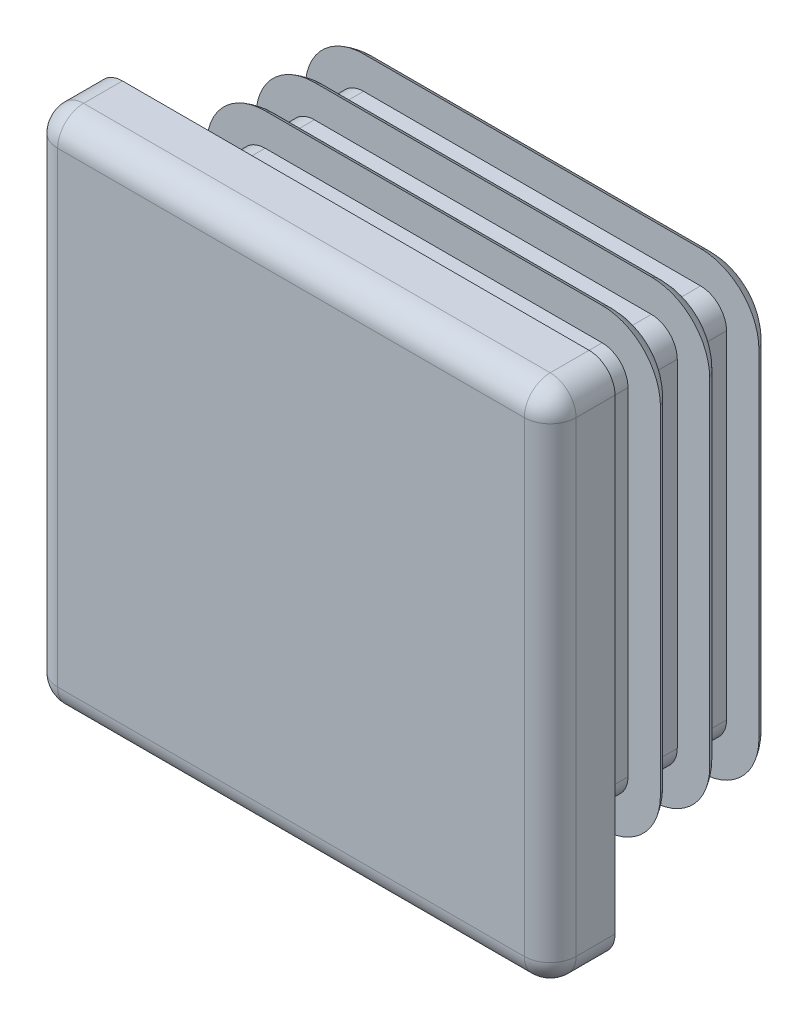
ISO-10303-21;
HEADER;
FILE_DESCRIPTION(('STEP AP214'),'2;1');
FILE_NAME('part.step','',(''),(''),'','','');
FILE_SCHEMA(('AUTOMOTIVE_DESIGN { 1 0 10303 214 1 1 1 1 }'));
ENDSEC;
DATA;
#1=APPLICATION_CONTEXT('core data for automotive mechanical design processes');
#2=APPLICATION_PROTOCOL_DEFINITION('international standard','automotive_design',2000,#1);
#3=PRODUCT_CONTEXT('',#1,'mechanical');
#4=PRODUCT('Part','Part','',(#3));
#5=PRODUCT_RELATED_PRODUCT_CATEGORY('part','',(#4));
#6=PRODUCT_DEFINITION_FORMATION('','',#4);
#7=PRODUCT_DEFINITION_CONTEXT('part definition',#1,'design');
#8=PRODUCT_DEFINITION('design','',#6,#7);
#9=PRODUCT_DEFINITION_SHAPE('','',#8);
#10=(LENGTH_UNIT() NAMED_UNIT(*) SI_UNIT(.MILLI.,.METRE.));
#11=(NAMED_UNIT(*) PLANE_ANGLE_UNIT() SI_UNIT($,.RADIAN.));
#12=(NAMED_UNIT(*) SI_UNIT($,.STERADIAN.) SOLID_ANGLE_UNIT());
#13=UNCERTAINTY_MEASURE_WITH_UNIT(LENGTH_MEASURE(1.E-05),#10,'distance_accuracy_value','');
#14=(GEOMETRIC_REPRESENTATION_CONTEXT(3) GLOBAL_UNCERTAINTY_ASSIGNED_CONTEXT((#13)) GLOBAL_UNIT_ASSIGNED_CONTEXT((#10,
#11,#12)) REPRESENTATION_CONTEXT('',''));
#15=CARTESIAN_POINT('',(0.,0.,0.));
#16=DIRECTION('',(0.,0.,1.));
#17=DIRECTION('',(1.,0.,0.));
#18=AXIS2_PLACEMENT_3D('',#15,#16,#17);
#19=CARTESIAN_POINT('',(-167.431578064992,2.00000000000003,5.));
#20=DIRECTION('',(0.,0.,1.));
#21=DIRECTION('',(1.,0.,0.));
#22=AXIS2_PLACEMENT_3D('',#19,#20,#21);
#23=PLANE('',#22);
#24=DIRECTION('',(-1.,0.,0.));
#25=VECTOR('',#24,1.);
#26=CARTESIAN_POINT('',(-167.431578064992,2.00000000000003,5.));
#27=LINE('',#26,#25);
#28=CARTESIAN_POINT('',(-131.431578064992,2.00000000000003,5.));
#29=VERTEX_POINT('',#28);
#30=CARTESIAN_POINT('',(-167.431578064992,2.00000000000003,5.));
#31=VERTEX_POINT('',#30);
#32=EDGE_CURVE('E636',#29,#31,#27,.T.);
#33=ORIENTED_EDGE('',*,*,#32,.F.);
#34=DIRECTION('',(0.,-1.,0.));
#35=VECTOR('',#34,1.);
#36=CARTESIAN_POINT('',(-131.431578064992,2.00000000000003,5.));
#37=LINE('',#36,#35);
#38=CARTESIAN_POINT('',(-131.431578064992,38.,5.));
#39=VERTEX_POINT('',#38);
#40=EDGE_CURVE('E652',#39,#29,#37,.T.);
#41=ORIENTED_EDGE('',*,*,#40,.F.);
#42=DIRECTION('',(1.,0.,0.));
#43=VECTOR('',#42,1.);
#44=CARTESIAN_POINT('',(-167.431578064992,38.,5.));
#45=LINE('',#44,#43);
#46=CARTESIAN_POINT('',(-167.431578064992,37.999999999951,5.));
#47=VERTEX_POINT('',#46);
#48=EDGE_CURVE('E597',#47,#39,#45,.T.);
#49=ORIENTED_EDGE('',*,*,#48,.F.);
#50=DIRECTION('',(0.,1.,0.));
#51=VECTOR('',#50,1.);
#52=CARTESIAN_POINT('',(-167.431578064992,2.00000000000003,5.));
#53=LINE('',#52,#51);
#54=EDGE_CURVE('E639',#31,#47,#53,.T.);
#55=ORIENTED_EDGE('',*,*,#54,.F.);
#56=EDGE_LOOP('',(#33,#41,#49,#55));
#57=FACE_BOUND('',#56,.T.);
#58=ADVANCED_FACE('F16',(#57),#23,.T.);
#59=CARTESIAN_POINT('',(-167.431578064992,2.00000000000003,3.));
#60=DIRECTION('',(-1.,0.,0.));
#61=DIRECTION('',(0.,0.,1.));
#62=AXIS2_PLACEMENT_3D('',#59,#60,#61);
#63=CYLINDRICAL_SURFACE('',#62,2.);
#64=CARTESIAN_POINT('',(-167.431578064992,2.00000000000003,3.));
#65=DIRECTION('',(1.,0.,0.));
#66=DIRECTION('',(0.,0.,-1.));
#67=AXIS2_PLACEMENT_3D('',#64,#65,#66);
#68=CIRCLE('',#67,2.);
#69=CARTESIAN_POINT('',(-167.431578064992,0.,3.));
#70=VERTEX_POINT('',#69);
#71=EDGE_CURVE('E642',#70,#31,#68,.F.);
#72=ORIENTED_EDGE('',*,*,#71,.F.);
#73=DIRECTION('',(1.,0.,0.));
#74=VECTOR('',#73,1.);
#75=CARTESIAN_POINT('',(-167.431578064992,0.,3.));
#76=LINE('',#75,#74);
#77=CARTESIAN_POINT('',(-131.431578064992,0.,3.));
#78=VERTEX_POINT('',#77);
#79=EDGE_CURVE('E2370',#70,#78,#76,.T.);
#80=ORIENTED_EDGE('',*,*,#79,.T.);
#81=CARTESIAN_POINT('',(-131.431578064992,2.00000000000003,3.));
#82=DIRECTION('',(1.,0.,0.));
#83=DIRECTION('',(0.,0.,-1.));
#84=AXIS2_PLACEMENT_3D('',#81,#82,#83);
#85=CIRCLE('',#84,2.);
#86=EDGE_CURVE('E633',#29,#78,#85,.T.);
#87=ORIENTED_EDGE('',*,*,#86,.F.);
#88=ORIENTED_EDGE('',*,*,#32,.T.);
#89=EDGE_LOOP('',(#72,#80,#87,#88));
#90=FACE_BOUND('',#89,.T.);
#91=ADVANCED_FACE('F626',(#90),#63,.T.);
#92=CARTESIAN_POINT('',(-131.431578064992,2.00000000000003,3.));
#93=DIRECTION('',(1.,0.,0.));
#94=DIRECTION('',(0.,0.,-1.));
#95=AXIS2_PLACEMENT_3D('',#92,#93,#94);
#96=SPHERICAL_SURFACE('',#95,2.);
#97=CARTESIAN_POINT('',(-131.431578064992,2.00000000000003,3.));
#98=DIRECTION('',(0.,-1.,0.));
#99=DIRECTION('',(0.,0.,-1.));
#100=AXIS2_PLACEMENT_3D('',#97,#98,#99);
#101=CIRCLE('',#100,2.);
#102=CARTESIAN_POINT('',(-129.431578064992,2.00000000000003,3.));
#103=VERTEX_POINT('',#102);
#104=EDGE_CURVE('E635',#29,#103,#101,.F.);
#105=ORIENTED_EDGE('',*,*,#104,.F.);
#106=ORIENTED_EDGE('',*,*,#86,.T.);
#107=CARTESIAN_POINT('',(-131.431578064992,2.00000000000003,3.));
#108=DIRECTION('',(0.,0.,-1.));
#109=DIRECTION('',(-1.,0.,0.));
#110=AXIS2_PLACEMENT_3D('',#107,#108,#109);
#111=CIRCLE('',#110,2.);
#112=EDGE_CURVE('E555',#103,#78,#111,.T.);
#113=ORIENTED_EDGE('',*,*,#112,.F.);
#114=EDGE_LOOP('',(#105,#106,#113));
#115=FACE_BOUND('',#114,.T.);
#116=ADVANCED_FACE('F622',(#115),#96,.T.);
#117=CARTESIAN_POINT('',(-131.431578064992,2.00000000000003,3.));
#118=DIRECTION('',(0.,-1.,0.));
#119=DIRECTION('',(0.,0.,-1.));
#120=AXIS2_PLACEMENT_3D('',#117,#118,#119);
#121=CYLINDRICAL_SURFACE('',#120,2.);
#122=CARTESIAN_POINT('',(-131.431578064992,38.,3.));
#123=DIRECTION('',(0.,-1.,0.));
#124=DIRECTION('',(1.,0.,0.));
#125=AXIS2_PLACEMENT_3D('',#122,#123,#124);
#126=CIRCLE('',#125,2.);
#127=CARTESIAN_POINT('',(-129.431578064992,38.,3.));
#128=VERTEX_POINT('',#127);
#129=EDGE_CURVE('E602',#39,#128,#126,.F.);
#130=ORIENTED_EDGE('',*,*,#129,.F.);
#131=ORIENTED_EDGE('',*,*,#40,.T.);
#132=ORIENTED_EDGE('',*,*,#104,.T.);
#133=DIRECTION('',(0.,1.,0.));
#134=VECTOR('',#133,1.);
#135=CARTESIAN_POINT('',(-129.431578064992,2.00000000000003,3.));
#136=LINE('',#135,#134);
#137=EDGE_CURVE('E487',#103,#128,#136,.T.);
#138=ORIENTED_EDGE('',*,*,#137,.T.);
#139=EDGE_LOOP('',(#130,#131,#132,#138));
#140=FACE_BOUND('',#139,.T.);
#141=ADVANCED_FACE('F618',(#140),#121,.T.);
#142=CARTESIAN_POINT('',(-131.431578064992,38.,3.));
#143=DIRECTION('',(1.,0.,0.));
#144=DIRECTION('',(0.,0.,-1.));
#145=AXIS2_PLACEMENT_3D('',#142,#143,#144);
#146=SPHERICAL_SURFACE('',#145,2.);
#147=CARTESIAN_POINT('',(-131.431578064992,38.,3.));
#148=DIRECTION('',(0.,0.,-1.));
#149=DIRECTION('',(-1.,0.,0.));
#150=AXIS2_PLACEMENT_3D('',#147,#148,#149);
#151=CIRCLE('',#150,2.);
#152=CARTESIAN_POINT('',(-131.431578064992,40.,3.));
#153=VERTEX_POINT('',#152);
#154=EDGE_CURVE('E549',#153,#128,#151,.T.);
#155=ORIENTED_EDGE('',*,*,#154,.F.);
#156=CARTESIAN_POINT('',(-131.431578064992,38.,3.));
#157=DIRECTION('',(1.,0.,0.));
#158=DIRECTION('',(0.,0.,-1.));
#159=AXIS2_PLACEMENT_3D('',#156,#157,#158);
#160=CIRCLE('',#159,2.);
#161=EDGE_CURVE('E600',#39,#153,#160,.F.);
#162=ORIENTED_EDGE('',*,*,#161,.F.);
#163=ORIENTED_EDGE('',*,*,#129,.T.);
#164=EDGE_LOOP('',(#155,#162,#163));
#165=FACE_BOUND('',#164,.T.);
#166=ADVANCED_FACE('F615',(#165),#146,.T.);
#167=CARTESIAN_POINT('',(-167.431578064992,38.,3.));
#168=DIRECTION('',(1.,0.,0.));
#169=DIRECTION('',(0.,0.,-1.));
#170=AXIS2_PLACEMENT_3D('',#167,#168,#169);
#171=CYLINDRICAL_SURFACE('',#170,2.);
#172=CARTESIAN_POINT('',(-167.431578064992,38.,3.));
#173=DIRECTION('',(1.,0.,0.));
#174=DIRECTION('',(0.,0.,-1.));
#175=AXIS2_PLACEMENT_3D('',#172,#173,#174);
#176=CIRCLE('',#175,2.);
#177=CARTESIAN_POINT('',(-167.431578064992,40.,3.));
#178=VERTEX_POINT('',#177);
#179=EDGE_CURVE('E594',#47,#178,#176,.F.);
#180=ORIENTED_EDGE('',*,*,#179,.F.);
#181=ORIENTED_EDGE('',*,*,#48,.T.);
#182=ORIENTED_EDGE('',*,*,#161,.T.);
#183=DIRECTION('',(1.,0.,0.));
#184=VECTOR('',#183,1.);
#185=CARTESIAN_POINT('',(-131.431578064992,40.,3.));
#186=LINE('',#185,#184);
#187=EDGE_CURVE('E544',#153,#178,#186,.F.);
#188=ORIENTED_EDGE('',*,*,#187,.T.);
#189=EDGE_LOOP('',(#180,#181,#182,#188));
#190=FACE_BOUND('',#189,.T.);
#191=ADVANCED_FACE('F586',(#190),#171,.T.);
#192=CARTESIAN_POINT('',(-167.431578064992,38.,3.));
#193=DIRECTION('',(1.,0.,0.));
#194=DIRECTION('',(0.,0.,-1.));
#195=AXIS2_PLACEMENT_3D('',#192,#193,#194);
#196=SPHERICAL_SURFACE('',#195,2.);
#197=CARTESIAN_POINT('',(-167.431578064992,38.,3.));
#198=DIRECTION('',(0.,0.,-1.));
#199=DIRECTION('',(-1.,0.,0.));
#200=AXIS2_PLACEMENT_3D('',#197,#198,#199);
#201=CIRCLE('',#200,2.);
#202=CARTESIAN_POINT('',(-169.431578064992,38.,3.));
#203=VERTEX_POINT('',#202);
#204=EDGE_CURVE('E538',#203,#178,#201,.T.);
#205=ORIENTED_EDGE('',*,*,#204,.F.);
#206=CARTESIAN_POINT('',(-167.431578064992,38.,3.));
#207=DIRECTION('',(0.,1.,0.));
#208=DIRECTION('',(-1.,0.,0.));
#209=AXIS2_PLACEMENT_3D('',#206,#207,#208);
#210=CIRCLE('',#209,2.);
#211=EDGE_CURVE('E596',#47,#203,#210,.F.);
#212=ORIENTED_EDGE('',*,*,#211,.F.);
#213=ORIENTED_EDGE('',*,*,#179,.T.);
#214=EDGE_LOOP('',(#205,#212,#213));
#215=FACE_BOUND('',#214,.T.);
#216=ADVANCED_FACE('F581',(#215),#196,.T.);
#217=CARTESIAN_POINT('',(-167.431578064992,2.00000000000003,3.));
#218=DIRECTION('',(0.,1.,0.));
#219=DIRECTION('',(-1.,0.,0.));
#220=AXIS2_PLACEMENT_3D('',#217,#218,#219);
#221=CYLINDRICAL_SURFACE('',#220,2.);
#222=CARTESIAN_POINT('',(-167.431578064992,2.00000000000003,3.));
#223=DIRECTION('',(0.,-1.,0.));
#224=DIRECTION('',(1.,0.,0.));
#225=AXIS2_PLACEMENT_3D('',#222,#223,#224);
#226=CIRCLE('',#225,2.);
#227=CARTESIAN_POINT('',(-169.431578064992,2.00000000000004,3.));
#228=VERTEX_POINT('',#227);
#229=EDGE_CURVE('E568',#31,#228,#226,.T.);
#230=ORIENTED_EDGE('',*,*,#229,.F.);
#231=ORIENTED_EDGE('',*,*,#54,.T.);
#232=ORIENTED_EDGE('',*,*,#211,.T.);
#233=DIRECTION('',(0.,1.,0.));
#234=VECTOR('',#233,1.);
#235=CARTESIAN_POINT('',(-169.431578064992,38.,3.));
#236=LINE('',#235,#234);
#237=EDGE_CURVE('E528',#203,#228,#236,.F.);
#238=ORIENTED_EDGE('',*,*,#237,.T.);
#239=EDGE_LOOP('',(#230,#231,#232,#238));
#240=FACE_BOUND('',#239,.T.);
#241=ADVANCED_FACE('F576',(#240),#221,.T.);
#242=CARTESIAN_POINT('',(-167.431578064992,2.00000000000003,3.));
#243=DIRECTION('',(1.,0.,0.));
#244=DIRECTION('',(0.,0.,-1.));
#245=AXIS2_PLACEMENT_3D('',#242,#243,#244);
#246=SPHERICAL_SURFACE('',#245,2.);
#247=ORIENTED_EDGE('',*,*,#71,.T.);
#248=ORIENTED_EDGE('',*,*,#229,.T.);
#249=CARTESIAN_POINT('',(-167.431578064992,2.00000000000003,3.));
#250=DIRECTION('',(0.,0.,-1.));
#251=DIRECTION('',(-1.,0.,0.));
#252=AXIS2_PLACEMENT_3D('',#249,#250,#251);
#253=CIRCLE('',#252,2.);
#254=EDGE_CURVE('E504',#70,#228,#253,.T.);
#255=ORIENTED_EDGE('',*,*,#254,.F.);
#256=EDGE_LOOP('',(#247,#248,#255));
#257=FACE_BOUND('',#256,.T.);
#258=ADVANCED_FACE('F571',(#257),#246,.T.);
#259=CARTESIAN_POINT('',(-167.431578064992,0.,5.));
#260=DIRECTION('',(0.,1.,0.));
#261=DIRECTION('',(0.,0.,1.));
#262=AXIS2_PLACEMENT_3D('',#259,#260,#261);
#263=PLANE('',#262);
#264=ORIENTED_EDGE('',*,*,#79,.F.);
#265=DIRECTION('',(0.,0.,-1.));
#266=VECTOR('',#265,1.);
#267=CARTESIAN_POINT('',(-167.431578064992,0.,5.));
#268=LINE('',#267,#266);
#269=CARTESIAN_POINT('',(-167.431578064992,0.,0.));
#270=VERTEX_POINT('',#269);
#271=EDGE_CURVE('E525',#270,#70,#268,.F.);
#272=ORIENTED_EDGE('',*,*,#271,.F.);
#273=DIRECTION('',(1.,0.,0.));
#274=VECTOR('',#273,1.);
#275=CARTESIAN_POINT('',(-167.431578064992,0.,0.));
#276=LINE('',#275,#274);
#277=CARTESIAN_POINT('',(-131.431578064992,0.,0.));
#278=VERTEX_POINT('',#277);
#279=EDGE_CURVE('E499',#270,#278,#276,.T.);
#280=ORIENTED_EDGE('',*,*,#279,.T.);
#281=DIRECTION('',(0.,0.,-1.));
#282=VECTOR('',#281,1.);
#283=CARTESIAN_POINT('',(-131.431578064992,0.,5.));
#284=LINE('',#283,#282);
#285=EDGE_CURVE('E474',#78,#278,#284,.T.);
#286=ORIENTED_EDGE('',*,*,#285,.F.);
#287=EDGE_LOOP('',(#264,#272,#280,#286));
#288=FACE_BOUND('',#287,.T.);
#289=ADVANCED_FACE('F575',(#288),#263,.F.);
#290=CARTESIAN_POINT('',(-131.431578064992,2.00000000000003,5.));
#291=DIRECTION('',(0.,0.,-1.));
#292=DIRECTION('',(-1.,0.,0.));
#293=AXIS2_PLACEMENT_3D('',#290,#291,#292);
#294=CYLINDRICAL_SURFACE('',#293,2.);
#295=ORIENTED_EDGE('',*,*,#285,.T.);
#296=CARTESIAN_POINT('',(-131.431578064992,2.00000000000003,0.));
#297=DIRECTION('',(0.,0.,-1.));
#298=DIRECTION('',(-1.,0.,0.));
#299=AXIS2_PLACEMENT_3D('',#296,#297,#298);
#300=CIRCLE('',#299,2.);
#301=CARTESIAN_POINT('',(-129.431578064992,2.00000000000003,0.));
#302=VERTEX_POINT('',#301);
#303=EDGE_CURVE('E19',#278,#302,#300,.F.);
#304=ORIENTED_EDGE('',*,*,#303,.T.);
#305=DIRECTION('',(0.,0.,1.));
#306=VECTOR('',#305,1.);
#307=CARTESIAN_POINT('',(-129.431578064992,2.00000000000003,5.));
#308=LINE('',#307,#306);
#309=EDGE_CURVE('E481',#302,#103,#308,.T.);
#310=ORIENTED_EDGE('',*,*,#309,.T.);
#311=ORIENTED_EDGE('',*,*,#112,.T.);
#312=EDGE_LOOP('',(#295,#304,#310,#311));
#313=FACE_BOUND('',#312,.T.);
#314=ADVANCED_FACE('F498',(#313),#294,.T.);
#315=CARTESIAN_POINT('',(-129.431578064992,2.00000000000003,5.));
#316=DIRECTION('',(-1.,0.,0.));
#317=DIRECTION('',(0.,0.,1.));
#318=AXIS2_PLACEMENT_3D('',#315,#316,#317);
#319=PLANE('',#318);
#320=ORIENTED_EDGE('',*,*,#137,.F.);
#321=ORIENTED_EDGE('',*,*,#309,.F.);
#322=DIRECTION('',(0.,1.,0.));
#323=VECTOR('',#322,1.);
#324=CARTESIAN_POINT('',(-129.431578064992,2.00000000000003,0.));
#325=LINE('',#324,#323);
#326=CARTESIAN_POINT('',(-129.431578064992,38.,0.));
#327=VERTEX_POINT('',#326);
#328=EDGE_CURVE('E485',#302,#327,#325,.T.);
#329=ORIENTED_EDGE('',*,*,#328,.T.);
#330=DIRECTION('',(0.,0.,-1.));
#331=VECTOR('',#330,1.);
#332=CARTESIAN_POINT('',(-129.431578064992,38.,5.));
#333=LINE('',#332,#331);
#334=EDGE_CURVE('E545',#128,#327,#333,.T.);
#335=ORIENTED_EDGE('',*,*,#334,.F.);
#336=EDGE_LOOP('',(#320,#321,#329,#335));
#337=FACE_BOUND('',#336,.T.);
#338=ADVANCED_FACE('F483',(#337),#319,.F.);
#339=CARTESIAN_POINT('',(-131.431578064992,38.,5.));
#340=DIRECTION('',(0.,0.,-1.));
#341=DIRECTION('',(-1.,0.,0.));
#342=AXIS2_PLACEMENT_3D('',#339,#340,#341);
#343=CYLINDRICAL_SURFACE('',#342,2.);
#344=ORIENTED_EDGE('',*,*,#334,.T.);
#345=CARTESIAN_POINT('',(-131.431578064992,38.,0.));
#346=DIRECTION('',(0.,0.,-1.));
#347=DIRECTION('',(-1.,0.,0.));
#348=AXIS2_PLACEMENT_3D('',#345,#346,#347);
#349=CIRCLE('',#348,2.);
#350=CARTESIAN_POINT('',(-131.431578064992,40.,0.));
#351=VERTEX_POINT('',#350);
#352=EDGE_CURVE('E496',#327,#351,#349,.F.);
#353=ORIENTED_EDGE('',*,*,#352,.T.);
#354=DIRECTION('',(0.,0.,-1.));
#355=VECTOR('',#354,1.);
#356=CARTESIAN_POINT('',(-131.431578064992,40.,5.));
#357=LINE('',#356,#355);
#358=EDGE_CURVE('E541',#351,#153,#357,.F.);
#359=ORIENTED_EDGE('',*,*,#358,.T.);
#360=ORIENTED_EDGE('',*,*,#154,.T.);
#361=EDGE_LOOP('',(#344,#353,#359,#360));
#362=FACE_BOUND('',#361,.T.);
#363=ADVANCED_FACE('F918',(#362),#343,.T.);
#364=CARTESIAN_POINT('',(-131.431578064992,40.,5.));
#365=DIRECTION('',(0.,-1.,0.));
#366=DIRECTION('',(0.,0.,-1.));
#367=AXIS2_PLACEMENT_3D('',#364,#365,#366);
#368=PLANE('',#367);
#369=ORIENTED_EDGE('',*,*,#187,.F.);
#370=ORIENTED_EDGE('',*,*,#358,.F.);
#371=DIRECTION('',(1.,0.,0.));
#372=VECTOR('',#371,1.);
#373=CARTESIAN_POINT('',(-167.431578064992,40.,0.));
#374=LINE('',#373,#372);
#375=CARTESIAN_POINT('',(-167.431578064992,40.,0.));
#376=VERTEX_POINT('',#375);
#377=EDGE_CURVE('E809',#351,#376,#374,.F.);
#378=ORIENTED_EDGE('',*,*,#377,.T.);
#379=DIRECTION('',(0.,0.,-1.));
#380=VECTOR('',#379,1.);
#381=CARTESIAN_POINT('',(-167.431578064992,40.,5.));
#382=LINE('',#381,#380);
#383=EDGE_CURVE('E534',#178,#376,#382,.T.);
#384=ORIENTED_EDGE('',*,*,#383,.F.);
#385=EDGE_LOOP('',(#369,#370,#378,#384));
#386=FACE_BOUND('',#385,.T.);
#387=ADVANCED_FACE('F914',(#386),#368,.F.);
#388=CARTESIAN_POINT('',(-167.431578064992,38.,5.));
#389=DIRECTION('',(0.,0.,-1.));
#390=DIRECTION('',(-1.,0.,0.));
#391=AXIS2_PLACEMENT_3D('',#388,#389,#390);
#392=CYLINDRICAL_SURFACE('',#391,2.);
#393=ORIENTED_EDGE('',*,*,#383,.T.);
#394=CARTESIAN_POINT('',(-167.431578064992,38.,0.));
#395=DIRECTION('',(0.,0.,-1.));
#396=DIRECTION('',(-1.,0.,0.));
#397=AXIS2_PLACEMENT_3D('',#394,#395,#396);
#398=CIRCLE('',#397,2.);
#399=CARTESIAN_POINT('',(-169.431578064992,38.,0.));
#400=VERTEX_POINT('',#399);
#401=EDGE_CURVE('E807',#376,#400,#398,.F.);
#402=ORIENTED_EDGE('',*,*,#401,.T.);
#403=DIRECTION('',(0.,0.,1.));
#404=VECTOR('',#403,1.);
#405=CARTESIAN_POINT('',(-169.431578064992,38.,5.));
#406=LINE('',#405,#404);
#407=EDGE_CURVE('E531',#400,#203,#406,.T.);
#408=ORIENTED_EDGE('',*,*,#407,.T.);
#409=ORIENTED_EDGE('',*,*,#204,.T.);
#410=EDGE_LOOP('',(#393,#402,#408,#409));
#411=FACE_BOUND('',#410,.T.);
#412=ADVANCED_FACE('F910',(#411),#392,.T.);
#413=CARTESIAN_POINT('',(-169.431578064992,38.,5.));
#414=DIRECTION('',(1.,0.,0.));
#415=DIRECTION('',(0.,1.,0.));
#416=AXIS2_PLACEMENT_3D('',#413,#414,#415);
#417=PLANE('',#416);
#418=ORIENTED_EDGE('',*,*,#237,.F.);
#419=ORIENTED_EDGE('',*,*,#407,.F.);
#420=DIRECTION('',(0.,1.,0.));
#421=VECTOR('',#420,1.);
#422=CARTESIAN_POINT('',(-169.431578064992,2.00000000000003,0.));
#423=LINE('',#422,#421);
#424=CARTESIAN_POINT('',(-169.431578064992,2.00000000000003,0.));
#425=VERTEX_POINT('',#424);
#426=EDGE_CURVE('E806',#400,#425,#423,.F.);
#427=ORIENTED_EDGE('',*,*,#426,.T.);
#428=DIRECTION('',(0.,0.,-1.));
#429=VECTOR('',#428,1.);
#430=CARTESIAN_POINT('',(-169.431578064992,2.00000000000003,5.));
#431=LINE('',#430,#429);
#432=EDGE_CURVE('E500',#228,#425,#431,.T.);
#433=ORIENTED_EDGE('',*,*,#432,.F.);
#434=EDGE_LOOP('',(#418,#419,#427,#433));
#435=FACE_BOUND('',#434,.T.);
#436=ADVANCED_FACE('F906',(#435),#417,.F.);
#437=CARTESIAN_POINT('',(-167.431578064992,2.00000000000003,5.));
#438=DIRECTION('',(0.,0.,-1.));
#439=DIRECTION('',(-1.,0.,0.));
#440=AXIS2_PLACEMENT_3D('',#437,#438,#439);
#441=CYLINDRICAL_SURFACE('',#440,2.);
#442=ORIENTED_EDGE('',*,*,#432,.T.);
#443=CARTESIAN_POINT('',(-167.431578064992,2.00000000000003,0.));
#444=DIRECTION('',(0.,0.,-1.));
#445=DIRECTION('',(-1.,0.,0.));
#446=AXIS2_PLACEMENT_3D('',#443,#444,#445);
#447=CIRCLE('',#446,2.);
#448=EDGE_CURVE('E803',#425,#270,#447,.F.);
#449=ORIENTED_EDGE('',*,*,#448,.T.);
#450=ORIENTED_EDGE('',*,*,#271,.T.);
#451=ORIENTED_EDGE('',*,*,#254,.T.);
#452=EDGE_LOOP('',(#442,#449,#450,#451));
#453=FACE_BOUND('',#452,.T.);
#454=ADVANCED_FACE('F902',(#453),#441,.T.);
#455=CARTESIAN_POINT('',(-167.431578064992,2.00000000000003,0.));
#456=DIRECTION('',(0.,0.,1.));
#457=DIRECTION('',(1.,0.,0.));
#458=AXIS2_PLACEMENT_3D('',#455,#456,#457);
#459=PLANE('',#458);
#460=CARTESIAN_POINT('',(-136.431578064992,7.00000000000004,0.));
#461=DIRECTION('',(0.,0.,1.));
#462=DIRECTION('',(1.,0.,0.));
#463=AXIS2_PLACEMENT_3D('',#460,#461,#462);
#464=CIRCLE('',#463,2.);
#465=CARTESIAN_POINT('',(-134.431578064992,7.00000000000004,0.));
#466=VERTEX_POINT('',#465);
#467=CARTESIAN_POINT('',(-136.431578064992,5.00000000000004,0.));
#468=VERTEX_POINT('',#467);
#469=EDGE_CURVE('E512',#466,#468,#464,.F.);
#470=ORIENTED_EDGE('',*,*,#469,.F.);
#471=DIRECTION('',(0.,1.,0.));
#472=VECTOR('',#471,1.);
#473=CARTESIAN_POINT('',(-134.431578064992,35.,0.));
#474=LINE('',#473,#472);
#475=CARTESIAN_POINT('',(-134.431578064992,33.,0.));
#476=VERTEX_POINT('',#475);
#477=EDGE_CURVE('E513',#466,#476,#474,.T.);
#478=ORIENTED_EDGE('',*,*,#477,.T.);
#479=CARTESIAN_POINT('',(-136.431578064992,33.,0.));
#480=DIRECTION('',(0.,0.,1.));
#481=DIRECTION('',(1.,0.,0.));
#482=AXIS2_PLACEMENT_3D('',#479,#480,#481);
#483=CIRCLE('',#482,2.);
#484=CARTESIAN_POINT('',(-136.431578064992,35.,0.));
#485=VERTEX_POINT('',#484);
#486=EDGE_CURVE('E517',#485,#476,#483,.F.);
#487=ORIENTED_EDGE('',*,*,#486,.F.);
#488=DIRECTION('',(1.,0.,0.));
#489=VECTOR('',#488,1.);
#490=CARTESIAN_POINT('',(-164.431578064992,35.,0.));
#491=LINE('',#490,#489);
#492=CARTESIAN_POINT('',(-162.431578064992,35.,0.));
#493=VERTEX_POINT('',#492);
#494=EDGE_CURVE('E518',#485,#493,#491,.F.);
#495=ORIENTED_EDGE('',*,*,#494,.T.);
#496=CARTESIAN_POINT('',(-162.431578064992,33.,0.));
#497=DIRECTION('',(0.,0.,1.));
#498=DIRECTION('',(1.,0.,0.));
#499=AXIS2_PLACEMENT_3D('',#496,#497,#498);
#500=CIRCLE('',#499,2.);
#501=CARTESIAN_POINT('',(-164.431578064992,33.,0.));
#502=VERTEX_POINT('',#501);
#503=EDGE_CURVE('E521',#502,#493,#500,.F.);
#504=ORIENTED_EDGE('',*,*,#503,.F.);
#505=DIRECTION('',(0.,1.,0.));
#506=VECTOR('',#505,1.);
#507=CARTESIAN_POINT('',(-164.431578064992,5.00000000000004,0.));
#508=LINE('',#507,#506);
#509=CARTESIAN_POINT('',(-164.431578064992,7.00000000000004,0.));
#510=VERTEX_POINT('',#509);
#511=EDGE_CURVE('E796',#502,#510,#508,.F.);
#512=ORIENTED_EDGE('',*,*,#511,.T.);
#513=CARTESIAN_POINT('',(-162.431578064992,7.00000000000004,0.));
#514=DIRECTION('',(0.,0.,1.));
#515=DIRECTION('',(1.,0.,0.));
#516=AXIS2_PLACEMENT_3D('',#513,#514,#515);
#517=CIRCLE('',#516,2.);
#518=CARTESIAN_POINT('',(-162.431578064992,5.00000000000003,0.));
#519=VERTEX_POINT('',#518);
#520=EDGE_CURVE('E794',#519,#510,#517,.F.);
#521=ORIENTED_EDGE('',*,*,#520,.F.);
#522=DIRECTION('',(1.,0.,0.));
#523=VECTOR('',#522,1.);
#524=CARTESIAN_POINT('',(-134.431578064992,5.00000000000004,0.));
#525=LINE('',#524,#523);
#526=EDGE_CURVE('E508',#519,#468,#525,.T.);
#527=ORIENTED_EDGE('',*,*,#526,.T.);
#528=EDGE_LOOP('',(#470,#478,#487,#495,#504,#512,#521,#527));
#529=FACE_BOUND('',#528,.T.);
#530=ORIENTED_EDGE('',*,*,#426,.F.);
#531=ORIENTED_EDGE('',*,*,#401,.F.);
#532=ORIENTED_EDGE('',*,*,#377,.F.);
#533=ORIENTED_EDGE('',*,*,#352,.F.);
#534=ORIENTED_EDGE('',*,*,#328,.F.);
#535=ORIENTED_EDGE('',*,*,#303,.F.);
#536=ORIENTED_EDGE('',*,*,#279,.F.);
#537=ORIENTED_EDGE('',*,*,#448,.F.);
#538=EDGE_LOOP('',(#530,#531,#532,#533,#534,#535,#536,#537));
#539=FACE_BOUND('',#538,.T.);
#540=ADVANCED_FACE('F492',(#529,#539),#459,.F.);
#541=CARTESIAN_POINT('',(-162.431578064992,33.,-15.));
#542=DIRECTION('',(0.,0.,1.));
#543=DIRECTION('',(1.,0.,0.));
#544=AXIS2_PLACEMENT_3D('',#541,#542,#543);
#545=CYLINDRICAL_SURFACE('',#544,2.);
#546=ORIENTED_EDGE('',*,*,#503,.T.);
#547=DIRECTION('',(0.,0.,-1.));
#548=VECTOR('',#547,1.);
#549=CARTESIAN_POINT('',(-162.431578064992,35.,-15.));
#550=LINE('',#549,#548);
#551=CARTESIAN_POINT('',(-162.431578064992,35.,-2.20406681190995));
#552=VERTEX_POINT('',#551);
#553=EDGE_CURVE('E520',#493,#552,#550,.T.);
#554=ORIENTED_EDGE('',*,*,#553,.T.);
#555=CARTESIAN_POINT('',(-162.431578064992,33.,-2.20406681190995));
#556=DIRECTION('',(0.,0.,1.));
#557=DIRECTION('',(1.,0.,0.));
#558=AXIS2_PLACEMENT_3D('',#555,#556,#557);
#559=CIRCLE('',#558,2.);
#560=CARTESIAN_POINT('',(-164.431578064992,33.,-2.20406681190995));
#561=VERTEX_POINT('',#560);
#562=EDGE_CURVE('E791',#561,#552,#559,.F.);
#563=ORIENTED_EDGE('',*,*,#562,.F.);
#564=DIRECTION('',(0.,0.,1.));
#565=VECTOR('',#564,1.);
#566=CARTESIAN_POINT('',(-164.431578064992,33.,-15.));
#567=LINE('',#566,#565);
#568=EDGE_CURVE('E793',#561,#502,#567,.T.);
#569=ORIENTED_EDGE('',*,*,#568,.T.);
#570=EDGE_LOOP('',(#546,#554,#563,#569));
#571=FACE_BOUND('',#570,.T.);
#572=ADVANCED_FACE('F895',(#571),#545,.T.);
#573=CARTESIAN_POINT('',(-164.431578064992,35.,-15.));
#574=DIRECTION('',(0.,-1.,0.));
#575=DIRECTION('',(0.,0.,-1.));
#576=AXIS2_PLACEMENT_3D('',#573,#574,#575);
#577=PLANE('',#576);
#578=DIRECTION('',(1.,0.,0.));
#579=VECTOR('',#578,1.);
#580=CARTESIAN_POINT('',(-162.431578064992,35.,-2.20406681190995));
#581=LINE('',#580,#579);
#582=CARTESIAN_POINT('',(-136.431578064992,35.,-2.20406681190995));
#583=VERTEX_POINT('',#582);
#584=EDGE_CURVE('E790',#552,#583,#581,.T.);
#585=ORIENTED_EDGE('',*,*,#584,.F.);
#586=ORIENTED_EDGE('',*,*,#553,.F.);
#587=ORIENTED_EDGE('',*,*,#494,.F.);
#588=DIRECTION('',(0.,0.,1.));
#589=VECTOR('',#588,1.);
#590=CARTESIAN_POINT('',(-136.431578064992,35.,-15.));
#591=LINE('',#590,#589);
#592=EDGE_CURVE('E801',#583,#485,#591,.T.);
#593=ORIENTED_EDGE('',*,*,#592,.F.);
#594=EDGE_LOOP('',(#585,#586,#587,#593));
#595=FACE_BOUND('',#594,.T.);
#596=ADVANCED_FACE('F891',(#595),#577,.F.);
#597=CARTESIAN_POINT('',(-136.431578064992,33.,-15.));
#598=DIRECTION('',(0.,0.,1.));
#599=DIRECTION('',(1.,0.,0.));
#600=AXIS2_PLACEMENT_3D('',#597,#598,#599);
#601=CYLINDRICAL_SURFACE('',#600,2.);
#602=ORIENTED_EDGE('',*,*,#486,.T.);
#603=DIRECTION('',(0.,0.,1.));
#604=VECTOR('',#603,1.);
#605=CARTESIAN_POINT('',(-134.431578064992,33.,-15.));
#606=LINE('',#605,#604);
#607=CARTESIAN_POINT('',(-134.431578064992,33.,-2.20406681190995));
#608=VERTEX_POINT('',#607);
#609=EDGE_CURVE('E516',#476,#608,#606,.F.);
#610=ORIENTED_EDGE('',*,*,#609,.T.);
#611=CARTESIAN_POINT('',(-136.431578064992,33.,-2.20406681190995));
#612=DIRECTION('',(0.,0.,1.));
#613=DIRECTION('',(1.,0.,0.));
#614=AXIS2_PLACEMENT_3D('',#611,#612,#613);
#615=CIRCLE('',#614,2.);
#616=EDGE_CURVE('E788',#583,#608,#615,.F.);
#617=ORIENTED_EDGE('',*,*,#616,.F.);
#618=ORIENTED_EDGE('',*,*,#592,.T.);
#619=EDGE_LOOP('',(#602,#610,#617,#618));
#620=FACE_BOUND('',#619,.T.);
#621=ADVANCED_FACE('F887',(#620),#601,.T.);
#622=CARTESIAN_POINT('',(-134.431578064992,35.,-15.));
#623=DIRECTION('',(-1.,0.,0.));
#624=DIRECTION('',(0.,0.,1.));
#625=AXIS2_PLACEMENT_3D('',#622,#623,#624);
#626=PLANE('',#625);
#627=DIRECTION('',(0.,1.,0.));
#628=VECTOR('',#627,1.);
#629=CARTESIAN_POINT('',(-134.431578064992,35.,-2.20406681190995));
#630=LINE('',#629,#628);
#631=CARTESIAN_POINT('',(-134.431578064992,7.00000000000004,-2.20406681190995));
#632=VERTEX_POINT('',#631);
#633=EDGE_CURVE('E787',#608,#632,#630,.F.);
#634=ORIENTED_EDGE('',*,*,#633,.F.);
#635=ORIENTED_EDGE('',*,*,#609,.F.);
#636=ORIENTED_EDGE('',*,*,#477,.F.);
#637=DIRECTION('',(0.,0.,1.));
#638=VECTOR('',#637,1.);
#639=CARTESIAN_POINT('',(-134.431578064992,7.00000000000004,-15.));
#640=LINE('',#639,#638);
#641=EDGE_CURVE('E799',#632,#466,#640,.T.);
#642=ORIENTED_EDGE('',*,*,#641,.F.);
#643=EDGE_LOOP('',(#634,#635,#636,#642));
#644=FACE_BOUND('',#643,.T.);
#645=ADVANCED_FACE('F883',(#644),#626,.F.);
#646=CARTESIAN_POINT('',(-136.431578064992,7.00000000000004,-15.));
#647=DIRECTION('',(0.,0.,1.));
#648=DIRECTION('',(1.,0.,0.));
#649=AXIS2_PLACEMENT_3D('',#646,#647,#648);
#650=CYLINDRICAL_SURFACE('',#649,2.);
#651=ORIENTED_EDGE('',*,*,#469,.T.);
#652=DIRECTION('',(0.,0.,1.));
#653=VECTOR('',#652,1.);
#654=CARTESIAN_POINT('',(-136.431578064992,5.00000000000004,-15.));
#655=LINE('',#654,#653);
#656=CARTESIAN_POINT('',(-136.431578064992,5.00000000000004,-2.20406681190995));
#657=VERTEX_POINT('',#656);
#658=EDGE_CURVE('E511',#468,#657,#655,.F.);
#659=ORIENTED_EDGE('',*,*,#658,.T.);
#660=CARTESIAN_POINT('',(-136.431578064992,7.00000000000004,-2.20406681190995));
#661=DIRECTION('',(0.,0.,1.));
#662=DIRECTION('',(1.,0.,0.));
#663=AXIS2_PLACEMENT_3D('',#660,#661,#662);
#664=CIRCLE('',#663,2.);
#665=EDGE_CURVE('E785',#632,#657,#664,.F.);
#666=ORIENTED_EDGE('',*,*,#665,.F.);
#667=ORIENTED_EDGE('',*,*,#641,.T.);
#668=EDGE_LOOP('',(#651,#659,#666,#667));
#669=FACE_BOUND('',#668,.T.);
#670=ADVANCED_FACE('F879',(#669),#650,.T.);
#671=CARTESIAN_POINT('',(-134.431578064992,5.00000000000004,-15.));
#672=DIRECTION('',(0.,1.,0.));
#673=DIRECTION('',(0.,0.,1.));
#674=AXIS2_PLACEMENT_3D('',#671,#672,#673);
#675=PLANE('',#674);
#676=DIRECTION('',(1.,0.,0.));
#677=VECTOR('',#676,1.);
#678=CARTESIAN_POINT('',(-162.431578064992,5.00000000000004,-2.20406681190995));
#679=LINE('',#678,#677);
#680=CARTESIAN_POINT('',(-162.431578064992,5.00000000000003,-2.20406681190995));
#681=VERTEX_POINT('',#680);
#682=EDGE_CURVE('E784',#657,#681,#679,.F.);
#683=ORIENTED_EDGE('',*,*,#682,.F.);
#684=ORIENTED_EDGE('',*,*,#658,.F.);
#685=ORIENTED_EDGE('',*,*,#526,.F.);
#686=DIRECTION('',(0.,0.,1.));
#687=VECTOR('',#686,1.);
#688=CARTESIAN_POINT('',(-162.431578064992,5.00000000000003,-15.));
#689=LINE('',#688,#687);
#690=EDGE_CURVE('E797',#681,#519,#689,.T.);
#691=ORIENTED_EDGE('',*,*,#690,.F.);
#692=EDGE_LOOP('',(#683,#684,#685,#691));
#693=FACE_BOUND('',#692,.T.);
#694=ADVANCED_FACE('F875',(#693),#675,.F.);
#695=CARTESIAN_POINT('',(-162.431578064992,7.00000000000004,-15.));
#696=DIRECTION('',(0.,0.,1.));
#697=DIRECTION('',(1.,0.,0.));
#698=AXIS2_PLACEMENT_3D('',#695,#696,#697);
#699=CYLINDRICAL_SURFACE('',#698,2.);
#700=ORIENTED_EDGE('',*,*,#520,.T.);
#701=DIRECTION('',(0.,0.,1.));
#702=VECTOR('',#701,1.);
#703=CARTESIAN_POINT('',(-164.431578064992,7.00000000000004,-15.));
#704=LINE('',#703,#702);
#705=CARTESIAN_POINT('',(-164.431578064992,7.00000000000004,-2.20406681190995));
#706=VERTEX_POINT('',#705);
#707=EDGE_CURVE('E819',#510,#706,#704,.F.);
#708=ORIENTED_EDGE('',*,*,#707,.T.);
#709=CARTESIAN_POINT('',(-162.431578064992,7.00000000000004,-2.20406681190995));
#710=DIRECTION('',(0.,0.,1.));
#711=DIRECTION('',(1.,0.,0.));
#712=AXIS2_PLACEMENT_3D('',#709,#710,#711);
#713=CIRCLE('',#712,2.);
#714=EDGE_CURVE('E782',#681,#706,#713,.F.);
#715=ORIENTED_EDGE('',*,*,#714,.F.);
#716=ORIENTED_EDGE('',*,*,#690,.T.);
#717=EDGE_LOOP('',(#700,#708,#715,#716));
#718=FACE_BOUND('',#717,.T.);
#719=ADVANCED_FACE('F871',(#718),#699,.T.);
#720=CARTESIAN_POINT('',(-164.431578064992,5.00000000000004,-15.));
#721=DIRECTION('',(1.,0.,0.));
#722=DIRECTION('',(0.,1.,0.));
#723=AXIS2_PLACEMENT_3D('',#720,#721,#722);
#724=PLANE('',#723);
#725=DIRECTION('',(0.,1.,0.));
#726=VECTOR('',#725,1.);
#727=CARTESIAN_POINT('',(-164.431578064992,35.,-2.20406681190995));
#728=LINE('',#727,#726);
#729=EDGE_CURVE('E781',#706,#561,#728,.T.);
#730=ORIENTED_EDGE('',*,*,#729,.F.);
#731=ORIENTED_EDGE('',*,*,#707,.F.);
#732=ORIENTED_EDGE('',*,*,#511,.F.);
#733=ORIENTED_EDGE('',*,*,#568,.F.);
#734=EDGE_LOOP('',(#730,#731,#732,#733));
#735=FACE_BOUND('',#734,.T.);
#736=ADVANCED_FACE('F867',(#735),#724,.F.);
#737=CARTESIAN_POINT('',(-162.431578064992,35.,-2.20406681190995));
#738=DIRECTION('',(0.,0.,1.));
#739=DIRECTION('',(1.,0.,0.));
#740=AXIS2_PLACEMENT_3D('',#737,#738,#739);
#741=PLANE('',#740);
#742=DIRECTION('',(0.,1.,0.));
#743=VECTOR('',#742,1.);
#744=CARTESIAN_POINT('',(-131.931578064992,7.00000000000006,-2.20406681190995));
#745=LINE('',#744,#743);
#746=CARTESIAN_POINT('',(-131.931578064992,33.,-2.20406681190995));
#747=VERTEX_POINT('',#746);
#748=CARTESIAN_POINT('',(-131.931578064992,7.00000000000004,-2.20406681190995));
#749=VERTEX_POINT('',#748);
#750=EDGE_CURVE('E838',#747,#749,#745,.F.);
#751=ORIENTED_EDGE('',*,*,#750,.F.);
#752=CARTESIAN_POINT('',(-136.431578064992,33.,-2.20406681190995));
#753=DIRECTION('',(0.,0.,1.));
#754=DIRECTION('',(1.,0.,0.));
#755=AXIS2_PLACEMENT_3D('',#752,#753,#754);
#756=CIRCLE('',#755,4.49999999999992);
#757=CARTESIAN_POINT('',(-136.431578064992,37.5,-2.20406681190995));
#758=VERTEX_POINT('',#757);
#759=EDGE_CURVE('E774',#758,#747,#756,.F.);
#760=ORIENTED_EDGE('',*,*,#759,.F.);
#761=DIRECTION('',(1.,0.,0.));
#762=VECTOR('',#761,1.);
#763=CARTESIAN_POINT('',(-162.431578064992,37.5,-2.20406681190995));
#764=LINE('',#763,#762);
#765=CARTESIAN_POINT('',(-162.431578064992,37.5,-2.20406681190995));
#766=VERTEX_POINT('',#765);
#767=EDGE_CURVE('E780',#766,#758,#764,.T.);
#768=ORIENTED_EDGE('',*,*,#767,.F.);
#769=CARTESIAN_POINT('',(-162.431578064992,33.,-2.20406681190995));
#770=DIRECTION('',(0.,0.,1.));
#771=DIRECTION('',(1.,0.,0.));
#772=AXIS2_PLACEMENT_3D('',#769,#770,#771);
#773=CIRCLE('',#772,4.49999999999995);
#774=CARTESIAN_POINT('',(-166.931578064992,33.,-2.20406681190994));
#775=VERTEX_POINT('',#774);
#776=EDGE_CURVE('E778',#775,#766,#773,.F.);
#777=ORIENTED_EDGE('',*,*,#776,.F.);
#778=DIRECTION('',(0.,-1.,0.));
#779=VECTOR('',#778,1.);
#780=CARTESIAN_POINT('',(-166.931578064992,33.,-2.20406681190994));
#781=LINE('',#780,#779);
#782=CARTESIAN_POINT('',(-166.931578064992,7.00000000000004,-2.20406681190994));
#783=VERTEX_POINT('',#782);
#784=EDGE_CURVE('E842',#783,#775,#781,.F.);
#785=ORIENTED_EDGE('',*,*,#784,.F.);
#786=CARTESIAN_POINT('',(-162.431578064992,7.00000000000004,-2.20406681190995));
#787=DIRECTION('',(0.,0.,1.));
#788=DIRECTION('',(1.,0.,0.));
#789=AXIS2_PLACEMENT_3D('',#786,#787,#788);
#790=CIRCLE('',#789,4.49999999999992);
#791=CARTESIAN_POINT('',(-162.431578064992,2.50000000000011,-2.20406681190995));
#792=VERTEX_POINT('',#791);
#793=EDGE_CURVE('E766',#792,#783,#790,.F.);
#794=ORIENTED_EDGE('',*,*,#793,.F.);
#795=DIRECTION('',(1.,0.,0.));
#796=VECTOR('',#795,1.);
#797=CARTESIAN_POINT('',(-162.431578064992,2.50000000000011,-2.20406681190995));
#798=LINE('',#797,#796);
#799=CARTESIAN_POINT('',(-136.431578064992,2.50000000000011,-2.20406681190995));
#800=VERTEX_POINT('',#799);
#801=EDGE_CURVE('E840',#800,#792,#798,.F.);
#802=ORIENTED_EDGE('',*,*,#801,.F.);
#803=CARTESIAN_POINT('',(-136.431578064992,7.00000000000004,-2.20406681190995));
#804=DIRECTION('',(0.,0.,1.));
#805=DIRECTION('',(1.,0.,0.));
#806=AXIS2_PLACEMENT_3D('',#803,#804,#805);
#807=CIRCLE('',#806,4.49999999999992);
#808=EDGE_CURVE('E770',#749,#800,#807,.F.);
#809=ORIENTED_EDGE('',*,*,#808,.F.);
#810=EDGE_LOOP('',(#751,#760,#768,#777,#785,#794,#802,#809));
#811=FACE_BOUND('',#810,.T.);
#812=ORIENTED_EDGE('',*,*,#714,.T.);
#813=ORIENTED_EDGE('',*,*,#729,.T.);
#814=ORIENTED_EDGE('',*,*,#562,.T.);
#815=ORIENTED_EDGE('',*,*,#584,.T.);
#816=ORIENTED_EDGE('',*,*,#616,.T.);
#817=ORIENTED_EDGE('',*,*,#633,.T.);
#818=ORIENTED_EDGE('',*,*,#665,.T.);
#819=ORIENTED_EDGE('',*,*,#682,.T.);
#820=EDGE_LOOP('',(#812,#813,#814,#815,#816,#817,#818,#819));
#821=FACE_BOUND('',#820,.T.);
#822=ADVANCED_FACE('F862',(#811,#821),#741,.T.);
#823=CARTESIAN_POINT('',(-160.622164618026,33.,-0.713647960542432));
#824=DIRECTION('',(0.,1.,0.));
#825=DIRECTION('',(1.,0.,0.));
#826=AXIS2_PLACEMENT_3D('',#823,#824,#825);
#827=CIRCLE('',#826,3.07580954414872);
#828=TRIMMED_CURVE('',#827,(PARAMETER_VALUE(-2.19971696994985)),
(PARAMETER_VALUE(2.19971696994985)),.T.,.PARAMETER.);
#829=CARTESIAN_POINT('',(-162.431578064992,33.,-0.713647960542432));
#830=DIRECTION('',(0.,0.,1.));
#831=AXIS1_PLACEMENT('',#829,#830);
#832=SURFACE_OF_REVOLUTION('',#828,#831);
#833=CARTESIAN_POINT('',(-164.240991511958,33.,-0.713647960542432));
#834=DIRECTION('',(0.,-1.,0.));
#835=DIRECTION('',(1.,0.,0.));
#836=AXIS2_PLACEMENT_3D('',#833,#834,#835);
#837=CIRCLE('',#836,3.07580954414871);
#838=CARTESIAN_POINT('',(-164.431578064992,33.,-3.78354716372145));
#839=VERTEX_POINT('',#838);
#840=EDGE_CURVE('E768',#775,#839,#837,.T.);
#841=ORIENTED_EDGE('',*,*,#840,.F.);
#842=ORIENTED_EDGE('',*,*,#776,.T.);
#843=CARTESIAN_POINT('',(-162.431578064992,34.8094134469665,-0.713647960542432));
#844=DIRECTION('',(1.,0.,0.));
#845=DIRECTION('',(0.,0.,-1.));
#846=AXIS2_PLACEMENT_3D('',#843,#844,#845);
#847=CIRCLE('',#846,3.07580954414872);
#848=CARTESIAN_POINT('',(-162.431578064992,35.,-3.78354716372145));
#849=VERTEX_POINT('',#848);
#850=EDGE_CURVE('E837',#849,#766,#847,.T.);
#851=ORIENTED_EDGE('',*,*,#850,.F.);
#852=CARTESIAN_POINT('',(-162.431578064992,33.,-3.78354716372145));
#853=DIRECTION('',(0.,0.,1.));
#854=DIRECTION('',(1.,0.,0.));
#855=AXIS2_PLACEMENT_3D('',#852,#853,#854);
#856=CIRCLE('',#855,2.);
#857=EDGE_CURVE('E845',#839,#849,#856,.F.);
#858=ORIENTED_EDGE('',*,*,#857,.F.);
#859=EDGE_LOOP('',(#841,#842,#851,#858));
#860=FACE_BOUND('',#859,.T.);
#861=ADVANCED_FACE('F857',(#860),#832,.F.);
#862=CARTESIAN_POINT('',(-162.431578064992,34.8094134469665,-0.713647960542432));
#863=DIRECTION('',(1.,0.,0.));
#864=DIRECTION('',(0.,0.,-1.));
#865=AXIS2_PLACEMENT_3D('',#862,#863,#864);
#866=CYLINDRICAL_SURFACE('',#865,3.07580954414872);
#867=DIRECTION('',(1.,0.,0.));
#868=VECTOR('',#867,1.);
#869=CARTESIAN_POINT('',(-164.431578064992,35.,-3.78354716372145));
#870=LINE('',#869,#868);
#871=CARTESIAN_POINT('',(-136.431578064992,35.,-3.78354716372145));
#872=VERTEX_POINT('',#871);
#873=EDGE_CURVE('E1407',#872,#849,#870,.F.);
#874=ORIENTED_EDGE('',*,*,#873,.T.);
#875=ORIENTED_EDGE('',*,*,#850,.T.);
#876=ORIENTED_EDGE('',*,*,#767,.T.);
#877=CARTESIAN_POINT('',(-136.431578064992,34.8094134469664,-0.713647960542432));
#878=DIRECTION('',(-1.,0.,0.));
#879=DIRECTION('',(0.,1.,0.));
#880=AXIS2_PLACEMENT_3D('',#877,#878,#879);
#881=CIRCLE('',#880,3.07580954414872);
#882=EDGE_CURVE('E777',#872,#758,#881,.F.);
#883=ORIENTED_EDGE('',*,*,#882,.F.);
#884=EDGE_LOOP('',(#874,#875,#876,#883));
#885=FACE_BOUND('',#884,.T.);
#886=ADVANCED_FACE('F861',(#885),#866,.T.);
#887=CARTESIAN_POINT('',(-134.622164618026,33.,-0.713647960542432));
#888=DIRECTION('',(0.,1.,0.));
#889=DIRECTION('',(1.,0.,0.));
#890=AXIS2_PLACEMENT_3D('',#887,#888,#889);
#891=CIRCLE('',#890,3.07580954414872);
#892=TRIMMED_CURVE('',#891,(PARAMETER_VALUE(-2.19971696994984)),
(PARAMETER_VALUE(2.19971696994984)),.T.,.PARAMETER.);
#893=CARTESIAN_POINT('',(-136.431578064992,33.,-0.713647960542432));
#894=DIRECTION('',(0.,0.,1.));
#895=AXIS1_PLACEMENT('',#893,#894);
#896=SURFACE_OF_REVOLUTION('',#892,#895);
#897=ORIENTED_EDGE('',*,*,#882,.T.);
#898=ORIENTED_EDGE('',*,*,#759,.T.);
#899=CARTESIAN_POINT('',(-134.622164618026,33.,-0.713647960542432));
#900=DIRECTION('',(0.,1.,0.));
#901=DIRECTION('',(0.,0.,1.));
#902=AXIS2_PLACEMENT_3D('',#899,#900,#901);
#903=CIRCLE('',#902,3.07580954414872);
#904=CARTESIAN_POINT('',(-134.431578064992,33.,-3.78354716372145));
#905=VERTEX_POINT('',#904);
#906=EDGE_CURVE('E776',#905,#747,#903,.F.);
#907=ORIENTED_EDGE('',*,*,#906,.F.);
#908=CARTESIAN_POINT('',(-136.431578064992,33.,-3.78354716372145));
#909=DIRECTION('',(0.,0.,1.));
#910=DIRECTION('',(1.,0.,0.));
#911=AXIS2_PLACEMENT_3D('',#908,#909,#910);
#912=CIRCLE('',#911,2.);
#913=EDGE_CURVE('E1435',#872,#905,#912,.F.);
#914=ORIENTED_EDGE('',*,*,#913,.F.);
#915=EDGE_LOOP('',(#897,#898,#907,#914));
#916=FACE_BOUND('',#915,.T.);
#917=ADVANCED_FACE('F1393',(#916),#896,.F.);
#918=CARTESIAN_POINT('',(-134.622164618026,7.00000000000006,-0.713647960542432));
#919=DIRECTION('',(0.,1.,0.));
#920=DIRECTION('',(0.,0.,1.));
#921=AXIS2_PLACEMENT_3D('',#918,#919,#920);
#922=CYLINDRICAL_SURFACE('',#921,3.07580954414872);
#923=ORIENTED_EDGE('',*,*,#906,.T.);
#924=ORIENTED_EDGE('',*,*,#750,.T.);
#925=CARTESIAN_POINT('',(-134.622164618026,7.00000000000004,-0.713647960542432));
#926=DIRECTION('',(0.,1.,0.));
#927=DIRECTION('',(1.,0.,0.));
#928=AXIS2_PLACEMENT_3D('',#925,#926,#927);
#929=CIRCLE('',#928,3.07580954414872);
#930=CARTESIAN_POINT('',(-134.431578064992,7.00000000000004,-3.78354716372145));
#931=VERTEX_POINT('',#930);
#932=EDGE_CURVE('E773',#931,#749,#929,.F.);
#933=ORIENTED_EDGE('',*,*,#932,.F.);
#934=DIRECTION('',(0.,1.,0.));
#935=VECTOR('',#934,1.);
#936=CARTESIAN_POINT('',(-134.431578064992,35.,-3.78354716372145));
#937=LINE('',#936,#935);
#938=EDGE_CURVE('E1431',#931,#905,#937,.T.);
#939=ORIENTED_EDGE('',*,*,#938,.T.);
#940=EDGE_LOOP('',(#923,#924,#933,#939));
#941=FACE_BOUND('',#940,.T.);
#942=ADVANCED_FACE('F1390',(#941),#922,.T.);
#943=CARTESIAN_POINT('',(-134.622164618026,7.00000000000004,-0.713647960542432));
#944=DIRECTION('',(0.,1.,0.));
#945=DIRECTION('',(1.,0.,0.));
#946=AXIS2_PLACEMENT_3D('',#943,#944,#945);
#947=CIRCLE('',#946,3.07580954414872);
#948=TRIMMED_CURVE('',#947,(PARAMETER_VALUE(-2.19971696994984)),
(PARAMETER_VALUE(2.19971696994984)),.T.,.PARAMETER.);
#949=CARTESIAN_POINT('',(-136.431578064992,7.00000000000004,-0.713647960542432));
#950=DIRECTION('',(0.,0.,1.));
#951=AXIS1_PLACEMENT('',#949,#950);
#952=SURFACE_OF_REVOLUTION('',#948,#951);
#953=ORIENTED_EDGE('',*,*,#932,.T.);
#954=ORIENTED_EDGE('',*,*,#808,.T.);
#955=CARTESIAN_POINT('',(-136.431578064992,5.19058655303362,-0.713647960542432));
#956=DIRECTION('',(1.,0.,0.));
#957=DIRECTION('',(0.,1.,0.));
#958=AXIS2_PLACEMENT_3D('',#955,#956,#957);
#959=CIRCLE('',#958,3.07580954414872);
#960=CARTESIAN_POINT('',(-136.431578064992,5.00000000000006,-3.78354716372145));
#961=VERTEX_POINT('',#960);
#962=EDGE_CURVE('E772',#961,#800,#959,.F.);
#963=ORIENTED_EDGE('',*,*,#962,.F.);
#964=CARTESIAN_POINT('',(-136.431578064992,7.00000000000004,-3.78354716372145));
#965=DIRECTION('',(0.,0.,1.));
#966=DIRECTION('',(1.,0.,0.));
#967=AXIS2_PLACEMENT_3D('',#964,#965,#966);
#968=CIRCLE('',#967,2.);
#969=EDGE_CURVE('E1373',#931,#961,#968,.F.);
#970=ORIENTED_EDGE('',*,*,#969,.F.);
#971=EDGE_LOOP('',(#953,#954,#963,#970));
#972=FACE_BOUND('',#971,.T.);
#973=ADVANCED_FACE('F1387',(#972),#952,.F.);
#974=CARTESIAN_POINT('',(-162.431578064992,5.19058655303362,-0.713647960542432));
#975=DIRECTION('',(1.,0.,0.));
#976=DIRECTION('',(0.,1.,0.));
#977=AXIS2_PLACEMENT_3D('',#974,#975,#976);
#978=CYLINDRICAL_SURFACE('',#977,3.07580954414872);
#979=ORIENTED_EDGE('',*,*,#962,.T.);
#980=ORIENTED_EDGE('',*,*,#801,.T.);
#981=CARTESIAN_POINT('',(-162.431578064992,5.19058655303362,-0.713647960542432));
#982=DIRECTION('',(1.,0.,0.));
#983=DIRECTION('',(0.,-1.,0.));
#984=AXIS2_PLACEMENT_3D('',#981,#982,#983);
#985=CIRCLE('',#984,3.07580954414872);
#986=CARTESIAN_POINT('',(-162.431578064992,5.00000000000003,-3.78354716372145));
#987=VERTEX_POINT('',#986);
#988=EDGE_CURVE('E769',#987,#792,#985,.F.);
#989=ORIENTED_EDGE('',*,*,#988,.F.);
#990=DIRECTION('',(1.,0.,0.));
#991=VECTOR('',#990,1.);
#992=CARTESIAN_POINT('',(-134.431578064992,5.00000000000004,-3.78354716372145));
#993=LINE('',#992,#991);
#994=EDGE_CURVE('E1369',#987,#961,#993,.T.);
#995=ORIENTED_EDGE('',*,*,#994,.T.);
#996=EDGE_LOOP('',(#979,#980,#989,#995));
#997=FACE_BOUND('',#996,.T.);
#998=ADVANCED_FACE('F1357',(#997),#978,.T.);
#999=CARTESIAN_POINT('',(-160.622164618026,7.00000000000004,-0.713647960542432));
#1000=DIRECTION('',(0.,1.,0.));
#1001=DIRECTION('',(1.,0.,0.));
#1002=AXIS2_PLACEMENT_3D('',#999,#1000,#1001);
#1003=CIRCLE('',#1002,3.07580954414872);
#1004=TRIMMED_CURVE('',#1003,(PARAMETER_VALUE(-2.19971696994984)),
(PARAMETER_VALUE(2.19971696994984)),.T.,.PARAMETER.);
#1005=CARTESIAN_POINT('',(-162.431578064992,7.00000000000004,-0.713647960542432));
#1006=DIRECTION('',(0.,0.,1.));
#1007=AXIS1_PLACEMENT('',#1005,#1006);
#1008=SURFACE_OF_REVOLUTION('',#1004,#1007);
#1009=ORIENTED_EDGE('',*,*,#988,.T.);
#1010=ORIENTED_EDGE('',*,*,#793,.T.);
#1011=CARTESIAN_POINT('',(-164.240991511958,7.00000000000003,-0.713647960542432));
#1012=DIRECTION('',(0.,-1.,0.));
#1013=DIRECTION('',(1.,0.,0.));
#1014=AXIS2_PLACEMENT_3D('',#1011,#1012,#1013);
#1015=CIRCLE('',#1014,3.07580954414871);
#1016=CARTESIAN_POINT('',(-164.431578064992,7.00000000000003,-3.78354716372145));
#1017=VERTEX_POINT('',#1016);
#1018=EDGE_CURVE('E846',#1017,#783,#1015,.F.);
#1019=ORIENTED_EDGE('',*,*,#1018,.F.);
#1020=CARTESIAN_POINT('',(-162.431578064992,7.00000000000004,-3.78354716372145));
#1021=DIRECTION('',(0.,0.,1.));
#1022=DIRECTION('',(1.,0.,0.));
#1023=AXIS2_PLACEMENT_3D('',#1020,#1021,#1022);
#1024=CIRCLE('',#1023,2.);
#1025=EDGE_CURVE('E1468',#987,#1017,#1024,.F.);
#1026=ORIENTED_EDGE('',*,*,#1025,.F.);
#1027=EDGE_LOOP('',(#1009,#1010,#1019,#1026));
#1028=FACE_BOUND('',#1027,.T.);
#1029=ADVANCED_FACE('F1352',(#1028),#1008,.F.);
#1030=CARTESIAN_POINT('',(-164.240991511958,33.,-0.713647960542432));
#1031=DIRECTION('',(0.,-1.,0.));
#1032=DIRECTION('',(1.,0.,0.));
#1033=AXIS2_PLACEMENT_3D('',#1030,#1031,#1032);
#1034=CYLINDRICAL_SURFACE('',#1033,3.07580954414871);
#1035=ORIENTED_EDGE('',*,*,#1018,.T.);
#1036=ORIENTED_EDGE('',*,*,#784,.T.);
#1037=ORIENTED_EDGE('',*,*,#840,.T.);
#1038=DIRECTION('',(0.,1.,0.));
#1039=VECTOR('',#1038,1.);
#1040=CARTESIAN_POINT('',(-164.431578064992,5.00000000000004,-3.78354716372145));
#1041=LINE('',#1040,#1039);
#1042=EDGE_CURVE('E1464',#839,#1017,#1041,.F.);
#1043=ORIENTED_EDGE('',*,*,#1042,.T.);
#1044=EDGE_LOOP('',(#1035,#1036,#1037,#1043));
#1045=FACE_BOUND('',#1044,.T.);
#1046=ADVANCED_FACE('F1348',(#1045),#1034,.T.);
#1047=CARTESIAN_POINT('',(-162.431578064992,33.,-15.));
#1048=DIRECTION('',(0.,0.,1.));
#1049=DIRECTION('',(1.,0.,0.));
#1050=AXIS2_PLACEMENT_3D('',#1047,#1048,#1049);
#1051=CYLINDRICAL_SURFACE('',#1050,2.);
#1052=ORIENTED_EDGE('',*,*,#857,.T.);
#1053=DIRECTION('',(0.,0.,-1.));
#1054=VECTOR('',#1053,1.);
#1055=CARTESIAN_POINT('',(-162.431578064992,35.,-15.));
#1056=LINE('',#1055,#1054);
#1057=CARTESIAN_POINT('',(-162.431578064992,35.,-6.00406681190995));
#1058=VERTEX_POINT('',#1057);
#1059=EDGE_CURVE('E1410',#849,#1058,#1056,.T.);
#1060=ORIENTED_EDGE('',*,*,#1059,.T.);
#1061=CARTESIAN_POINT('',(-162.431578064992,33.,-6.00406681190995));
#1062=DIRECTION('',(0.,0.,1.));
#1063=DIRECTION('',(1.,0.,0.));
#1064=AXIS2_PLACEMENT_3D('',#1061,#1062,#1063);
#1065=CIRCLE('',#1064,2.);
#1066=CARTESIAN_POINT('',(-164.431578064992,33.,-6.00406681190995));
#1067=VERTEX_POINT('',#1066);
#1068=EDGE_CURVE('E763',#1067,#1058,#1065,.F.);
#1069=ORIENTED_EDGE('',*,*,#1068,.F.);
#1070=DIRECTION('',(0.,0.,1.));
#1071=VECTOR('',#1070,1.);
#1072=CARTESIAN_POINT('',(-164.431578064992,33.,-15.));
#1073=LINE('',#1072,#1071);
#1074=EDGE_CURVE('E765',#1067,#839,#1073,.T.);
#1075=ORIENTED_EDGE('',*,*,#1074,.T.);
#1076=EDGE_LOOP('',(#1052,#1060,#1069,#1075));
#1077=FACE_BOUND('',#1076,.T.);
#1078=ADVANCED_FACE('F1344',(#1077),#1051,.T.);
#1079=CARTESIAN_POINT('',(-164.431578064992,35.,-15.));
#1080=DIRECTION('',(0.,-1.,0.));
#1081=DIRECTION('',(0.,0.,-1.));
#1082=AXIS2_PLACEMENT_3D('',#1079,#1080,#1081);
#1083=PLANE('',#1082);
#1084=DIRECTION('',(1.,0.,0.));
#1085=VECTOR('',#1084,1.);
#1086=CARTESIAN_POINT('',(-162.431578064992,35.,-6.00406681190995));
#1087=LINE('',#1086,#1085);
#1088=CARTESIAN_POINT('',(-136.431578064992,35.,-6.00406681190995));
#1089=VERTEX_POINT('',#1088);
#1090=EDGE_CURVE('E762',#1058,#1089,#1087,.T.);
#1091=ORIENTED_EDGE('',*,*,#1090,.F.);
#1092=ORIENTED_EDGE('',*,*,#1059,.F.);
#1093=ORIENTED_EDGE('',*,*,#873,.F.);
#1094=DIRECTION('',(0.,0.,1.));
#1095=VECTOR('',#1094,1.);
#1096=CARTESIAN_POINT('',(-136.431578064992,35.,-15.));
#1097=LINE('',#1096,#1095);
#1098=EDGE_CURVE('E1437',#1089,#872,#1097,.T.);
#1099=ORIENTED_EDGE('',*,*,#1098,.F.);
#1100=EDGE_LOOP('',(#1091,#1092,#1093,#1099));
#1101=FACE_BOUND('',#1100,.T.);
#1102=ADVANCED_FACE('F1340',(#1101),#1083,.F.);
#1103=CARTESIAN_POINT('',(-136.431578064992,33.,-15.));
#1104=DIRECTION('',(0.,0.,1.));
#1105=DIRECTION('',(1.,0.,0.));
#1106=AXIS2_PLACEMENT_3D('',#1103,#1104,#1105);
#1107=CYLINDRICAL_SURFACE('',#1106,2.);
#1108=ORIENTED_EDGE('',*,*,#913,.T.);
#1109=DIRECTION('',(0.,0.,1.));
#1110=VECTOR('',#1109,1.);
#1111=CARTESIAN_POINT('',(-134.431578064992,33.,-15.));
#1112=LINE('',#1111,#1110);
#1113=CARTESIAN_POINT('',(-134.431578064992,33.,-6.00406681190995));
#1114=VERTEX_POINT('',#1113);
#1115=EDGE_CURVE('E1440',#905,#1114,#1112,.F.);
#1116=ORIENTED_EDGE('',*,*,#1115,.T.);
#1117=CARTESIAN_POINT('',(-136.431578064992,33.,-6.00406681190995));
#1118=DIRECTION('',(0.,0.,1.));
#1119=DIRECTION('',(1.,0.,0.));
#1120=AXIS2_PLACEMENT_3D('',#1117,#1118,#1119);
#1121=CIRCLE('',#1120,2.);
#1122=EDGE_CURVE('E760',#1089,#1114,#1121,.F.);
#1123=ORIENTED_EDGE('',*,*,#1122,.F.);
#1124=ORIENTED_EDGE('',*,*,#1098,.T.);
#1125=EDGE_LOOP('',(#1108,#1116,#1123,#1124));
#1126=FACE_BOUND('',#1125,.T.);
#1127=ADVANCED_FACE('F1336',(#1126),#1107,.T.);
#1128=CARTESIAN_POINT('',(-134.431578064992,35.,-15.));
#1129=DIRECTION('',(-1.,0.,0.));
#1130=DIRECTION('',(0.,0.,1.));
#1131=AXIS2_PLACEMENT_3D('',#1128,#1129,#1130);
#1132=PLANE('',#1131);
#1133=DIRECTION('',(0.,1.,0.));
#1134=VECTOR('',#1133,1.);
#1135=CARTESIAN_POINT('',(-134.431578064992,35.,-6.00406681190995));
#1136=LINE('',#1135,#1134);
#1137=CARTESIAN_POINT('',(-134.431578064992,7.00000000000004,-6.00406681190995));
#1138=VERTEX_POINT('',#1137);
#1139=EDGE_CURVE('E759',#1114,#1138,#1136,.F.);
#1140=ORIENTED_EDGE('',*,*,#1139,.F.);
#1141=ORIENTED_EDGE('',*,*,#1115,.F.);
#1142=ORIENTED_EDGE('',*,*,#938,.F.);
#1143=DIRECTION('',(0.,0.,1.));
#1144=VECTOR('',#1143,1.);
#1145=CARTESIAN_POINT('',(-134.431578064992,7.00000000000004,-15.));
#1146=LINE('',#1145,#1144);
#1147=EDGE_CURVE('E1377',#1138,#931,#1146,.T.);
#1148=ORIENTED_EDGE('',*,*,#1147,.F.);
#1149=EDGE_LOOP('',(#1140,#1141,#1142,#1148));
#1150=FACE_BOUND('',#1149,.T.);
#1151=ADVANCED_FACE('F1332',(#1150),#1132,.F.);
#1152=CARTESIAN_POINT('',(-136.431578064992,7.00000000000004,-15.));
#1153=DIRECTION('',(0.,0.,1.));
#1154=DIRECTION('',(1.,0.,0.));
#1155=AXIS2_PLACEMENT_3D('',#1152,#1153,#1154);
#1156=CYLINDRICAL_SURFACE('',#1155,2.);
#1157=ORIENTED_EDGE('',*,*,#969,.T.);
#1158=DIRECTION('',(0.,0.,1.));
#1159=VECTOR('',#1158,1.);
#1160=CARTESIAN_POINT('',(-136.431578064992,5.00000000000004,-15.));
#1161=LINE('',#1160,#1159);
#1162=CARTESIAN_POINT('',(-136.431578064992,5.00000000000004,-6.00406681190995));
#1163=VERTEX_POINT('',#1162);
#1164=EDGE_CURVE('E1372',#961,#1163,#1161,.F.);
#1165=ORIENTED_EDGE('',*,*,#1164,.T.);
#1166=CARTESIAN_POINT('',(-136.431578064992,7.00000000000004,-6.00406681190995));
#1167=DIRECTION('',(0.,0.,1.));
#1168=DIRECTION('',(1.,0.,0.));
#1169=AXIS2_PLACEMENT_3D('',#1166,#1167,#1168);
#1170=CIRCLE('',#1169,2.);
#1171=EDGE_CURVE('E757',#1138,#1163,#1170,.F.);
#1172=ORIENTED_EDGE('',*,*,#1171,.F.);
#1173=ORIENTED_EDGE('',*,*,#1147,.T.);
#1174=EDGE_LOOP('',(#1157,#1165,#1172,#1173));
#1175=FACE_BOUND('',#1174,.T.);
#1176=ADVANCED_FACE('F1328',(#1175),#1156,.T.);
#1177=CARTESIAN_POINT('',(-134.431578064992,5.00000000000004,-15.));
#1178=DIRECTION('',(0.,1.,0.));
#1179=DIRECTION('',(0.,0.,1.));
#1180=AXIS2_PLACEMENT_3D('',#1177,#1178,#1179);
#1181=PLANE('',#1180);
#1182=DIRECTION('',(1.,0.,0.));
#1183=VECTOR('',#1182,1.);
#1184=CARTESIAN_POINT('',(-162.431578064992,5.00000000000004,-6.00406681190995));
#1185=LINE('',#1184,#1183);
#1186=CARTESIAN_POINT('',(-162.431578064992,5.00000000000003,-6.00406681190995));
#1187=VERTEX_POINT('',#1186);
#1188=EDGE_CURVE('E756',#1163,#1187,#1185,.F.);
#1189=ORIENTED_EDGE('',*,*,#1188,.F.);
#1190=ORIENTED_EDGE('',*,*,#1164,.F.);
#1191=ORIENTED_EDGE('',*,*,#994,.F.);
#1192=DIRECTION('',(0.,0.,1.));
#1193=VECTOR('',#1192,1.);
#1194=CARTESIAN_POINT('',(-162.431578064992,5.00000000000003,-15.));
#1195=LINE('',#1194,#1193);
#1196=EDGE_CURVE('E1472',#1187,#987,#1195,.T.);
#1197=ORIENTED_EDGE('',*,*,#1196,.F.);
#1198=EDGE_LOOP('',(#1189,#1190,#1191,#1197));
#1199=FACE_BOUND('',#1198,.T.);
#1200=ADVANCED_FACE('F1324',(#1199),#1181,.F.);
#1201=CARTESIAN_POINT('',(-162.431578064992,7.00000000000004,-15.));
#1202=DIRECTION('',(0.,0.,1.));
#1203=DIRECTION('',(1.,0.,0.));
#1204=AXIS2_PLACEMENT_3D('',#1201,#1202,#1203);
#1205=CYLINDRICAL_SURFACE('',#1204,2.);
#1206=ORIENTED_EDGE('',*,*,#1025,.T.);
#1207=DIRECTION('',(0.,0.,1.));
#1208=VECTOR('',#1207,1.);
#1209=CARTESIAN_POINT('',(-164.431578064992,7.00000000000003,-15.));
#1210=LINE('',#1209,#1208);
#1211=CARTESIAN_POINT('',(-164.431578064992,7.00000000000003,-6.00406681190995));
#1212=VERTEX_POINT('',#1211);
#1213=EDGE_CURVE('E1467',#1017,#1212,#1210,.F.);
#1214=ORIENTED_EDGE('',*,*,#1213,.T.);
#1215=CARTESIAN_POINT('',(-162.431578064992,7.00000000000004,-6.00406681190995));
#1216=DIRECTION('',(0.,0.,1.));
#1217=DIRECTION('',(1.,0.,0.));
#1218=AXIS2_PLACEMENT_3D('',#1215,#1216,#1217);
#1219=CIRCLE('',#1218,2.);
#1220=EDGE_CURVE('E754',#1187,#1212,#1219,.F.);
#1221=ORIENTED_EDGE('',*,*,#1220,.F.);
#1222=ORIENTED_EDGE('',*,*,#1196,.T.);
#1223=EDGE_LOOP('',(#1206,#1214,#1221,#1222));
#1224=FACE_BOUND('',#1223,.T.);
#1225=ADVANCED_FACE('F1320',(#1224),#1205,.T.);
#1226=CARTESIAN_POINT('',(-164.431578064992,5.00000000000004,-15.));
#1227=DIRECTION('',(1.,0.,0.));
#1228=DIRECTION('',(0.,1.,0.));
#1229=AXIS2_PLACEMENT_3D('',#1226,#1227,#1228);
#1230=PLANE('',#1229);
#1231=DIRECTION('',(0.,1.,0.));
#1232=VECTOR('',#1231,1.);
#1233=CARTESIAN_POINT('',(-164.431578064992,35.,-6.00406681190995));
#1234=LINE('',#1233,#1232);
#1235=EDGE_CURVE('E753',#1212,#1067,#1234,.T.);
#1236=ORIENTED_EDGE('',*,*,#1235,.F.);
#1237=ORIENTED_EDGE('',*,*,#1213,.F.);
#1238=ORIENTED_EDGE('',*,*,#1042,.F.);
#1239=ORIENTED_EDGE('',*,*,#1074,.F.);
#1240=EDGE_LOOP('',(#1236,#1237,#1238,#1239));
#1241=FACE_BOUND('',#1240,.T.);
#1242=ADVANCED_FACE('F1316',(#1241),#1230,.F.);
#1243=CARTESIAN_POINT('',(-162.431578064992,35.,-6.00406681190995));
#1244=DIRECTION('',(0.,0.,1.));
#1245=DIRECTION('',(1.,0.,0.));
#1246=AXIS2_PLACEMENT_3D('',#1243,#1244,#1245);
#1247=PLANE('',#1246);
#1248=DIRECTION('',(0.,1.,0.));
#1249=VECTOR('',#1248,1.);
#1250=CARTESIAN_POINT('',(-131.931578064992,7.00000000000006,-6.00406681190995));
#1251=LINE('',#1250,#1249);
#1252=CARTESIAN_POINT('',(-131.931578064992,33.,-6.00406681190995));
#1253=VERTEX_POINT('',#1252);
#1254=CARTESIAN_POINT('',(-131.931578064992,7.00000000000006,-6.00406681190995));
#1255=VERTEX_POINT('',#1254);
#1256=EDGE_CURVE('E1511',#1253,#1255,#1251,.F.);
#1257=ORIENTED_EDGE('',*,*,#1256,.F.);
#1258=CARTESIAN_POINT('',(-136.431578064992,33.0000000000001,-6.00406681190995));
#1259=DIRECTION('',(0.,0.,1.));
#1260=DIRECTION('',(1.,0.,0.));
#1261=AXIS2_PLACEMENT_3D('',#1258,#1259,#1260);
#1262=CIRCLE('',#1261,4.49999999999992);
#1263=CARTESIAN_POINT('',(-136.431578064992,37.5,-6.00406681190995));
#1264=VERTEX_POINT('',#1263);
#1265=EDGE_CURVE('E746',#1264,#1253,#1262,.F.);
#1266=ORIENTED_EDGE('',*,*,#1265,.F.);
#1267=DIRECTION('',(1.,0.,0.));
#1268=VECTOR('',#1267,1.);
#1269=CARTESIAN_POINT('',(-162.431578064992,37.5,-6.00406681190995));
#1270=LINE('',#1269,#1268);
#1271=CARTESIAN_POINT('',(-162.431578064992,37.5,-6.00406681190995));
#1272=VERTEX_POINT('',#1271);
#1273=EDGE_CURVE('E752',#1272,#1264,#1270,.T.);
#1274=ORIENTED_EDGE('',*,*,#1273,.F.);
#1275=CARTESIAN_POINT('',(-162.431578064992,33.0000000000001,-6.00406681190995));
#1276=DIRECTION('',(0.,0.,1.));
#1277=DIRECTION('',(1.,0.,0.));
#1278=AXIS2_PLACEMENT_3D('',#1275,#1276,#1277);
#1279=CIRCLE('',#1278,4.49999999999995);
#1280=CARTESIAN_POINT('',(-166.931578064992,33.0000000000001,-6.00406681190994));
#1281=VERTEX_POINT('',#1280);
#1282=EDGE_CURVE('E750',#1281,#1272,#1279,.F.);
#1283=ORIENTED_EDGE('',*,*,#1282,.F.);
#1284=DIRECTION('',(0.,-1.,0.));
#1285=VECTOR('',#1284,1.);
#1286=CARTESIAN_POINT('',(-166.931578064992,33.0000000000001,-6.00406681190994));
#1287=LINE('',#1286,#1285);
#1288=CARTESIAN_POINT('',(-166.931578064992,7.00000000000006,-6.00406681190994));
#1289=VERTEX_POINT('',#1288);
#1290=EDGE_CURVE('E1514',#1289,#1281,#1287,.F.);
#1291=ORIENTED_EDGE('',*,*,#1290,.F.);
#1292=CARTESIAN_POINT('',(-162.431578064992,7.00000000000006,-6.00406681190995));
#1293=DIRECTION('',(0.,0.,1.));
#1294=DIRECTION('',(1.,0.,0.));
#1295=AXIS2_PLACEMENT_3D('',#1292,#1293,#1294);
#1296=CIRCLE('',#1295,4.49999999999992);
#1297=CARTESIAN_POINT('',(-162.431578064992,2.50000000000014,-6.00406681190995));
#1298=VERTEX_POINT('',#1297);
#1299=EDGE_CURVE('E738',#1298,#1289,#1296,.F.);
#1300=ORIENTED_EDGE('',*,*,#1299,.F.);
#1301=DIRECTION('',(1.,0.,0.));
#1302=VECTOR('',#1301,1.);
#1303=CARTESIAN_POINT('',(-162.431578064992,2.50000000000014,-6.00406681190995));
#1304=LINE('',#1303,#1302);
#1305=CARTESIAN_POINT('',(-136.431578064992,2.50000000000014,-6.00406681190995));
#1306=VERTEX_POINT('',#1305);
#1307=EDGE_CURVE('E1251',#1306,#1298,#1304,.F.);
#1308=ORIENTED_EDGE('',*,*,#1307,.F.);
#1309=CARTESIAN_POINT('',(-136.431578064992,7.00000000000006,-6.00406681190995));
#1310=DIRECTION('',(0.,0.,1.));
#1311=DIRECTION('',(1.,0.,0.));
#1312=AXIS2_PLACEMENT_3D('',#1309,#1310,#1311);
#1313=CIRCLE('',#1312,4.49999999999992);
#1314=EDGE_CURVE('E742',#1255,#1306,#1313,.F.);
#1315=ORIENTED_EDGE('',*,*,#1314,.F.);
#1316=EDGE_LOOP('',(#1257,#1266,#1274,#1283,#1291,#1300,#1308,#1315));
#1317=FACE_BOUND('',#1316,.T.);
#1318=ORIENTED_EDGE('',*,*,#1220,.T.);
#1319=ORIENTED_EDGE('',*,*,#1235,.T.);
#1320=ORIENTED_EDGE('',*,*,#1068,.T.);
#1321=ORIENTED_EDGE('',*,*,#1090,.T.);
#1322=ORIENTED_EDGE('',*,*,#1122,.T.);
#1323=ORIENTED_EDGE('',*,*,#1139,.T.);
#1324=ORIENTED_EDGE('',*,*,#1171,.T.);
#1325=ORIENTED_EDGE('',*,*,#1188,.T.);
#1326=EDGE_LOOP('',(#1318,#1319,#1320,#1321,#1322,#1323,#1324,#1325));
#1327=FACE_BOUND('',#1326,.T.);
#1328=ADVANCED_FACE('F1312',(#1317,#1327),#1247,.T.);
#1329=CARTESIAN_POINT('',(-160.622164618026,33.0000000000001,-4.51364796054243));
#1330=DIRECTION('',(0.,1.,0.));
#1331=DIRECTION('',(1.,0.,0.));
#1332=AXIS2_PLACEMENT_3D('',#1329,#1330,#1331);
#1333=CIRCLE('',#1332,3.07580954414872);
#1334=TRIMMED_CURVE('',#1333,(PARAMETER_VALUE(-2.19971696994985)),
(PARAMETER_VALUE(2.19971696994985)),.T.,.PARAMETER.);
#1335=CARTESIAN_POINT('',(-162.431578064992,33.0000000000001,-4.51364796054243));
#1336=DIRECTION('',(0.,0.,1.));
#1337=AXIS1_PLACEMENT('',#1335,#1336);
#1338=SURFACE_OF_REVOLUTION('',#1334,#1337);
#1339=CARTESIAN_POINT('',(-164.240991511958,33.0000000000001,-4.51364796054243));
#1340=DIRECTION('',(0.,-1.,0.));
#1341=DIRECTION('',(1.,0.,0.));
#1342=AXIS2_PLACEMENT_3D('',#1339,#1340,#1341);
#1343=CIRCLE('',#1342,3.07580954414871);
#1344=CARTESIAN_POINT('',(-164.431578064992,33.0000000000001,-7.58354716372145));
#1345=VERTEX_POINT('',#1344);
#1346=EDGE_CURVE('E740',#1281,#1345,#1343,.T.);
#1347=ORIENTED_EDGE('',*,*,#1346,.F.);
#1348=ORIENTED_EDGE('',*,*,#1282,.T.);
#1349=CARTESIAN_POINT('',(-162.431578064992,34.8094134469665,-4.51364796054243));
#1350=DIRECTION('',(1.,0.,0.));
#1351=DIRECTION('',(0.,0.,-1.));
#1352=AXIS2_PLACEMENT_3D('',#1349,#1350,#1351);
#1353=CIRCLE('',#1352,3.07580954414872);
#1354=CARTESIAN_POINT('',(-162.431578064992,35.,-7.58354716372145));
#1355=VERTEX_POINT('',#1354);
#1356=EDGE_CURVE('E1292',#1355,#1272,#1353,.T.);
#1357=ORIENTED_EDGE('',*,*,#1356,.F.);
#1358=CARTESIAN_POINT('',(-162.431578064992,33.,-7.58354716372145));
#1359=DIRECTION('',(0.,0.,1.));
#1360=DIRECTION('',(1.,0.,0.));
#1361=AXIS2_PLACEMENT_3D('',#1358,#1359,#1360);
#1362=CIRCLE('',#1361,2.);
#1363=EDGE_CURVE('E1299',#1345,#1355,#1362,.F.);
#1364=ORIENTED_EDGE('',*,*,#1363,.F.);
#1365=EDGE_LOOP('',(#1347,#1348,#1357,#1364));
#1366=FACE_BOUND('',#1365,.T.);
#1367=ADVANCED_FACE('F1309',(#1366),#1338,.F.);
#1368=CARTESIAN_POINT('',(-162.431578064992,34.8094134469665,-4.51364796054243));
#1369=DIRECTION('',(1.,0.,0.));
#1370=DIRECTION('',(0.,0.,-1.));
#1371=AXIS2_PLACEMENT_3D('',#1368,#1369,#1370);
#1372=CYLINDRICAL_SURFACE('',#1371,3.07580954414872);
#1373=DIRECTION('',(1.,0.,0.));
#1374=VECTOR('',#1373,1.);
#1375=CARTESIAN_POINT('',(-164.431578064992,35.,-7.58354716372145));
#1376=LINE('',#1375,#1374);
#1377=CARTESIAN_POINT('',(-136.431578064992,35.,-7.58354716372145));
#1378=VERTEX_POINT('',#1377);
#1379=EDGE_CURVE('E1295',#1378,#1355,#1376,.F.);
#1380=ORIENTED_EDGE('',*,*,#1379,.T.);
#1381=ORIENTED_EDGE('',*,*,#1356,.T.);
#1382=ORIENTED_EDGE('',*,*,#1273,.T.);
#1383=CARTESIAN_POINT('',(-136.431578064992,34.8094134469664,-4.51364796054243));
#1384=DIRECTION('',(-1.,0.,0.));
#1385=DIRECTION('',(0.,1.,0.));
#1386=AXIS2_PLACEMENT_3D('',#1383,#1384,#1385);
#1387=CIRCLE('',#1386,3.07580954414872);
#1388=EDGE_CURVE('E749',#1378,#1264,#1387,.F.);
#1389=ORIENTED_EDGE('',*,*,#1388,.F.);
#1390=EDGE_LOOP('',(#1380,#1381,#1382,#1389));
#1391=FACE_BOUND('',#1390,.T.);
#1392=ADVANCED_FACE('F1283',(#1391),#1372,.T.);
#1393=CARTESIAN_POINT('',(-134.622164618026,33.0000000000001,-4.51364796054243));
#1394=DIRECTION('',(0.,1.,0.));
#1395=DIRECTION('',(1.,0.,0.));
#1396=AXIS2_PLACEMENT_3D('',#1393,#1394,#1395);
#1397=CIRCLE('',#1396,3.07580954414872);
#1398=TRIMMED_CURVE('',#1397,(PARAMETER_VALUE(-2.19971696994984)),
(PARAMETER_VALUE(2.19971696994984)),.T.,.PARAMETER.);
#1399=CARTESIAN_POINT('',(-136.431578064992,33.0000000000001,-4.51364796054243));
#1400=DIRECTION('',(0.,0.,1.));
#1401=AXIS1_PLACEMENT('',#1399,#1400);
#1402=SURFACE_OF_REVOLUTION('',#1398,#1401);
#1403=ORIENTED_EDGE('',*,*,#1388,.T.);
#1404=ORIENTED_EDGE('',*,*,#1265,.T.);
#1405=CARTESIAN_POINT('',(-134.622164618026,33.,-4.51364796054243));
#1406=DIRECTION('',(0.,1.,0.));
#1407=DIRECTION('',(0.,0.,1.));
#1408=AXIS2_PLACEMENT_3D('',#1405,#1406,#1407);
#1409=CIRCLE('',#1408,3.07580954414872);
#1410=CARTESIAN_POINT('',(-134.431578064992,33.,-7.58354716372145));
#1411=VERTEX_POINT('',#1410);
#1412=EDGE_CURVE('E748',#1411,#1253,#1409,.F.);
#1413=ORIENTED_EDGE('',*,*,#1412,.F.);
#1414=CARTESIAN_POINT('',(-136.431578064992,33.,-7.58354716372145));
#1415=DIRECTION('',(0.,0.,1.));
#1416=DIRECTION('',(1.,0.,0.));
#1417=AXIS2_PLACEMENT_3D('',#1414,#1415,#1416);
#1418=CIRCLE('',#1417,2.);
#1419=EDGE_CURVE('E1558',#1378,#1411,#1418,.F.);
#1420=ORIENTED_EDGE('',*,*,#1419,.F.);
#1421=EDGE_LOOP('',(#1403,#1404,#1413,#1420));
#1422=FACE_BOUND('',#1421,.T.);
#1423=ADVANCED_FACE('F1278',(#1422),#1402,.F.);
#1424=CARTESIAN_POINT('',(-134.622164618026,7.00000000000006,-4.51364796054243));
#1425=DIRECTION('',(0.,1.,0.));
#1426=DIRECTION('',(0.,0.,1.));
#1427=AXIS2_PLACEMENT_3D('',#1424,#1425,#1426);
#1428=CYLINDRICAL_SURFACE('',#1427,3.07580954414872);
#1429=ORIENTED_EDGE('',*,*,#1412,.T.);
#1430=ORIENTED_EDGE('',*,*,#1256,.T.);
#1431=CARTESIAN_POINT('',(-134.622164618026,7.00000000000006,-4.51364796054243));
#1432=DIRECTION('',(0.,1.,0.));
#1433=DIRECTION('',(1.,0.,0.));
#1434=AXIS2_PLACEMENT_3D('',#1431,#1432,#1433);
#1435=CIRCLE('',#1434,3.07580954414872);
#1436=CARTESIAN_POINT('',(-134.431578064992,7.00000000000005,-7.58354716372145));
#1437=VERTEX_POINT('',#1436);
#1438=EDGE_CURVE('E745',#1437,#1255,#1435,.F.);
#1439=ORIENTED_EDGE('',*,*,#1438,.F.);
#1440=DIRECTION('',(0.,1.,0.));
#1441=VECTOR('',#1440,1.);
#1442=CARTESIAN_POINT('',(-134.431578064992,35.,-7.58354716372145));
#1443=LINE('',#1442,#1441);
#1444=EDGE_CURVE('E737',#1437,#1411,#1443,.T.);
#1445=ORIENTED_EDGE('',*,*,#1444,.T.);
#1446=EDGE_LOOP('',(#1429,#1430,#1439,#1445));
#1447=FACE_BOUND('',#1446,.T.);
#1448=ADVANCED_FACE('F1274',(#1447),#1428,.T.);
#1449=CARTESIAN_POINT('',(-134.622164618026,7.00000000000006,-4.51364796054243));
#1450=DIRECTION('',(0.,1.,0.));
#1451=DIRECTION('',(1.,0.,0.));
#1452=AXIS2_PLACEMENT_3D('',#1449,#1450,#1451);
#1453=CIRCLE('',#1452,3.07580954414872);
#1454=TRIMMED_CURVE('',#1453,(PARAMETER_VALUE(-2.19971696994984)),
(PARAMETER_VALUE(2.19971696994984)),.T.,.PARAMETER.);
#1455=CARTESIAN_POINT('',(-136.431578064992,7.00000000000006,-4.51364796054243));
#1456=DIRECTION('',(0.,0.,1.));
#1457=AXIS1_PLACEMENT('',#1455,#1456);
#1458=SURFACE_OF_REVOLUTION('',#1454,#1457);
#1459=ORIENTED_EDGE('',*,*,#1438,.T.);
#1460=ORIENTED_EDGE('',*,*,#1314,.T.);
#1461=CARTESIAN_POINT('',(-136.431578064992,5.19058655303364,-4.51364796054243));
#1462=DIRECTION('',(1.,0.,0.));
#1463=DIRECTION('',(0.,1.,0.));
#1464=AXIS2_PLACEMENT_3D('',#1461,#1462,#1463);
#1465=CIRCLE('',#1464,3.07580954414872);
#1466=CARTESIAN_POINT('',(-136.431578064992,5.00000000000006,-7.58354716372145));
#1467=VERTEX_POINT('',#1466);
#1468=EDGE_CURVE('E744',#1467,#1306,#1465,.F.);
#1469=ORIENTED_EDGE('',*,*,#1468,.F.);
#1470=CARTESIAN_POINT('',(-136.431578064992,7.00000000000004,-7.58354716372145));
#1471=DIRECTION('',(0.,0.,1.));
#1472=DIRECTION('',(1.,0.,0.));
#1473=AXIS2_PLACEMENT_3D('',#1470,#1471,#1472);
#1474=CIRCLE('',#1473,2.);
#1475=EDGE_CURVE('E1258',#1437,#1467,#1474,.F.);
#1476=ORIENTED_EDGE('',*,*,#1475,.F.);
#1477=EDGE_LOOP('',(#1459,#1460,#1469,#1476));
#1478=FACE_BOUND('',#1477,.T.);
#1479=ADVANCED_FACE('F1271',(#1478),#1458,.F.);
#1480=CARTESIAN_POINT('',(-162.431578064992,5.19058655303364,-4.51364796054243));
#1481=DIRECTION('',(1.,0.,0.));
#1482=DIRECTION('',(0.,1.,0.));
#1483=AXIS2_PLACEMENT_3D('',#1480,#1481,#1482);
#1484=CYLINDRICAL_SURFACE('',#1483,3.07580954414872);
#1485=ORIENTED_EDGE('',*,*,#1468,.T.);
#1486=ORIENTED_EDGE('',*,*,#1307,.T.);
#1487=CARTESIAN_POINT('',(-162.431578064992,5.19058655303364,-4.51364796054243));
#1488=DIRECTION('',(1.,0.,0.));
#1489=DIRECTION('',(0.,-1.,0.));
#1490=AXIS2_PLACEMENT_3D('',#1487,#1488,#1489);
#1491=CIRCLE('',#1490,3.07580954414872);
#1492=CARTESIAN_POINT('',(-162.431578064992,5.00000000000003,-7.58354716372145));
#1493=VERTEX_POINT('',#1492);
#1494=EDGE_CURVE('E741',#1493,#1298,#1491,.F.);
#1495=ORIENTED_EDGE('',*,*,#1494,.F.);
#1496=DIRECTION('',(1.,0.,0.));
#1497=VECTOR('',#1496,1.);
#1498=CARTESIAN_POINT('',(-134.431578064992,5.00000000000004,-7.58354716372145));
#1499=LINE('',#1498,#1497);
#1500=EDGE_CURVE('E1254',#1493,#1467,#1499,.T.);
#1501=ORIENTED_EDGE('',*,*,#1500,.T.);
#1502=EDGE_LOOP('',(#1485,#1486,#1495,#1501));
#1503=FACE_BOUND('',#1502,.T.);
#1504=ADVANCED_FACE('F1241',(#1503),#1484,.T.);
#1505=CARTESIAN_POINT('',(-160.622164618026,7.00000000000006,-4.51364796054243));
#1506=DIRECTION('',(0.,1.,0.));
#1507=DIRECTION('',(1.,0.,0.));
#1508=AXIS2_PLACEMENT_3D('',#1505,#1506,#1507);
#1509=CIRCLE('',#1508,3.07580954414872);
#1510=TRIMMED_CURVE('',#1509,(PARAMETER_VALUE(-2.19971696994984)),
(PARAMETER_VALUE(2.19971696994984)),.T.,.PARAMETER.);
#1511=CARTESIAN_POINT('',(-162.431578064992,7.00000000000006,-4.51364796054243));
#1512=DIRECTION('',(0.,0.,1.));
#1513=AXIS1_PLACEMENT('',#1511,#1512);
#1514=SURFACE_OF_REVOLUTION('',#1510,#1513);
#1515=ORIENTED_EDGE('',*,*,#1494,.T.);
#1516=ORIENTED_EDGE('',*,*,#1299,.T.);
#1517=CARTESIAN_POINT('',(-164.240991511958,7.00000000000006,-4.51364796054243));
#1518=DIRECTION('',(0.,-1.,0.));
#1519=DIRECTION('',(1.,0.,0.));
#1520=AXIS2_PLACEMENT_3D('',#1517,#1518,#1519);
#1521=CIRCLE('',#1520,3.07580954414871);
#1522=CARTESIAN_POINT('',(-164.431578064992,7.00000000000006,-7.58354716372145));
#1523=VERTEX_POINT('',#1522);
#1524=EDGE_CURVE('E1517',#1523,#1289,#1521,.F.);
#1525=ORIENTED_EDGE('',*,*,#1524,.F.);
#1526=CARTESIAN_POINT('',(-162.431578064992,7.00000000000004,-7.58354716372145));
#1527=DIRECTION('',(0.,0.,1.));
#1528=DIRECTION('',(1.,0.,0.));
#1529=AXIS2_PLACEMENT_3D('',#1526,#1527,#1528);
#1530=CIRCLE('',#1529,2.);
#1531=EDGE_CURVE('E1539',#1493,#1523,#1530,.F.);
#1532=ORIENTED_EDGE('',*,*,#1531,.F.);
#1533=EDGE_LOOP('',(#1515,#1516,#1525,#1532));
#1534=FACE_BOUND('',#1533,.T.);
#1535=ADVANCED_FACE('F1236',(#1534),#1514,.F.);
#1536=CARTESIAN_POINT('',(-164.240991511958,33.0000000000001,-4.51364796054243));
#1537=DIRECTION('',(0.,-1.,0.));
#1538=DIRECTION('',(1.,0.,0.));
#1539=AXIS2_PLACEMENT_3D('',#1536,#1537,#1538);
#1540=CYLINDRICAL_SURFACE('',#1539,3.07580954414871);
#1541=ORIENTED_EDGE('',*,*,#1524,.T.);
#1542=ORIENTED_EDGE('',*,*,#1290,.T.);
#1543=ORIENTED_EDGE('',*,*,#1346,.T.);
#1544=DIRECTION('',(0.,1.,0.));
#1545=VECTOR('',#1544,1.);
#1546=CARTESIAN_POINT('',(-164.431578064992,5.00000000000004,-7.58354716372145));
#1547=LINE('',#1546,#1545);
#1548=EDGE_CURVE('E1541',#1345,#1523,#1547,.F.);
#1549=ORIENTED_EDGE('',*,*,#1548,.T.);
#1550=EDGE_LOOP('',(#1541,#1542,#1543,#1549));
#1551=FACE_BOUND('',#1550,.T.);
#1552=ADVANCED_FACE('F1232',(#1551),#1540,.T.);
#1553=CARTESIAN_POINT('',(-162.431578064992,33.,-15.));
#1554=DIRECTION('',(0.,0.,1.));
#1555=DIRECTION('',(1.,0.,0.));
#1556=AXIS2_PLACEMENT_3D('',#1553,#1554,#1555);
#1557=CYLINDRICAL_SURFACE('',#1556,2.);
#1558=ORIENTED_EDGE('',*,*,#1363,.T.);
#1559=DIRECTION('',(0.,0.,-1.));
#1560=VECTOR('',#1559,1.);
#1561=CARTESIAN_POINT('',(-162.431578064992,35.,-15.));
#1562=LINE('',#1561,#1560);
#1563=CARTESIAN_POINT('',(-162.431578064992,35.,-9.80406681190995));
#1564=VERTEX_POINT('',#1563);
#1565=EDGE_CURVE('E1298',#1355,#1564,#1562,.T.);
#1566=ORIENTED_EDGE('',*,*,#1565,.T.);
#1567=CARTESIAN_POINT('',(-162.431578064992,33.,-9.80406681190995));
#1568=DIRECTION('',(0.,0.,1.));
#1569=DIRECTION('',(1.,0.,0.));
#1570=AXIS2_PLACEMENT_3D('',#1567,#1568,#1569);
#1571=CIRCLE('',#1570,2.);
#1572=CARTESIAN_POINT('',(-164.431578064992,33.,-9.80406681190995));
#1573=VERTEX_POINT('',#1572);
#1574=EDGE_CURVE('E730',#1573,#1564,#1571,.F.);
#1575=ORIENTED_EDGE('',*,*,#1574,.F.);
#1576=DIRECTION('',(0.,0.,1.));
#1577=VECTOR('',#1576,1.);
#1578=CARTESIAN_POINT('',(-164.431578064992,33.0000000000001,-15.));
#1579=LINE('',#1578,#1577);
#1580=EDGE_CURVE('E732',#1573,#1345,#1579,.T.);
#1581=ORIENTED_EDGE('',*,*,#1580,.T.);
#1582=EDGE_LOOP('',(#1558,#1566,#1575,#1581));
#1583=FACE_BOUND('',#1582,.T.);
#1584=ADVANCED_FACE('F1228',(#1583),#1557,.T.);
#1585=CARTESIAN_POINT('',(-164.431578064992,35.,-15.));
#1586=DIRECTION('',(0.,-1.,0.));
#1587=DIRECTION('',(0.,0.,-1.));
#1588=AXIS2_PLACEMENT_3D('',#1585,#1586,#1587);
#1589=PLANE('',#1588);
#1590=DIRECTION('',(1.,0.,0.));
#1591=VECTOR('',#1590,1.);
#1592=CARTESIAN_POINT('',(-162.431578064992,35.,-9.80406681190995));
#1593=LINE('',#1592,#1591);
#1594=CARTESIAN_POINT('',(-136.431578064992,35.,-9.80406681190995));
#1595=VERTEX_POINT('',#1594);
#1596=EDGE_CURVE('E729',#1564,#1595,#1593,.T.);
#1597=ORIENTED_EDGE('',*,*,#1596,.F.);
#1598=ORIENTED_EDGE('',*,*,#1565,.F.);
#1599=ORIENTED_EDGE('',*,*,#1379,.F.);
#1600=DIRECTION('',(0.,0.,1.));
#1601=VECTOR('',#1600,1.);
#1602=CARTESIAN_POINT('',(-136.431578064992,35.,-15.));
#1603=LINE('',#1602,#1601);
#1604=EDGE_CURVE('E1553',#1595,#1378,#1603,.T.);
#1605=ORIENTED_EDGE('',*,*,#1604,.F.);
#1606=EDGE_LOOP('',(#1597,#1598,#1599,#1605));
#1607=FACE_BOUND('',#1606,.T.);
#1608=ADVANCED_FACE('F1224',(#1607),#1589,.F.);
#1609=CARTESIAN_POINT('',(-136.431578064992,33.,-15.));
#1610=DIRECTION('',(0.,0.,1.));
#1611=DIRECTION('',(1.,0.,0.));
#1612=AXIS2_PLACEMENT_3D('',#1609,#1610,#1611);
#1613=CYLINDRICAL_SURFACE('',#1612,2.);
#1614=ORIENTED_EDGE('',*,*,#1419,.T.);
#1615=DIRECTION('',(0.,0.,1.));
#1616=VECTOR('',#1615,1.);
#1617=CARTESIAN_POINT('',(-134.431578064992,33.,-15.));
#1618=LINE('',#1617,#1616);
#1619=CARTESIAN_POINT('',(-134.431578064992,33.,-9.80406681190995));
#1620=VERTEX_POINT('',#1619);
#1621=EDGE_CURVE('E733',#1411,#1620,#1618,.F.);
#1622=ORIENTED_EDGE('',*,*,#1621,.T.);
#1623=CARTESIAN_POINT('',(-136.431578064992,33.,-9.80406681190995));
#1624=DIRECTION('',(0.,0.,1.));
#1625=DIRECTION('',(1.,0.,0.));
#1626=AXIS2_PLACEMENT_3D('',#1623,#1624,#1625);
#1627=CIRCLE('',#1626,2.);
#1628=EDGE_CURVE('E727',#1595,#1620,#1627,.F.);
#1629=ORIENTED_EDGE('',*,*,#1628,.F.);
#1630=ORIENTED_EDGE('',*,*,#1604,.T.);
#1631=EDGE_LOOP('',(#1614,#1622,#1629,#1630));
#1632=FACE_BOUND('',#1631,.T.);
#1633=ADVANCED_FACE('F1220',(#1632),#1613,.T.);
#1634=CARTESIAN_POINT('',(-134.431578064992,35.,-15.));
#1635=DIRECTION('',(-1.,0.,0.));
#1636=DIRECTION('',(0.,0.,1.));
#1637=AXIS2_PLACEMENT_3D('',#1634,#1635,#1636);
#1638=PLANE('',#1637);
#1639=DIRECTION('',(0.,1.,0.));
#1640=VECTOR('',#1639,1.);
#1641=CARTESIAN_POINT('',(-134.431578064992,35.,-9.80406681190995));
#1642=LINE('',#1641,#1640);
#1643=CARTESIAN_POINT('',(-134.431578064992,7.00000000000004,-9.80406681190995));
#1644=VERTEX_POINT('',#1643);
#1645=EDGE_CURVE('E726',#1620,#1644,#1642,.F.);
#1646=ORIENTED_EDGE('',*,*,#1645,.F.);
#1647=ORIENTED_EDGE('',*,*,#1621,.F.);
#1648=ORIENTED_EDGE('',*,*,#1444,.F.);
#1649=DIRECTION('',(0.,0.,1.));
#1650=VECTOR('',#1649,1.);
#1651=CARTESIAN_POINT('',(-134.431578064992,7.00000000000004,-15.));
#1652=LINE('',#1651,#1650);
#1653=EDGE_CURVE('E736',#1644,#1437,#1652,.T.);
#1654=ORIENTED_EDGE('',*,*,#1653,.F.);
#1655=EDGE_LOOP('',(#1646,#1647,#1648,#1654));
#1656=FACE_BOUND('',#1655,.T.);
#1657=ADVANCED_FACE('F1216',(#1656),#1638,.F.);
#1658=CARTESIAN_POINT('',(-136.431578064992,7.00000000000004,-15.));
#1659=DIRECTION('',(0.,0.,1.));
#1660=DIRECTION('',(1.,0.,0.));
#1661=AXIS2_PLACEMENT_3D('',#1658,#1659,#1660);
#1662=CYLINDRICAL_SURFACE('',#1661,2.);
#1663=ORIENTED_EDGE('',*,*,#1475,.T.);
#1664=DIRECTION('',(0.,0.,1.));
#1665=VECTOR('',#1664,1.);
#1666=CARTESIAN_POINT('',(-136.431578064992,5.00000000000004,-15.));
#1667=LINE('',#1666,#1665);
#1668=CARTESIAN_POINT('',(-136.431578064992,5.00000000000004,-9.80406681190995));
#1669=VERTEX_POINT('',#1668);
#1670=EDGE_CURVE('E1257',#1467,#1669,#1667,.F.);
#1671=ORIENTED_EDGE('',*,*,#1670,.T.);
#1672=CARTESIAN_POINT('',(-136.431578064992,7.00000000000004,-9.80406681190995));
#1673=DIRECTION('',(0.,0.,1.));
#1674=DIRECTION('',(1.,0.,0.));
#1675=AXIS2_PLACEMENT_3D('',#1672,#1673,#1674);
#1676=CIRCLE('',#1675,2.);
#1677=EDGE_CURVE('E724',#1644,#1669,#1676,.F.);
#1678=ORIENTED_EDGE('',*,*,#1677,.F.);
#1679=ORIENTED_EDGE('',*,*,#1653,.T.);
#1680=EDGE_LOOP('',(#1663,#1671,#1678,#1679));
#1681=FACE_BOUND('',#1680,.T.);
#1682=ADVANCED_FACE('F1212',(#1681),#1662,.T.);
#1683=CARTESIAN_POINT('',(-134.431578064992,5.00000000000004,-15.));
#1684=DIRECTION('',(0.,1.,0.));
#1685=DIRECTION('',(0.,0.,1.));
#1686=AXIS2_PLACEMENT_3D('',#1683,#1684,#1685);
#1687=PLANE('',#1686);
#1688=DIRECTION('',(1.,0.,0.));
#1689=VECTOR('',#1688,1.);
#1690=CARTESIAN_POINT('',(-162.431578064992,5.00000000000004,-9.80406681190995));
#1691=LINE('',#1690,#1689);
#1692=CARTESIAN_POINT('',(-162.431578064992,5.00000000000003,-9.80406681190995));
#1693=VERTEX_POINT('',#1692);
#1694=EDGE_CURVE('E723',#1669,#1693,#1691,.F.);
#1695=ORIENTED_EDGE('',*,*,#1694,.F.);
#1696=ORIENTED_EDGE('',*,*,#1670,.F.);
#1697=ORIENTED_EDGE('',*,*,#1500,.F.);
#1698=DIRECTION('',(0.,0.,1.));
#1699=VECTOR('',#1698,1.);
#1700=CARTESIAN_POINT('',(-162.431578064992,5.00000000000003,-15.));
#1701=LINE('',#1700,#1699);
#1702=EDGE_CURVE('E1542',#1693,#1493,#1701,.T.);
#1703=ORIENTED_EDGE('',*,*,#1702,.F.);
#1704=EDGE_LOOP('',(#1695,#1696,#1697,#1703));
#1705=FACE_BOUND('',#1704,.T.);
#1706=ADVANCED_FACE('F1208',(#1705),#1687,.F.);
#1707=CARTESIAN_POINT('',(-162.431578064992,7.00000000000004,-15.));
#1708=DIRECTION('',(0.,0.,1.));
#1709=DIRECTION('',(1.,0.,0.));
#1710=AXIS2_PLACEMENT_3D('',#1707,#1708,#1709);
#1711=CYLINDRICAL_SURFACE('',#1710,2.);
#1712=ORIENTED_EDGE('',*,*,#1531,.T.);
#1713=DIRECTION('',(0.,0.,1.));
#1714=VECTOR('',#1713,1.);
#1715=CARTESIAN_POINT('',(-164.431578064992,7.00000000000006,-15.));
#1716=LINE('',#1715,#1714);
#1717=CARTESIAN_POINT('',(-164.431578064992,7.00000000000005,-9.80406681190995));
#1718=VERTEX_POINT('',#1717);
#1719=EDGE_CURVE('E1546',#1523,#1718,#1716,.F.);
#1720=ORIENTED_EDGE('',*,*,#1719,.T.);
#1721=CARTESIAN_POINT('',(-162.431578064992,7.00000000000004,-9.80406681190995));
#1722=DIRECTION('',(0.,0.,1.));
#1723=DIRECTION('',(1.,0.,0.));
#1724=AXIS2_PLACEMENT_3D('',#1721,#1722,#1723);
#1725=CIRCLE('',#1724,2.);
#1726=EDGE_CURVE('E721',#1693,#1718,#1725,.F.);
#1727=ORIENTED_EDGE('',*,*,#1726,.F.);
#1728=ORIENTED_EDGE('',*,*,#1702,.T.);
#1729=EDGE_LOOP('',(#1712,#1720,#1727,#1728));
#1730=FACE_BOUND('',#1729,.T.);
#1731=ADVANCED_FACE('F1204',(#1730),#1711,.T.);
#1732=CARTESIAN_POINT('',(-164.431578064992,5.00000000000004,-15.));
#1733=DIRECTION('',(1.,0.,0.));
#1734=DIRECTION('',(0.,1.,0.));
#1735=AXIS2_PLACEMENT_3D('',#1732,#1733,#1734);
#1736=PLANE('',#1735);
#1737=DIRECTION('',(0.,1.,0.));
#1738=VECTOR('',#1737,1.);
#1739=CARTESIAN_POINT('',(-164.431578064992,35.,-9.80406681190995));
#1740=LINE('',#1739,#1738);
#1741=EDGE_CURVE('E720',#1718,#1573,#1740,.T.);
#1742=ORIENTED_EDGE('',*,*,#1741,.F.);
#1743=ORIENTED_EDGE('',*,*,#1719,.F.);
#1744=ORIENTED_EDGE('',*,*,#1548,.F.);
#1745=ORIENTED_EDGE('',*,*,#1580,.F.);
#1746=EDGE_LOOP('',(#1742,#1743,#1744,#1745));
#1747=FACE_BOUND('',#1746,.T.);
#1748=ADVANCED_FACE('F1200',(#1747),#1736,.F.);
#1749=CARTESIAN_POINT('',(-162.431578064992,35.,-9.80406681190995));
#1750=DIRECTION('',(0.,0.,1.));
#1751=DIRECTION('',(1.,0.,0.));
#1752=AXIS2_PLACEMENT_3D('',#1749,#1750,#1751);
#1753=PLANE('',#1752);
#1754=DIRECTION('',(0.,1.,0.));
#1755=VECTOR('',#1754,1.);
#1756=CARTESIAN_POINT('',(-131.931578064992,7.00000000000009,-9.80406681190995));
#1757=LINE('',#1756,#1755);
#1758=CARTESIAN_POINT('',(-131.931578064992,33.0000000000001,-9.80406681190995));
#1759=VERTEX_POINT('',#1758);
#1760=CARTESIAN_POINT('',(-131.931578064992,7.00000000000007,-9.80406681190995));
#1761=VERTEX_POINT('',#1760);
#1762=EDGE_CURVE('E1583',#1759,#1761,#1757,.F.);
#1763=ORIENTED_EDGE('',*,*,#1762,.F.);
#1764=CARTESIAN_POINT('',(-136.431578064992,33.0000000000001,-9.80406681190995));
#1765=DIRECTION('',(0.,0.,1.));
#1766=DIRECTION('',(1.,0.,0.));
#1767=AXIS2_PLACEMENT_3D('',#1764,#1765,#1766);
#1768=CIRCLE('',#1767,4.49999999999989);
#1769=CARTESIAN_POINT('',(-136.431578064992,37.5,-9.80406681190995));
#1770=VERTEX_POINT('',#1769);
#1771=EDGE_CURVE('E713',#1770,#1759,#1768,.F.);
#1772=ORIENTED_EDGE('',*,*,#1771,.F.);
#1773=DIRECTION('',(1.,0.,0.));
#1774=VECTOR('',#1773,1.);
#1775=CARTESIAN_POINT('',(-162.431578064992,37.5,-9.80406681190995));
#1776=LINE('',#1775,#1774);
#1777=CARTESIAN_POINT('',(-162.431578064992,37.5,-9.80406681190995));
#1778=VERTEX_POINT('',#1777);
#1779=EDGE_CURVE('E719',#1778,#1770,#1776,.T.);
#1780=ORIENTED_EDGE('',*,*,#1779,.F.);
#1781=CARTESIAN_POINT('',(-162.431578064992,33.0000000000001,-9.80406681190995));
#1782=DIRECTION('',(0.,0.,1.));
#1783=DIRECTION('',(1.,0.,0.));
#1784=AXIS2_PLACEMENT_3D('',#1781,#1782,#1783);
#1785=CIRCLE('',#1784,4.49999999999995);
#1786=CARTESIAN_POINT('',(-166.931578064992,33.0000000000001,-9.80406681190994));
#1787=VERTEX_POINT('',#1786);
#1788=EDGE_CURVE('E717',#1787,#1778,#1785,.F.);
#1789=ORIENTED_EDGE('',*,*,#1788,.F.);
#1790=DIRECTION('',(0.,-1.,0.));
#1791=VECTOR('',#1790,1.);
#1792=CARTESIAN_POINT('',(-166.931578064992,33.0000000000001,-9.80406681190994));
#1793=LINE('',#1792,#1791);
#1794=CARTESIAN_POINT('',(-166.931578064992,7.00000000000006,-9.80406681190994));
#1795=VERTEX_POINT('',#1794);
#1796=EDGE_CURVE('E1586',#1795,#1787,#1793,.F.);
#1797=ORIENTED_EDGE('',*,*,#1796,.F.);
#1798=CARTESIAN_POINT('',(-162.431578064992,7.00000000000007,-9.80406681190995));
#1799=DIRECTION('',(0.,0.,1.));
#1800=DIRECTION('',(1.,0.,0.));
#1801=AXIS2_PLACEMENT_3D('',#1798,#1799,#1800);
#1802=CIRCLE('',#1801,4.49999999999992);
#1803=CARTESIAN_POINT('',(-162.431578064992,2.50000000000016,-9.80406681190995));
#1804=VERTEX_POINT('',#1803);
#1805=EDGE_CURVE('E705',#1804,#1795,#1802,.F.);
#1806=ORIENTED_EDGE('',*,*,#1805,.F.);
#1807=DIRECTION('',(1.,0.,0.));
#1808=VECTOR('',#1807,1.);
#1809=CARTESIAN_POINT('',(-162.431578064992,2.50000000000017,-9.80406681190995));
#1810=LINE('',#1809,#1808);
#1811=CARTESIAN_POINT('',(-136.431578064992,2.50000000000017,-9.80406681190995));
#1812=VERTEX_POINT('',#1811);
#1813=EDGE_CURVE('E1133',#1812,#1804,#1810,.F.);
#1814=ORIENTED_EDGE('',*,*,#1813,.F.);
#1815=CARTESIAN_POINT('',(-136.431578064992,7.00000000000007,-9.80406681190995));
#1816=DIRECTION('',(0.,0.,1.));
#1817=DIRECTION('',(1.,0.,0.));
#1818=AXIS2_PLACEMENT_3D('',#1815,#1816,#1817);
#1819=CIRCLE('',#1818,4.49999999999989);
#1820=EDGE_CURVE('E709',#1761,#1812,#1819,.F.);
#1821=ORIENTED_EDGE('',*,*,#1820,.F.);
#1822=EDGE_LOOP('',(#1763,#1772,#1780,#1789,#1797,#1806,#1814,#1821));
#1823=FACE_BOUND('',#1822,.T.);
#1824=ORIENTED_EDGE('',*,*,#1726,.T.);
#1825=ORIENTED_EDGE('',*,*,#1741,.T.);
#1826=ORIENTED_EDGE('',*,*,#1574,.T.);
#1827=ORIENTED_EDGE('',*,*,#1596,.T.);
#1828=ORIENTED_EDGE('',*,*,#1628,.T.);
#1829=ORIENTED_EDGE('',*,*,#1645,.T.);
#1830=ORIENTED_EDGE('',*,*,#1677,.T.);
#1831=ORIENTED_EDGE('',*,*,#1694,.T.);
#1832=EDGE_LOOP('',(#1824,#1825,#1826,#1827,#1828,#1829,#1830,#1831));
#1833=FACE_BOUND('',#1832,.T.);
#1834=ADVANCED_FACE('F1196',(#1823,#1833),#1753,.T.);
#1835=CARTESIAN_POINT('',(-160.622164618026,33.0000000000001,-8.31364796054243));
#1836=DIRECTION('',(0.,1.,0.));
#1837=DIRECTION('',(1.,0.,0.));
#1838=AXIS2_PLACEMENT_3D('',#1835,#1836,#1837);
#1839=CIRCLE('',#1838,3.07580954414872);
#1840=TRIMMED_CURVE('',#1839,(PARAMETER_VALUE(-2.19971696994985)),
(PARAMETER_VALUE(2.19971696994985)),.T.,.PARAMETER.);
#1841=CARTESIAN_POINT('',(-162.431578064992,33.0000000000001,-8.31364796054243));
#1842=DIRECTION('',(0.,0.,1.));
#1843=AXIS1_PLACEMENT('',#1841,#1842);
#1844=SURFACE_OF_REVOLUTION('',#1840,#1843);
#1845=CARTESIAN_POINT('',(-164.240991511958,33.0000000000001,-8.31364796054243));
#1846=DIRECTION('',(0.,-1.,0.));
#1847=DIRECTION('',(1.,0.,0.));
#1848=AXIS2_PLACEMENT_3D('',#1845,#1846,#1847);
#1849=CIRCLE('',#1848,3.07580954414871);
#1850=CARTESIAN_POINT('',(-164.431578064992,33.,-11.3835471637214));
#1851=VERTEX_POINT('',#1850);
#1852=EDGE_CURVE('E707',#1787,#1851,#1849,.T.);
#1853=ORIENTED_EDGE('',*,*,#1852,.F.);
#1854=ORIENTED_EDGE('',*,*,#1788,.T.);
#1855=CARTESIAN_POINT('',(-162.431578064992,34.8094134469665,-8.31364796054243));
#1856=DIRECTION('',(1.,0.,0.));
#1857=DIRECTION('',(0.,0.,-1.));
#1858=AXIS2_PLACEMENT_3D('',#1855,#1856,#1857);
#1859=CIRCLE('',#1858,3.07580954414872);
#1860=CARTESIAN_POINT('',(-162.431578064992,35.,-11.3835471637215));
#1861=VERTEX_POINT('',#1860);
#1862=EDGE_CURVE('E1176',#1861,#1778,#1859,.T.);
#1863=ORIENTED_EDGE('',*,*,#1862,.F.);
#1864=CARTESIAN_POINT('',(-162.431578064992,33.,-11.3835471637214));
#1865=DIRECTION('',(0.,0.,1.));
#1866=DIRECTION('',(1.,0.,0.));
#1867=AXIS2_PLACEMENT_3D('',#1864,#1865,#1866);
#1868=CIRCLE('',#1867,2.);
#1869=EDGE_CURVE('E1183',#1851,#1861,#1868,.F.);
#1870=ORIENTED_EDGE('',*,*,#1869,.F.);
#1871=EDGE_LOOP('',(#1853,#1854,#1863,#1870));
#1872=FACE_BOUND('',#1871,.T.);
#1873=ADVANCED_FACE('F1193',(#1872),#1844,.F.);
#1874=CARTESIAN_POINT('',(-162.431578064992,34.8094134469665,-8.31364796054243));
#1875=DIRECTION('',(1.,0.,0.));
#1876=DIRECTION('',(0.,0.,-1.));
#1877=AXIS2_PLACEMENT_3D('',#1874,#1875,#1876);
#1878=CYLINDRICAL_SURFACE('',#1877,3.07580954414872);
#1879=DIRECTION('',(1.,0.,0.));
#1880=VECTOR('',#1879,1.);
#1881=CARTESIAN_POINT('',(-164.431578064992,35.,-11.3835471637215));
#1882=LINE('',#1881,#1880);
#1883=CARTESIAN_POINT('',(-136.431578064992,35.,-11.3835471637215));
#1884=VERTEX_POINT('',#1883);
#1885=EDGE_CURVE('E1179',#1884,#1861,#1882,.F.);
#1886=ORIENTED_EDGE('',*,*,#1885,.T.);
#1887=ORIENTED_EDGE('',*,*,#1862,.T.);
#1888=ORIENTED_EDGE('',*,*,#1779,.T.);
#1889=CARTESIAN_POINT('',(-136.431578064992,34.8094134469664,-8.31364796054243));
#1890=DIRECTION('',(-1.,0.,0.));
#1891=DIRECTION('',(0.,1.,0.));
#1892=AXIS2_PLACEMENT_3D('',#1889,#1890,#1891);
#1893=CIRCLE('',#1892,3.07580954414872);
#1894=EDGE_CURVE('E716',#1884,#1770,#1893,.F.);
#1895=ORIENTED_EDGE('',*,*,#1894,.F.);
#1896=EDGE_LOOP('',(#1886,#1887,#1888,#1895));
#1897=FACE_BOUND('',#1896,.T.);
#1898=ADVANCED_FACE('F1166',(#1897),#1878,.T.);
#1899=CARTESIAN_POINT('',(-134.622164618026,33.0000000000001,-8.31364796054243));
#1900=DIRECTION('',(0.,1.,0.));
#1901=DIRECTION('',(1.,0.,0.));
#1902=AXIS2_PLACEMENT_3D('',#1899,#1900,#1901);
#1903=CIRCLE('',#1902,3.07580954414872);
#1904=TRIMMED_CURVE('',#1903,(PARAMETER_VALUE(-2.19971696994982)),
(PARAMETER_VALUE(2.19971696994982)),.T.,.PARAMETER.);
#1905=CARTESIAN_POINT('',(-136.431578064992,33.0000000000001,-8.31364796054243));
#1906=DIRECTION('',(0.,0.,1.));
#1907=AXIS1_PLACEMENT('',#1905,#1906);
#1908=SURFACE_OF_REVOLUTION('',#1904,#1907);
#1909=ORIENTED_EDGE('',*,*,#1894,.T.);
#1910=ORIENTED_EDGE('',*,*,#1771,.T.);
#1911=CARTESIAN_POINT('',(-134.622164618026,33.,-8.31364796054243));
#1912=DIRECTION('',(0.,1.,0.));
#1913=DIRECTION('',(0.,0.,1.));
#1914=AXIS2_PLACEMENT_3D('',#1911,#1912,#1913);
#1915=CIRCLE('',#1914,3.07580954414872);
#1916=CARTESIAN_POINT('',(-134.431578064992,33.,-11.3835471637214));
#1917=VERTEX_POINT('',#1916);
#1918=EDGE_CURVE('E715',#1917,#1759,#1915,.F.);
#1919=ORIENTED_EDGE('',*,*,#1918,.F.);
#1920=CARTESIAN_POINT('',(-136.431578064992,33.,-11.3835471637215));
#1921=DIRECTION('',(0.,0.,1.));
#1922=DIRECTION('',(1.,0.,0.));
#1923=AXIS2_PLACEMENT_3D('',#1920,#1921,#1922);
#1924=CIRCLE('',#1923,2.);
#1925=EDGE_CURVE('E2000',#1884,#1917,#1924,.F.);
#1926=ORIENTED_EDGE('',*,*,#1925,.F.);
#1927=EDGE_LOOP('',(#1909,#1910,#1919,#1926));
#1928=FACE_BOUND('',#1927,.T.);
#1929=ADVANCED_FACE('F1161',(#1928),#1908,.F.);
#1930=CARTESIAN_POINT('',(-134.622164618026,7.00000000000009,-8.31364796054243));
#1931=DIRECTION('',(0.,1.,0.));
#1932=DIRECTION('',(0.,0.,1.));
#1933=AXIS2_PLACEMENT_3D('',#1930,#1931,#1932);
#1934=CYLINDRICAL_SURFACE('',#1933,3.07580954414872);
#1935=ORIENTED_EDGE('',*,*,#1918,.T.);
#1936=ORIENTED_EDGE('',*,*,#1762,.T.);
#1937=CARTESIAN_POINT('',(-134.622164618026,7.00000000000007,-8.31364796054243));
#1938=DIRECTION('',(0.,1.,0.));
#1939=DIRECTION('',(1.,0.,0.));
#1940=AXIS2_PLACEMENT_3D('',#1937,#1938,#1939);
#1941=CIRCLE('',#1940,3.07580954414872);
#1942=CARTESIAN_POINT('',(-134.431578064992,7.00000000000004,-11.3835471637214));
#1943=VERTEX_POINT('',#1942);
#1944=EDGE_CURVE('E712',#1943,#1761,#1941,.F.);
#1945=ORIENTED_EDGE('',*,*,#1944,.F.);
#1946=DIRECTION('',(0.,1.,0.));
#1947=VECTOR('',#1946,1.);
#1948=CARTESIAN_POINT('',(-134.431578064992,35.,-11.3835471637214));
#1949=LINE('',#1948,#1947);
#1950=EDGE_CURVE('E1994',#1943,#1917,#1949,.T.);
#1951=ORIENTED_EDGE('',*,*,#1950,.T.);
#1952=EDGE_LOOP('',(#1935,#1936,#1945,#1951));
#1953=FACE_BOUND('',#1952,.T.);
#1954=ADVANCED_FACE('F1157',(#1953),#1934,.T.);
#1955=CARTESIAN_POINT('',(-134.622164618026,7.00000000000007,-8.31364796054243));
#1956=DIRECTION('',(0.,1.,0.));
#1957=DIRECTION('',(1.,0.,0.));
#1958=AXIS2_PLACEMENT_3D('',#1955,#1956,#1957);
#1959=CIRCLE('',#1958,3.07580954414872);
#1960=TRIMMED_CURVE('',#1959,(PARAMETER_VALUE(-2.19971696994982)),
(PARAMETER_VALUE(2.19971696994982)),.T.,.PARAMETER.);
#1961=CARTESIAN_POINT('',(-136.431578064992,7.00000000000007,-8.31364796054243));
#1962=DIRECTION('',(0.,0.,1.));
#1963=AXIS1_PLACEMENT('',#1961,#1962);
#1964=SURFACE_OF_REVOLUTION('',#1960,#1963);
#1965=ORIENTED_EDGE('',*,*,#1944,.T.);
#1966=ORIENTED_EDGE('',*,*,#1820,.T.);
#1967=CARTESIAN_POINT('',(-136.431578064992,5.19058655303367,-8.31364796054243));
#1968=DIRECTION('',(1.,0.,0.));
#1969=DIRECTION('',(0.,1.,0.));
#1970=AXIS2_PLACEMENT_3D('',#1967,#1968,#1969);
#1971=CIRCLE('',#1970,3.07580954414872);
#1972=CARTESIAN_POINT('',(-136.431578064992,5.00000000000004,-11.3835471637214));
#1973=VERTEX_POINT('',#1972);
#1974=EDGE_CURVE('E711',#1973,#1812,#1971,.F.);
#1975=ORIENTED_EDGE('',*,*,#1974,.F.);
#1976=CARTESIAN_POINT('',(-136.431578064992,7.00000000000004,-11.3835471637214));
#1977=DIRECTION('',(0.,0.,1.));
#1978=DIRECTION('',(1.,0.,0.));
#1979=AXIS2_PLACEMENT_3D('',#1976,#1977,#1978);
#1980=CIRCLE('',#1979,2.);
#1981=EDGE_CURVE('E1140',#1943,#1973,#1980,.F.);
#1982=ORIENTED_EDGE('',*,*,#1981,.F.);
#1983=EDGE_LOOP('',(#1965,#1966,#1975,#1982));
#1984=FACE_BOUND('',#1983,.T.);
#1985=ADVANCED_FACE('F1154',(#1984),#1964,.F.);
#1986=CARTESIAN_POINT('',(-162.431578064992,5.19058655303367,-8.31364796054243));
#1987=DIRECTION('',(1.,0.,0.));
#1988=DIRECTION('',(0.,1.,0.));
#1989=AXIS2_PLACEMENT_3D('',#1986,#1987,#1988);
#1990=CYLINDRICAL_SURFACE('',#1989,3.07580954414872);
#1991=ORIENTED_EDGE('',*,*,#1974,.T.);
#1992=ORIENTED_EDGE('',*,*,#1813,.T.);
#1993=CARTESIAN_POINT('',(-162.431578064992,5.19058655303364,-8.31364796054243));
#1994=DIRECTION('',(1.,0.,0.));
#1995=DIRECTION('',(0.,-1.,0.));
#1996=AXIS2_PLACEMENT_3D('',#1993,#1994,#1995);
#1997=CIRCLE('',#1996,3.07580954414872);
#1998=CARTESIAN_POINT('',(-162.431578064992,5.00000000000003,-11.3835471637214));
#1999=VERTEX_POINT('',#1998);
#2000=EDGE_CURVE('E708',#1999,#1804,#1997,.F.);
#2001=ORIENTED_EDGE('',*,*,#2000,.F.);
#2002=DIRECTION('',(1.,0.,0.));
#2003=VECTOR('',#2002,1.);
#2004=CARTESIAN_POINT('',(-134.431578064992,5.00000000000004,-11.3835471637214));
#2005=LINE('',#2004,#2003);
#2006=EDGE_CURVE('E1136',#1999,#1973,#2005,.T.);
#2007=ORIENTED_EDGE('',*,*,#2006,.T.);
#2008=EDGE_LOOP('',(#1991,#1992,#2001,#2007));
#2009=FACE_BOUND('',#2008,.T.);
#2010=ADVANCED_FACE('F1123',(#2009),#1990,.T.);
#2011=CARTESIAN_POINT('',(-160.622164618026,7.00000000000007,-8.31364796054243));
#2012=DIRECTION('',(0.,1.,0.));
#2013=DIRECTION('',(1.,0.,0.));
#2014=AXIS2_PLACEMENT_3D('',#2011,#2012,#2013);
#2015=CIRCLE('',#2014,3.07580954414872);
#2016=TRIMMED_CURVE('',#2015,(PARAMETER_VALUE(-2.19971696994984)),
(PARAMETER_VALUE(2.19971696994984)),.T.,.PARAMETER.);
#2017=CARTESIAN_POINT('',(-162.431578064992,7.00000000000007,-8.31364796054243));
#2018=DIRECTION('',(0.,0.,1.));
#2019=AXIS1_PLACEMENT('',#2017,#2018);
#2020=SURFACE_OF_REVOLUTION('',#2016,#2019);
#2021=ORIENTED_EDGE('',*,*,#2000,.T.);
#2022=ORIENTED_EDGE('',*,*,#1805,.T.);
#2023=CARTESIAN_POINT('',(-164.240991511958,7.00000000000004,-8.31364796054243));
#2024=DIRECTION('',(0.,-1.,0.));
#2025=DIRECTION('',(1.,0.,0.));
#2026=AXIS2_PLACEMENT_3D('',#2023,#2024,#2025);
#2027=CIRCLE('',#2026,3.07580954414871);
#2028=CARTESIAN_POINT('',(-164.431578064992,7.00000000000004,-11.3835471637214));
#2029=VERTEX_POINT('',#2028);
#2030=EDGE_CURVE('E1589',#2029,#1795,#2027,.F.);
#2031=ORIENTED_EDGE('',*,*,#2030,.F.);
#2032=CARTESIAN_POINT('',(-162.431578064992,7.00000000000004,-11.3835471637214));
#2033=DIRECTION('',(0.,0.,1.));
#2034=DIRECTION('',(1.,0.,0.));
#2035=AXIS2_PLACEMENT_3D('',#2032,#2033,#2034);
#2036=CIRCLE('',#2035,2.);
#2037=EDGE_CURVE('E1980',#1999,#2029,#2036,.F.);
#2038=ORIENTED_EDGE('',*,*,#2037,.F.);
#2039=EDGE_LOOP('',(#2021,#2022,#2031,#2038));
#2040=FACE_BOUND('',#2039,.T.);
#2041=ADVANCED_FACE('F1118',(#2040),#2020,.F.);
#2042=CARTESIAN_POINT('',(-164.240991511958,33.0000000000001,-8.31364796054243));
#2043=DIRECTION('',(0.,-1.,0.));
#2044=DIRECTION('',(1.,0.,0.));
#2045=AXIS2_PLACEMENT_3D('',#2042,#2043,#2044);
#2046=CYLINDRICAL_SURFACE('',#2045,3.07580954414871);
#2047=ORIENTED_EDGE('',*,*,#2030,.T.);
#2048=ORIENTED_EDGE('',*,*,#1796,.T.);
#2049=ORIENTED_EDGE('',*,*,#1852,.T.);
#2050=DIRECTION('',(0.,1.,0.));
#2051=VECTOR('',#2050,1.);
#2052=CARTESIAN_POINT('',(-164.431578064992,5.00000000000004,-11.3835471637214));
#2053=LINE('',#2052,#2051);
#2054=EDGE_CURVE('E1970',#1851,#2029,#2053,.F.);
#2055=ORIENTED_EDGE('',*,*,#2054,.T.);
#2056=EDGE_LOOP('',(#2047,#2048,#2049,#2055));
#2057=FACE_BOUND('',#2056,.T.);
#2058=ADVANCED_FACE('F1114',(#2057),#2046,.T.);
#2059=CARTESIAN_POINT('',(-162.431578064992,33.,-15.));
#2060=DIRECTION('',(0.,0.,1.));
#2061=DIRECTION('',(1.,0.,0.));
#2062=AXIS2_PLACEMENT_3D('',#2059,#2060,#2061);
#2063=CYLINDRICAL_SURFACE('',#2062,2.);
#2064=ORIENTED_EDGE('',*,*,#1869,.T.);
#2065=DIRECTION('',(0.,0.,-1.));
#2066=VECTOR('',#2065,1.);
#2067=CARTESIAN_POINT('',(-162.431578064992,35.,-15.));
#2068=LINE('',#2067,#2066);
#2069=CARTESIAN_POINT('',(-162.431578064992,35.,-13.6040668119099));
#2070=VERTEX_POINT('',#2069);
#2071=EDGE_CURVE('E1182',#1861,#2070,#2068,.T.);
#2072=ORIENTED_EDGE('',*,*,#2071,.T.);
#2073=CARTESIAN_POINT('',(-162.431578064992,33.,-13.6040668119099));
#2074=DIRECTION('',(0.,0.,1.));
#2075=DIRECTION('',(1.,0.,0.));
#2076=AXIS2_PLACEMENT_3D('',#2073,#2074,#2075);
#2077=CIRCLE('',#2076,2.);
#2078=CARTESIAN_POINT('',(-164.431578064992,33.,-13.6040668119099));
#2079=VERTEX_POINT('',#2078);
#2080=EDGE_CURVE('E702',#2079,#2070,#2077,.F.);
#2081=ORIENTED_EDGE('',*,*,#2080,.F.);
#2082=DIRECTION('',(0.,0.,1.));
#2083=VECTOR('',#2082,1.);
#2084=CARTESIAN_POINT('',(-164.431578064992,33.,-15.));
#2085=LINE('',#2084,#2083);
#2086=EDGE_CURVE('E704',#2079,#1851,#2085,.T.);
#2087=ORIENTED_EDGE('',*,*,#2086,.T.);
#2088=EDGE_LOOP('',(#2064,#2072,#2081,#2087));
#2089=FACE_BOUND('',#2088,.T.);
#2090=ADVANCED_FACE('F1110',(#2089),#2063,.T.);
#2091=CARTESIAN_POINT('',(-164.431578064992,35.,-15.));
#2092=DIRECTION('',(0.,-1.,0.));
#2093=DIRECTION('',(0.,0.,-1.));
#2094=AXIS2_PLACEMENT_3D('',#2091,#2092,#2093);
#2095=PLANE('',#2094);
#2096=DIRECTION('',(1.,0.,0.));
#2097=VECTOR('',#2096,1.);
#2098=CARTESIAN_POINT('',(-162.431578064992,35.,-13.6040668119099));
#2099=LINE('',#2098,#2097);
#2100=CARTESIAN_POINT('',(-136.431578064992,35.,-13.6040668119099));
#2101=VERTEX_POINT('',#2100);
#2102=EDGE_CURVE('E701',#2070,#2101,#2099,.T.);
#2103=ORIENTED_EDGE('',*,*,#2102,.F.);
#2104=ORIENTED_EDGE('',*,*,#2071,.F.);
#2105=ORIENTED_EDGE('',*,*,#1885,.F.);
#2106=DIRECTION('',(0.,0.,1.));
#2107=VECTOR('',#2106,1.);
#2108=CARTESIAN_POINT('',(-136.431578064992,35.,-15.));
#2109=LINE('',#2108,#2107);
#2110=EDGE_CURVE('E1997',#2101,#1884,#2109,.T.);
#2111=ORIENTED_EDGE('',*,*,#2110,.F.);
#2112=EDGE_LOOP('',(#2103,#2104,#2105,#2111));
#2113=FACE_BOUND('',#2112,.T.);
#2114=ADVANCED_FACE('F1106',(#2113),#2095,.F.);
#2115=CARTESIAN_POINT('',(-136.431578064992,33.,-15.));
#2116=DIRECTION('',(0.,0.,1.));
#2117=DIRECTION('',(1.,0.,0.));
#2118=AXIS2_PLACEMENT_3D('',#2115,#2116,#2117);
#2119=CYLINDRICAL_SURFACE('',#2118,2.);
#2120=ORIENTED_EDGE('',*,*,#1925,.T.);
#2121=DIRECTION('',(0.,0.,1.));
#2122=VECTOR('',#2121,1.);
#2123=CARTESIAN_POINT('',(-134.431578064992,33.,-15.));
#2124=LINE('',#2123,#2122);
#2125=CARTESIAN_POINT('',(-134.431578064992,33.,-13.6040668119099));
#2126=VERTEX_POINT('',#2125);
#2127=EDGE_CURVE('E1989',#1917,#2126,#2124,.F.);
#2128=ORIENTED_EDGE('',*,*,#2127,.T.);
#2129=CARTESIAN_POINT('',(-136.431578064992,33.,-13.6040668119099));
#2130=DIRECTION('',(0.,0.,1.));
#2131=DIRECTION('',(1.,0.,0.));
#2132=AXIS2_PLACEMENT_3D('',#2129,#2130,#2131);
#2133=CIRCLE('',#2132,2.);
#2134=EDGE_CURVE('E699',#2101,#2126,#2133,.F.);
#2135=ORIENTED_EDGE('',*,*,#2134,.F.);
#2136=ORIENTED_EDGE('',*,*,#2110,.T.);
#2137=EDGE_LOOP('',(#2120,#2128,#2135,#2136));
#2138=FACE_BOUND('',#2137,.T.);
#2139=ADVANCED_FACE('F1102',(#2138),#2119,.T.);
#2140=CARTESIAN_POINT('',(-134.431578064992,35.,-15.));
#2141=DIRECTION('',(-1.,0.,0.));
#2142=DIRECTION('',(0.,0.,1.));
#2143=AXIS2_PLACEMENT_3D('',#2140,#2141,#2142);
#2144=PLANE('',#2143);
#2145=DIRECTION('',(0.,1.,0.));
#2146=VECTOR('',#2145,1.);
#2147=CARTESIAN_POINT('',(-134.431578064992,35.,-13.6040668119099));
#2148=LINE('',#2147,#2146);
#2149=CARTESIAN_POINT('',(-134.431578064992,7.00000000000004,-13.6040668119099));
#2150=VERTEX_POINT('',#2149);
#2151=EDGE_CURVE('E698',#2126,#2150,#2148,.F.);
#2152=ORIENTED_EDGE('',*,*,#2151,.F.);
#2153=ORIENTED_EDGE('',*,*,#2127,.F.);
#2154=ORIENTED_EDGE('',*,*,#1950,.F.);
#2155=DIRECTION('',(0.,0.,1.));
#2156=VECTOR('',#2155,1.);
#2157=CARTESIAN_POINT('',(-134.431578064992,7.00000000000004,-15.));
#2158=LINE('',#2157,#2156);
#2159=EDGE_CURVE('E1144',#2150,#1943,#2158,.T.);
#2160=ORIENTED_EDGE('',*,*,#2159,.F.);
#2161=EDGE_LOOP('',(#2152,#2153,#2154,#2160));
#2162=FACE_BOUND('',#2161,.T.);
#2163=ADVANCED_FACE('F1098',(#2162),#2144,.F.);
#2164=CARTESIAN_POINT('',(-136.431578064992,7.00000000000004,-15.));
#2165=DIRECTION('',(0.,0.,1.));
#2166=DIRECTION('',(1.,0.,0.));
#2167=AXIS2_PLACEMENT_3D('',#2164,#2165,#2166);
#2168=CYLINDRICAL_SURFACE('',#2167,2.);
#2169=ORIENTED_EDGE('',*,*,#1981,.T.);
#2170=DIRECTION('',(0.,0.,1.));
#2171=VECTOR('',#2170,1.);
#2172=CARTESIAN_POINT('',(-136.431578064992,5.00000000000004,-15.));
#2173=LINE('',#2172,#2171);
#2174=CARTESIAN_POINT('',(-136.431578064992,5.00000000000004,-13.6040668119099));
#2175=VERTEX_POINT('',#2174);
#2176=EDGE_CURVE('E1139',#1973,#2175,#2173,.F.);
#2177=ORIENTED_EDGE('',*,*,#2176,.T.);
#2178=CARTESIAN_POINT('',(-136.431578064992,7.00000000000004,-13.6040668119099));
#2179=DIRECTION('',(0.,0.,1.));
#2180=DIRECTION('',(1.,0.,0.));
#2181=AXIS2_PLACEMENT_3D('',#2178,#2179,#2180);
#2182=CIRCLE('',#2181,2.);
#2183=EDGE_CURVE('E696',#2150,#2175,#2182,.F.);
#2184=ORIENTED_EDGE('',*,*,#2183,.F.);
#2185=ORIENTED_EDGE('',*,*,#2159,.T.);
#2186=EDGE_LOOP('',(#2169,#2177,#2184,#2185));
#2187=FACE_BOUND('',#2186,.T.);
#2188=ADVANCED_FACE('F1094',(#2187),#2168,.T.);
#2189=CARTESIAN_POINT('',(-134.431578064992,5.00000000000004,-15.));
#2190=DIRECTION('',(0.,1.,0.));
#2191=DIRECTION('',(0.,0.,1.));
#2192=AXIS2_PLACEMENT_3D('',#2189,#2190,#2191);
#2193=PLANE('',#2192);
#2194=DIRECTION('',(1.,0.,0.));
#2195=VECTOR('',#2194,1.);
#2196=CARTESIAN_POINT('',(-162.431578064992,5.00000000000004,-13.6040668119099));
#2197=LINE('',#2196,#2195);
#2198=CARTESIAN_POINT('',(-162.431578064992,5.00000000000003,-13.6040668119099));
#2199=VERTEX_POINT('',#2198);
#2200=EDGE_CURVE('E695',#2175,#2199,#2197,.F.);
#2201=ORIENTED_EDGE('',*,*,#2200,.F.);
#2202=ORIENTED_EDGE('',*,*,#2176,.F.);
#2203=ORIENTED_EDGE('',*,*,#2006,.F.);
#2204=DIRECTION('',(0.,0.,1.));
#2205=VECTOR('',#2204,1.);
#2206=CARTESIAN_POINT('',(-162.431578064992,5.00000000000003,-15.));
#2207=LINE('',#2206,#2205);
#2208=EDGE_CURVE('E1977',#2199,#1999,#2207,.T.);
#2209=ORIENTED_EDGE('',*,*,#2208,.F.);
#2210=EDGE_LOOP('',(#2201,#2202,#2203,#2209));
#2211=FACE_BOUND('',#2210,.T.);
#2212=ADVANCED_FACE('F1090',(#2211),#2193,.F.);
#2213=CARTESIAN_POINT('',(-162.431578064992,7.00000000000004,-15.));
#2214=DIRECTION('',(0.,0.,1.));
#2215=DIRECTION('',(1.,0.,0.));
#2216=AXIS2_PLACEMENT_3D('',#2213,#2214,#2215);
#2217=CYLINDRICAL_SURFACE('',#2216,2.);
#2218=ORIENTED_EDGE('',*,*,#2037,.T.);
#2219=DIRECTION('',(0.,0.,1.));
#2220=VECTOR('',#2219,1.);
#2221=CARTESIAN_POINT('',(-164.431578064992,7.00000000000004,-15.));
#2222=LINE('',#2221,#2220);
#2223=CARTESIAN_POINT('',(-164.431578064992,7.00000000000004,-13.6040668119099));
#2224=VERTEX_POINT('',#2223);
#2225=EDGE_CURVE('E1967',#2029,#2224,#2222,.F.);
#2226=ORIENTED_EDGE('',*,*,#2225,.T.);
#2227=CARTESIAN_POINT('',(-162.431578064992,7.00000000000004,-13.6040668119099));
#2228=DIRECTION('',(0.,0.,1.));
#2229=DIRECTION('',(1.,0.,0.));
#2230=AXIS2_PLACEMENT_3D('',#2227,#2228,#2229);
#2231=CIRCLE('',#2230,2.);
#2232=EDGE_CURVE('E693',#2199,#2224,#2231,.F.);
#2233=ORIENTED_EDGE('',*,*,#2232,.F.);
#2234=ORIENTED_EDGE('',*,*,#2208,.T.);
#2235=EDGE_LOOP('',(#2218,#2226,#2233,#2234));
#2236=FACE_BOUND('',#2235,.T.);
#2237=ADVANCED_FACE('F1086',(#2236),#2217,.T.);
#2238=CARTESIAN_POINT('',(-164.431578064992,5.00000000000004,-15.));
#2239=DIRECTION('',(1.,0.,0.));
#2240=DIRECTION('',(0.,1.,0.));
#2241=AXIS2_PLACEMENT_3D('',#2238,#2239,#2240);
#2242=PLANE('',#2241);
#2243=DIRECTION('',(0.,1.,0.));
#2244=VECTOR('',#2243,1.);
#2245=CARTESIAN_POINT('',(-164.431578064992,35.,-13.6040668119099));
#2246=LINE('',#2245,#2244);
#2247=EDGE_CURVE('E692',#2224,#2079,#2246,.T.);
#2248=ORIENTED_EDGE('',*,*,#2247,.F.);
#2249=ORIENTED_EDGE('',*,*,#2225,.F.);
#2250=ORIENTED_EDGE('',*,*,#2054,.F.);
#2251=ORIENTED_EDGE('',*,*,#2086,.F.);
#2252=EDGE_LOOP('',(#2248,#2249,#2250,#2251));
#2253=FACE_BOUND('',#2252,.T.);
#2254=ADVANCED_FACE('F1082',(#2253),#2242,.F.);
#2255=CARTESIAN_POINT('',(-162.431578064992,35.,-13.6040668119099));
#2256=DIRECTION('',(0.,0.,1.));
#2257=DIRECTION('',(1.,0.,0.));
#2258=AXIS2_PLACEMENT_3D('',#2255,#2256,#2257);
#2259=PLANE('',#2258);
#2260=DIRECTION('',(0.,1.,0.));
#2261=VECTOR('',#2260,1.);
#2262=CARTESIAN_POINT('',(-131.931578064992,7.00000000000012,-13.6040668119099));
#2263=LINE('',#2262,#2261);
#2264=CARTESIAN_POINT('',(-131.931578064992,33.0000000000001,-13.6040668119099));
#2265=VERTEX_POINT('',#2264);
#2266=CARTESIAN_POINT('',(-131.931578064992,7.0000000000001,-13.6040668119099));
#2267=VERTEX_POINT('',#2266);
#2268=EDGE_CURVE('E1962',#2265,#2267,#2263,.F.);
#2269=ORIENTED_EDGE('',*,*,#2268,.F.);
#2270=CARTESIAN_POINT('',(-136.431578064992,33.0000000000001,-13.6040668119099));
#2271=DIRECTION('',(0.,0.,1.));
#2272=DIRECTION('',(1.,0.,0.));
#2273=AXIS2_PLACEMENT_3D('',#2270,#2271,#2272);
#2274=CIRCLE('',#2273,4.49999999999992);
#2275=CARTESIAN_POINT('',(-136.431578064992,37.5,-13.6040668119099));
#2276=VERTEX_POINT('',#2275);
#2277=EDGE_CURVE('E679',#2276,#2265,#2274,.F.);
#2278=ORIENTED_EDGE('',*,*,#2277,.F.);
#2279=DIRECTION('',(1.,0.,0.));
#2280=VECTOR('',#2279,1.);
#2281=CARTESIAN_POINT('',(-162.431578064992,37.5,-13.6040668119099));
#2282=LINE('',#2281,#2280);
#2283=CARTESIAN_POINT('',(-162.431578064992,37.5,-13.6040668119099));
#2284=VERTEX_POINT('',#2283);
#2285=EDGE_CURVE('E682',#2284,#2276,#2282,.T.);
#2286=ORIENTED_EDGE('',*,*,#2285,.F.);
#2287=CARTESIAN_POINT('',(-162.431578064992,33.0000000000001,-13.6040668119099));
#2288=DIRECTION('',(0.,0.,1.));
#2289=DIRECTION('',(1.,0.,0.));
#2290=AXIS2_PLACEMENT_3D('',#2287,#2288,#2289);
#2291=CIRCLE('',#2290,4.49999999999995);
#2292=CARTESIAN_POINT('',(-166.931578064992,33.0000000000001,-13.6040668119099));
#2293=VERTEX_POINT('',#2292);
#2294=EDGE_CURVE('E674',#2293,#2284,#2291,.F.);
#2295=ORIENTED_EDGE('',*,*,#2294,.F.);
#2296=DIRECTION('',(0.,-1.,0.));
#2297=VECTOR('',#2296,1.);
#2298=CARTESIAN_POINT('',(-166.931578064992,33.0000000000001,-13.6040668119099));
#2299=LINE('',#2298,#2297);
#2300=CARTESIAN_POINT('',(-166.931578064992,7.00000000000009,-13.6040668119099));
#2301=VERTEX_POINT('',#2300);
#2302=EDGE_CURVE('E1943',#2301,#2293,#2299,.F.);
#2303=ORIENTED_EDGE('',*,*,#2302,.F.);
#2304=CARTESIAN_POINT('',(-162.431578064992,7.00000000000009,-13.6040668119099));
#2305=DIRECTION('',(0.,0.,1.));
#2306=DIRECTION('',(1.,0.,0.));
#2307=AXIS2_PLACEMENT_3D('',#2304,#2305,#2306);
#2308=CIRCLE('',#2307,4.49999999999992);
#2309=CARTESIAN_POINT('',(-162.431578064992,2.50000000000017,-13.6040668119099));
#2310=VERTEX_POINT('',#2309);
#2311=EDGE_CURVE('E689',#2310,#2301,#2308,.F.);
#2312=ORIENTED_EDGE('',*,*,#2311,.F.);
#2313=DIRECTION('',(1.,0.,0.));
#2314=VECTOR('',#2313,1.);
#2315=CARTESIAN_POINT('',(-162.431578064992,2.50000000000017,-13.6040668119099));
#2316=LINE('',#2315,#2314);
#2317=CARTESIAN_POINT('',(-136.431578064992,2.50000000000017,-13.6040668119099));
#2318=VERTEX_POINT('',#2317);
#2319=EDGE_CURVE('E1066',#2318,#2310,#2316,.F.);
#2320=ORIENTED_EDGE('',*,*,#2319,.F.);
#2321=CARTESIAN_POINT('',(-136.431578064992,7.00000000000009,-13.6040668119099));
#2322=DIRECTION('',(0.,0.,1.));
#2323=DIRECTION('',(1.,0.,0.));
#2324=AXIS2_PLACEMENT_3D('',#2321,#2322,#2323);
#2325=CIRCLE('',#2324,4.49999999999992);
#2326=EDGE_CURVE('E684',#2267,#2318,#2325,.F.);
#2327=ORIENTED_EDGE('',*,*,#2326,.F.);
#2328=EDGE_LOOP('',(#2269,#2278,#2286,#2295,#2303,#2312,#2320,#2327));
#2329=FACE_BOUND('',#2328,.T.);
#2330=ORIENTED_EDGE('',*,*,#2232,.T.);
#2331=ORIENTED_EDGE('',*,*,#2247,.T.);
#2332=ORIENTED_EDGE('',*,*,#2080,.T.);
#2333=ORIENTED_EDGE('',*,*,#2102,.T.);
#2334=ORIENTED_EDGE('',*,*,#2134,.T.);
#2335=ORIENTED_EDGE('',*,*,#2151,.T.);
#2336=ORIENTED_EDGE('',*,*,#2183,.T.);
#2337=ORIENTED_EDGE('',*,*,#2200,.T.);
#2338=EDGE_LOOP('',(#2330,#2331,#2332,#2333,#2334,#2335,#2336,#2337));
#2339=FACE_BOUND('',#2338,.T.);
#2340=ADVANCED_FACE('F1078',(#2329,#2339),#2259,.T.);
#2341=CARTESIAN_POINT('',(-160.622164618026,7.00000000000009,-12.1136479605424));
#2342=DIRECTION('',(0.,1.,0.));
#2343=DIRECTION('',(1.,0.,0.));
#2344=AXIS2_PLACEMENT_3D('',#2341,#2342,#2343);
#2345=CIRCLE('',#2344,3.07580954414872);
#2346=TRIMMED_CURVE('',#2345,(PARAMETER_VALUE(-2.19971696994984)),
(PARAMETER_VALUE(2.19971696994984)),.T.,.PARAMETER.);
#2347=CARTESIAN_POINT('',(-162.431578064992,7.00000000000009,-12.1136479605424));
#2348=DIRECTION('',(0.,0.,1.));
#2349=AXIS1_PLACEMENT('',#2347,#2348);
#2350=SURFACE_OF_REVOLUTION('',#2346,#2349);
#2351=CARTESIAN_POINT('',(-162.431578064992,5.19058655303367,-12.1136479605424));
#2352=DIRECTION('',(1.,0.,0.));
#2353=DIRECTION('',(0.,1.,0.));
#2354=AXIS2_PLACEMENT_3D('',#2351,#2352,#2353);
#2355=CIRCLE('',#2354,3.07580954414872);
#2356=CARTESIAN_POINT('',(-162.431578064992,5.00000000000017,-15.1835471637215));
#2357=VERTEX_POINT('',#2356);
#2358=EDGE_CURVE('E691',#2310,#2357,#2355,.T.);
#2359=ORIENTED_EDGE('',*,*,#2358,.F.);
#2360=ORIENTED_EDGE('',*,*,#2311,.T.);
#2361=CARTESIAN_POINT('',(-164.240991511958,7.00000000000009,-12.1136479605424));
#2362=DIRECTION('',(0.,-1.,0.));
#2363=DIRECTION('',(1.,0.,0.));
#2364=AXIS2_PLACEMENT_3D('',#2361,#2362,#2363);
#2365=CIRCLE('',#2364,3.07580954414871);
#2366=CARTESIAN_POINT('',(-164.431578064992,7.00000000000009,-15.1835471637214));
#2367=VERTEX_POINT('',#2366);
#2368=EDGE_CURVE('E1947',#2367,#2301,#2365,.F.);
#2369=ORIENTED_EDGE('',*,*,#2368,.F.);
#2370=CARTESIAN_POINT('',(-162.431578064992,7.00000000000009,-15.1835471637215));
#2371=DIRECTION('',(0.,0.,1.));
#2372=DIRECTION('',(1.,0.,0.));
#2373=AXIS2_PLACEMENT_3D('',#2370,#2371,#2372);
#2374=CIRCLE('',#2373,1.99999999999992);
#2375=EDGE_CURVE('E1940',#2367,#2357,#2374,.T.);
#2376=ORIENTED_EDGE('',*,*,#2375,.T.);
#2377=EDGE_LOOP('',(#2359,#2360,#2369,#2376));
#2378=FACE_BOUND('',#2377,.T.);
#2379=ADVANCED_FACE('F1075',(#2378),#2350,.F.);
#2380=CARTESIAN_POINT('',(-162.431578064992,5.19058655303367,-12.1136479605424));
#2381=DIRECTION('',(1.,0.,0.));
#2382=DIRECTION('',(0.,1.,0.));
#2383=AXIS2_PLACEMENT_3D('',#2380,#2381,#2382);
#2384=CYLINDRICAL_SURFACE('',#2383,3.07580954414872);
#2385=CARTESIAN_POINT('',(-136.431578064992,5.19058655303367,-12.1136479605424));
#2386=DIRECTION('',(1.,0.,0.));
#2387=DIRECTION('',(0.,-1.,0.));
#2388=AXIS2_PLACEMENT_3D('',#2385,#2386,#2387);
#2389=CIRCLE('',#2388,3.07580954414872);
#2390=CARTESIAN_POINT('',(-136.431578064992,5.00000000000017,-15.1835471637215));
#2391=VERTEX_POINT('',#2390);
#2392=EDGE_CURVE('E688',#2318,#2391,#2389,.T.);
#2393=ORIENTED_EDGE('',*,*,#2392,.F.);
#2394=ORIENTED_EDGE('',*,*,#2319,.T.);
#2395=ORIENTED_EDGE('',*,*,#2358,.T.);
#2396=DIRECTION('',(1.,0.,0.));
#2397=VECTOR('',#2396,1.);
#2398=CARTESIAN_POINT('',(-162.431578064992,5.00000000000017,-15.1835471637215));
#2399=LINE('',#2398,#2397);
#2400=EDGE_CURVE('E1933',#2357,#2391,#2399,.T.);
#2401=ORIENTED_EDGE('',*,*,#2400,.T.);
#2402=EDGE_LOOP('',(#2393,#2394,#2395,#2401));
#2403=FACE_BOUND('',#2402,.T.);
#2404=ADVANCED_FACE('F1057',(#2403),#2384,.T.);
#2405=CARTESIAN_POINT('',(-134.622164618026,7.00000000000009,-12.1136479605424));
#2406=DIRECTION('',(0.,1.,0.));
#2407=DIRECTION('',(1.,0.,0.));
#2408=AXIS2_PLACEMENT_3D('',#2405,#2406,#2407);
#2409=CIRCLE('',#2408,3.07580954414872);
#2410=TRIMMED_CURVE('',#2409,(PARAMETER_VALUE(-2.19971696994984)),
(PARAMETER_VALUE(2.19971696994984)),.T.,.PARAMETER.);
#2411=CARTESIAN_POINT('',(-136.431578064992,7.00000000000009,-12.1136479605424));
#2412=DIRECTION('',(0.,0.,1.));
#2413=AXIS1_PLACEMENT('',#2411,#2412);
#2414=SURFACE_OF_REVOLUTION('',#2410,#2413);
#2415=CARTESIAN_POINT('',(-134.622164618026,7.00000000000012,-12.1136479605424));
#2416=DIRECTION('',(0.,1.,0.));
#2417=DIRECTION('',(0.,0.,1.));
#2418=AXIS2_PLACEMENT_3D('',#2415,#2416,#2417);
#2419=CIRCLE('',#2418,3.07580954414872);
#2420=CARTESIAN_POINT('',(-134.431578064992,7.00000000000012,-15.1835471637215));
#2421=VERTEX_POINT('',#2420);
#2422=EDGE_CURVE('E687',#2267,#2421,#2419,.T.);
#2423=ORIENTED_EDGE('',*,*,#2422,.F.);
#2424=ORIENTED_EDGE('',*,*,#2326,.T.);
#2425=ORIENTED_EDGE('',*,*,#2392,.T.);
#2426=CARTESIAN_POINT('',(-136.431578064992,7.00000000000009,-15.1835471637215));
#2427=DIRECTION('',(0.,0.,1.));
#2428=DIRECTION('',(1.,0.,0.));
#2429=AXIS2_PLACEMENT_3D('',#2426,#2427,#2428);
#2430=CIRCLE('',#2429,1.99999999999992);
#2431=EDGE_CURVE('E1927',#2391,#2421,#2430,.T.);
#2432=ORIENTED_EDGE('',*,*,#2431,.T.);
#2433=EDGE_LOOP('',(#2423,#2424,#2425,#2432));
#2434=FACE_BOUND('',#2433,.T.);
#2435=ADVANCED_FACE('F1052',(#2434),#2414,.F.);
#2436=CARTESIAN_POINT('',(-134.622164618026,7.00000000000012,-12.1136479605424));
#2437=DIRECTION('',(0.,1.,0.));
#2438=DIRECTION('',(0.,0.,1.));
#2439=AXIS2_PLACEMENT_3D('',#2436,#2437,#2438);
#2440=CYLINDRICAL_SURFACE('',#2439,3.07580954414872);
#2441=CARTESIAN_POINT('',(-134.622164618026,33.0000000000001,-12.1136479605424));
#2442=DIRECTION('',(0.,1.,0.));
#2443=DIRECTION('',(1.,0.,0.));
#2444=AXIS2_PLACEMENT_3D('',#2441,#2442,#2443);
#2445=CIRCLE('',#2444,3.07580954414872);
#2446=CARTESIAN_POINT('',(-134.431578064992,33.0000000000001,-15.1835471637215));
#2447=VERTEX_POINT('',#2446);
#2448=EDGE_CURVE('E683',#2265,#2447,#2445,.T.);
#2449=ORIENTED_EDGE('',*,*,#2448,.F.);
#2450=ORIENTED_EDGE('',*,*,#2268,.T.);
#2451=ORIENTED_EDGE('',*,*,#2422,.T.);
#2452=DIRECTION('',(0.,1.,0.));
#2453=VECTOR('',#2452,1.);
#2454=CARTESIAN_POINT('',(-134.431578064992,7.00000000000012,-15.1835471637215));
#2455=LINE('',#2454,#2453);
#2456=EDGE_CURVE('E1036',#2421,#2447,#2455,.T.);
#2457=ORIENTED_EDGE('',*,*,#2456,.T.);
#2458=EDGE_LOOP('',(#2449,#2450,#2451,#2457));
#2459=FACE_BOUND('',#2458,.T.);
#2460=ADVANCED_FACE('F1048',(#2459),#2440,.T.);
#2461=CARTESIAN_POINT('',(-134.622164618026,33.0000000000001,-12.1136479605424));
#2462=DIRECTION('',(0.,1.,0.));
#2463=DIRECTION('',(1.,0.,0.));
#2464=AXIS2_PLACEMENT_3D('',#2461,#2462,#2463);
#2465=CIRCLE('',#2464,3.07580954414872);
#2466=TRIMMED_CURVE('',#2465,(PARAMETER_VALUE(-2.19971696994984)),
(PARAMETER_VALUE(2.19971696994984)),.T.,.PARAMETER.);
#2467=CARTESIAN_POINT('',(-136.431578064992,33.0000000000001,-12.1136479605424));
#2468=DIRECTION('',(0.,0.,1.));
#2469=AXIS1_PLACEMENT('',#2467,#2468);
#2470=SURFACE_OF_REVOLUTION('',#2466,#2469);
#2471=CARTESIAN_POINT('',(-136.431578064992,34.8094134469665,-12.1136479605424));
#2472=DIRECTION('',(1.,0.,0.));
#2473=DIRECTION('',(0.,0.,-1.));
#2474=AXIS2_PLACEMENT_3D('',#2471,#2472,#2473);
#2475=CIRCLE('',#2474,3.07580954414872);
#2476=CARTESIAN_POINT('',(-136.431578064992,35.,-15.1835471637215));
#2477=VERTEX_POINT('',#2476);
#2478=EDGE_CURVE('E1023',#2276,#2477,#2475,.F.);
#2479=ORIENTED_EDGE('',*,*,#2478,.F.);
#2480=ORIENTED_EDGE('',*,*,#2277,.T.);
#2481=ORIENTED_EDGE('',*,*,#2448,.T.);
#2482=CARTESIAN_POINT('',(-136.431578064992,33.0000000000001,-15.1835471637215));
#2483=DIRECTION('',(0.,0.,1.));
#2484=DIRECTION('',(1.,0.,0.));
#2485=AXIS2_PLACEMENT_3D('',#2482,#2483,#2484);
#2486=CIRCLE('',#2485,1.99999999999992);
#2487=EDGE_CURVE('E1026',#2447,#2477,#2486,.T.);
#2488=ORIENTED_EDGE('',*,*,#2487,.T.);
#2489=EDGE_LOOP('',(#2479,#2480,#2481,#2488));
#2490=FACE_BOUND('',#2489,.T.);
#2491=ADVANCED_FACE('F1045',(#2490),#2470,.F.);
#2492=CARTESIAN_POINT('',(-162.431578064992,34.8094134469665,-12.1136479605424));
#2493=DIRECTION('',(1.,0.,0.));
#2494=DIRECTION('',(0.,0.,-1.));
#2495=AXIS2_PLACEMENT_3D('',#2492,#2493,#2494);
#2496=CYLINDRICAL_SURFACE('',#2495,3.07580954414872);
#2497=DIRECTION('',(1.,0.,0.));
#2498=VECTOR('',#2497,1.);
#2499=CARTESIAN_POINT('',(-162.431578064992,35.,-15.1835471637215));
#2500=LINE('',#2499,#2498);
#2501=CARTESIAN_POINT('',(-162.431578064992,35.,-15.1835471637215));
#2502=VERTEX_POINT('',#2501);
#2503=EDGE_CURVE('E1891',#2502,#2477,#2500,.T.);
#2504=ORIENTED_EDGE('',*,*,#2503,.F.);
#2505=CARTESIAN_POINT('',(-162.431578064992,34.8094134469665,-12.1136479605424));
#2506=DIRECTION('',(-1.,0.,0.));
#2507=DIRECTION('',(0.,1.,0.));
#2508=AXIS2_PLACEMENT_3D('',#2505,#2506,#2507);
#2509=CIRCLE('',#2508,3.07580954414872);
#2510=EDGE_CURVE('E678',#2284,#2502,#2509,.T.);
#2511=ORIENTED_EDGE('',*,*,#2510,.F.);
#2512=ORIENTED_EDGE('',*,*,#2285,.T.);
#2513=ORIENTED_EDGE('',*,*,#2478,.T.);
#2514=EDGE_LOOP('',(#2504,#2511,#2512,#2513));
#2515=FACE_BOUND('',#2514,.T.);
#2516=ADVANCED_FACE('F1014',(#2515),#2496,.T.);
#2517=CARTESIAN_POINT('',(-160.622164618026,33.0000000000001,-12.1136479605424));
#2518=DIRECTION('',(0.,1.,0.));
#2519=DIRECTION('',(1.,0.,0.));
#2520=AXIS2_PLACEMENT_3D('',#2517,#2518,#2519);
#2521=CIRCLE('',#2520,3.07580954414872);
#2522=TRIMMED_CURVE('',#2521,(PARAMETER_VALUE(-2.19971696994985)),
(PARAMETER_VALUE(2.19971696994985)),.T.,.PARAMETER.);
#2523=CARTESIAN_POINT('',(-162.431578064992,33.0000000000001,-12.1136479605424));
#2524=DIRECTION('',(0.,0.,1.));
#2525=AXIS1_PLACEMENT('',#2523,#2524);
#2526=SURFACE_OF_REVOLUTION('',#2522,#2525);
#2527=CARTESIAN_POINT('',(-164.240991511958,33.0000000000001,-12.1136479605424));
#2528=DIRECTION('',(0.,-1.,0.));
#2529=DIRECTION('',(1.,0.,0.));
#2530=AXIS2_PLACEMENT_3D('',#2527,#2528,#2529);
#2531=CIRCLE('',#2530,3.07580954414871);
#2532=CARTESIAN_POINT('',(-164.431578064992,33.0000000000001,-15.1835471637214));
#2533=VERTEX_POINT('',#2532);
#2534=EDGE_CURVE('E677',#2293,#2533,#2531,.T.);
#2535=ORIENTED_EDGE('',*,*,#2534,.F.);
#2536=ORIENTED_EDGE('',*,*,#2294,.T.);
#2537=ORIENTED_EDGE('',*,*,#2510,.T.);
#2538=CARTESIAN_POINT('',(-162.431578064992,33.0000000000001,-15.1835471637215));
#2539=DIRECTION('',(0.,0.,1.));
#2540=DIRECTION('',(1.,0.,0.));
#2541=AXIS2_PLACEMENT_3D('',#2538,#2539,#2540);
#2542=CIRCLE('',#2541,1.99999999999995);
#2543=EDGE_CURVE('E1901',#2502,#2533,#2542,.T.);
#2544=ORIENTED_EDGE('',*,*,#2543,.T.);
#2545=EDGE_LOOP('',(#2535,#2536,#2537,#2544));
#2546=FACE_BOUND('',#2545,.T.);
#2547=ADVANCED_FACE('F1009',(#2546),#2526,.F.);
#2548=CARTESIAN_POINT('',(-164.240991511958,33.0000000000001,-12.1136479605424));
#2549=DIRECTION('',(0.,-1.,0.));
#2550=DIRECTION('',(1.,0.,0.));
#2551=AXIS2_PLACEMENT_3D('',#2548,#2549,#2550);
#2552=CYLINDRICAL_SURFACE('',#2551,3.07580954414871);
#2553=ORIENTED_EDGE('',*,*,#2368,.T.);
#2554=ORIENTED_EDGE('',*,*,#2302,.T.);
#2555=ORIENTED_EDGE('',*,*,#2534,.T.);
#2556=DIRECTION('',(0.,-1.,0.));
#2557=VECTOR('',#2556,1.);
#2558=CARTESIAN_POINT('',(-164.431578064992,33.0000000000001,-15.1835471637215));
#2559=LINE('',#2558,#2557);
#2560=EDGE_CURVE('E1900',#2533,#2367,#2559,.T.);
#2561=ORIENTED_EDGE('',*,*,#2560,.T.);
#2562=EDGE_LOOP('',(#2553,#2554,#2555,#2561));
#2563=FACE_BOUND('',#2562,.T.);
#2564=ADVANCED_FACE('F1005',(#2563),#2552,.T.);
#2565=CARTESIAN_POINT('',(-162.431578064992,7.00000000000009,-13.6));
#2566=DIRECTION('',(0.,0.,1.));
#2567=DIRECTION('',(1.,0.,0.));
#2568=AXIS2_PLACEMENT_3D('',#2565,#2566,#2567);
#2569=CYLINDRICAL_SURFACE('',#2568,1.99999999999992);
#2570=CARTESIAN_POINT('',(-162.431578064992,7.00000000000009,-15.));
#2571=DIRECTION('',(0.,0.,1.));
#2572=DIRECTION('',(1.,0.,0.));
#2573=AXIS2_PLACEMENT_3D('',#2570,#2571,#2572);
#2574=CIRCLE('',#2573,1.99999999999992);
#2575=CARTESIAN_POINT('',(-164.431578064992,7.00000000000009,-15.));
#2576=VERTEX_POINT('',#2575);
#2577=CARTESIAN_POINT('',(-162.431578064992,5.00000000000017,-15.));
#2578=VERTEX_POINT('',#2577);
#2579=EDGE_CURVE('E670',#2576,#2578,#2574,.T.);
#2580=ORIENTED_EDGE('',*,*,#2579,.T.);
#2581=DIRECTION('',(0.,0.,1.));
#2582=VECTOR('',#2581,1.);
#2583=CARTESIAN_POINT('',(-162.431578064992,5.00000000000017,-15.1835471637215));
#2584=LINE('',#2583,#2582);
#2585=EDGE_CURVE('E1930',#2578,#2357,#2584,.F.);
#2586=ORIENTED_EDGE('',*,*,#2585,.T.);
#2587=ORIENTED_EDGE('',*,*,#2375,.F.);
#2588=DIRECTION('',(0.,0.,1.));
#2589=VECTOR('',#2588,1.);
#2590=CARTESIAN_POINT('',(-164.431578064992,7.00000000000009,-15.1835471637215));
#2591=LINE('',#2590,#2589);
#2592=EDGE_CURVE('E1904',#2367,#2576,#2591,.T.);
#2593=ORIENTED_EDGE('',*,*,#2592,.T.);
#2594=EDGE_LOOP('',(#2580,#2586,#2587,#2593));
#2595=FACE_BOUND('',#2594,.T.);
#2596=ADVANCED_FACE('F1001',(#2595),#2569,.F.);
#2597=CARTESIAN_POINT('',(-162.431578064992,5.00000000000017,-15.1835471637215));
#2598=DIRECTION('',(0.,-1.,0.));
#2599=DIRECTION('',(1.,0.,0.));
#2600=AXIS2_PLACEMENT_3D('',#2597,#2598,#2599);
#2601=PLANE('',#2600);
#2602=DIRECTION('',(1.,0.,0.));
#2603=VECTOR('',#2602,1.);
#2604=CARTESIAN_POINT('',(-134.431578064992,5.00000000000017,-15.));
#2605=LINE('',#2604,#2603);
#2606=CARTESIAN_POINT('',(-136.431578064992,5.00000000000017,-15.));
#2607=VERTEX_POINT('',#2606);
#2608=EDGE_CURVE('E669',#2578,#2607,#2605,.T.);
#2609=ORIENTED_EDGE('',*,*,#2608,.T.);
#2610=DIRECTION('',(0.,0.,1.));
#2611=VECTOR('',#2610,1.);
#2612=CARTESIAN_POINT('',(-136.431578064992,5.00000000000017,-13.6));
#2613=LINE('',#2612,#2611);
#2614=EDGE_CURVE('E1039',#2607,#2391,#2613,.F.);
#2615=ORIENTED_EDGE('',*,*,#2614,.T.);
#2616=ORIENTED_EDGE('',*,*,#2400,.F.);
#2617=ORIENTED_EDGE('',*,*,#2585,.F.);
#2618=EDGE_LOOP('',(#2609,#2615,#2616,#2617));
#2619=FACE_BOUND('',#2618,.T.);
#2620=ADVANCED_FACE('F997',(#2619),#2601,.F.);
#2621=CARTESIAN_POINT('',(-136.431578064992,7.00000000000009,-13.6));
#2622=DIRECTION('',(0.,0.,1.));
#2623=DIRECTION('',(1.,0.,0.));
#2624=AXIS2_PLACEMENT_3D('',#2621,#2622,#2623);
#2625=CYLINDRICAL_SURFACE('',#2624,1.99999999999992);
#2626=CARTESIAN_POINT('',(-136.431578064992,7.00000000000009,-15.));
#2627=DIRECTION('',(0.,0.,1.));
#2628=DIRECTION('',(1.,0.,0.));
#2629=AXIS2_PLACEMENT_3D('',#2626,#2627,#2628);
#2630=CIRCLE('',#2629,1.99999999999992);
#2631=CARTESIAN_POINT('',(-134.431578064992,7.0000000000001,-15.));
#2632=VERTEX_POINT('',#2631);
#2633=EDGE_CURVE('E666',#2607,#2632,#2630,.T.);
#2634=ORIENTED_EDGE('',*,*,#2633,.T.);
#2635=DIRECTION('',(0.,0.,-1.));
#2636=VECTOR('',#2635,1.);
#2637=CARTESIAN_POINT('',(-134.431578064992,7.00000000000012,-15.1835471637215));
#2638=LINE('',#2637,#2636);
#2639=EDGE_CURVE('E1030',#2632,#2421,#2638,.T.);
#2640=ORIENTED_EDGE('',*,*,#2639,.T.);
#2641=ORIENTED_EDGE('',*,*,#2431,.F.);
#2642=ORIENTED_EDGE('',*,*,#2614,.F.);
#2643=EDGE_LOOP('',(#2634,#2640,#2641,#2642));
#2644=FACE_BOUND('',#2643,.T.);
#2645=ADVANCED_FACE('F993',(#2644),#2625,.F.);
#2646=CARTESIAN_POINT('',(-134.431578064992,7.00000000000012,-15.1835471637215));
#2647=DIRECTION('',(1.,0.,0.));
#2648=DIRECTION('',(0.,0.,-1.));
#2649=AXIS2_PLACEMENT_3D('',#2646,#2647,#2648);
#2650=PLANE('',#2649);
#2651=DIRECTION('',(0.,1.,0.));
#2652=VECTOR('',#2651,1.);
#2653=CARTESIAN_POINT('',(-134.431578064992,5.00000000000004,-15.));
#2654=LINE('',#2653,#2652);
#2655=CARTESIAN_POINT('',(-134.431578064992,33.0000000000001,-15.));
#2656=VERTEX_POINT('',#2655);
#2657=EDGE_CURVE('E665',#2632,#2656,#2654,.T.);
#2658=ORIENTED_EDGE('',*,*,#2657,.T.);
#2659=DIRECTION('',(0.,0.,1.));
#2660=VECTOR('',#2659,1.);
#2661=CARTESIAN_POINT('',(-134.431578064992,33.0000000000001,-13.6));
#2662=LINE('',#2661,#2660);
#2663=EDGE_CURVE('E1029',#2656,#2447,#2662,.F.);
#2664=ORIENTED_EDGE('',*,*,#2663,.T.);
#2665=ORIENTED_EDGE('',*,*,#2456,.F.);
#2666=ORIENTED_EDGE('',*,*,#2639,.F.);
#2667=EDGE_LOOP('',(#2658,#2664,#2665,#2666));
#2668=FACE_BOUND('',#2667,.T.);
#2669=ADVANCED_FACE('F989',(#2668),#2650,.F.);
#2670=CARTESIAN_POINT('',(-136.431578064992,33.0000000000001,-13.6));
#2671=DIRECTION('',(0.,0.,1.));
#2672=DIRECTION('',(1.,0.,0.));
#2673=AXIS2_PLACEMENT_3D('',#2670,#2671,#2672);
#2674=CYLINDRICAL_SURFACE('',#2673,1.99999999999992);
#2675=CARTESIAN_POINT('',(-136.431578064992,33.0000000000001,-15.));
#2676=DIRECTION('',(0.,0.,1.));
#2677=DIRECTION('',(1.,0.,0.));
#2678=AXIS2_PLACEMENT_3D('',#2675,#2676,#2677);
#2679=CIRCLE('',#2678,1.99999999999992);
#2680=CARTESIAN_POINT('',(-136.431578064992,35.,-15.));
#2681=VERTEX_POINT('',#2680);
#2682=EDGE_CURVE('E662',#2656,#2681,#2679,.T.);
#2683=ORIENTED_EDGE('',*,*,#2682,.T.);
#2684=DIRECTION('',(0.,0.,-1.));
#2685=VECTOR('',#2684,1.);
#2686=CARTESIAN_POINT('',(-136.431578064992,35.,-15.1835471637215));
#2687=LINE('',#2686,#2685);
#2688=EDGE_CURVE('E1894',#2477,#2681,#2687,.F.);
#2689=ORIENTED_EDGE('',*,*,#2688,.F.);
#2690=ORIENTED_EDGE('',*,*,#2487,.F.);
#2691=ORIENTED_EDGE('',*,*,#2663,.F.);
#2692=EDGE_LOOP('',(#2683,#2689,#2690,#2691));
#2693=FACE_BOUND('',#2692,.T.);
#2694=ADVANCED_FACE('F985',(#2693),#2674,.F.);
#2695=CARTESIAN_POINT('',(-162.431578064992,35.,-15.1835471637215));
#2696=DIRECTION('',(0.,-1.,0.));
#2697=DIRECTION('',(0.,0.,-1.));
#2698=AXIS2_PLACEMENT_3D('',#2695,#2696,#2697);
#2699=PLANE('',#2698);
#2700=ORIENTED_EDGE('',*,*,#2503,.T.);
#2701=ORIENTED_EDGE('',*,*,#2688,.T.);
#2702=DIRECTION('',(1.,0.,0.));
#2703=VECTOR('',#2702,1.);
#2704=CARTESIAN_POINT('',(-134.431578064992,35.,-15.));
#2705=LINE('',#2704,#2703);
#2706=CARTESIAN_POINT('',(-162.431578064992,35.,-15.));
#2707=VERTEX_POINT('',#2706);
#2708=EDGE_CURVE('E661',#2681,#2707,#2705,.F.);
#2709=ORIENTED_EDGE('',*,*,#2708,.T.);
#2710=DIRECTION('',(0.,0.,1.));
#2711=VECTOR('',#2710,1.);
#2712=CARTESIAN_POINT('',(-162.431578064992,35.,-13.6));
#2713=LINE('',#2712,#2711);
#2714=EDGE_CURVE('E1896',#2707,#2502,#2713,.F.);
#2715=ORIENTED_EDGE('',*,*,#2714,.T.);
#2716=EDGE_LOOP('',(#2700,#2701,#2709,#2715));
#2717=FACE_BOUND('',#2716,.T.);
#2718=ADVANCED_FACE('F981',(#2717),#2699,.T.);
#2719=CARTESIAN_POINT('',(-162.431578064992,33.0000000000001,-13.6));
#2720=DIRECTION('',(0.,0.,1.));
#2721=DIRECTION('',(1.,0.,0.));
#2722=AXIS2_PLACEMENT_3D('',#2719,#2720,#2721);
#2723=CYLINDRICAL_SURFACE('',#2722,1.99999999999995);
#2724=CARTESIAN_POINT('',(-162.431578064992,33.0000000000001,-15.));
#2725=DIRECTION('',(0.,0.,1.));
#2726=DIRECTION('',(1.,0.,0.));
#2727=AXIS2_PLACEMENT_3D('',#2724,#2725,#2726);
#2728=CIRCLE('',#2727,1.99999999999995);
#2729=CARTESIAN_POINT('',(-164.431578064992,33.0000000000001,-15.));
#2730=VERTEX_POINT('',#2729);
#2731=EDGE_CURVE('E657',#2707,#2730,#2728,.T.);
#2732=ORIENTED_EDGE('',*,*,#2731,.T.);
#2733=DIRECTION('',(0.,0.,1.));
#2734=VECTOR('',#2733,1.);
#2735=CARTESIAN_POINT('',(-164.431578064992,33.0000000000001,-15.1835471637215));
#2736=LINE('',#2735,#2734);
#2737=EDGE_CURVE('E673',#2730,#2533,#2736,.F.);
#2738=ORIENTED_EDGE('',*,*,#2737,.T.);
#2739=ORIENTED_EDGE('',*,*,#2543,.F.);
#2740=ORIENTED_EDGE('',*,*,#2714,.F.);
#2741=EDGE_LOOP('',(#2732,#2738,#2739,#2740));
#2742=FACE_BOUND('',#2741,.T.);
#2743=ADVANCED_FACE('F977',(#2742),#2723,.F.);
#2744=CARTESIAN_POINT('',(-164.431578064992,33.0000000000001,-15.1835471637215));
#2745=DIRECTION('',(-1.,0.,0.));
#2746=DIRECTION('',(0.,-1.,0.));
#2747=AXIS2_PLACEMENT_3D('',#2744,#2745,#2746);
#2748=PLANE('',#2747);
#2749=DIRECTION('',(0.,1.,0.));
#2750=VECTOR('',#2749,1.);
#2751=CARTESIAN_POINT('',(-164.431578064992,5.00000000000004,-15.));
#2752=LINE('',#2751,#2750);
#2753=EDGE_CURVE('E660',#2730,#2576,#2752,.F.);
#2754=ORIENTED_EDGE('',*,*,#2753,.T.);
#2755=ORIENTED_EDGE('',*,*,#2592,.F.);
#2756=ORIENTED_EDGE('',*,*,#2560,.F.);
#2757=ORIENTED_EDGE('',*,*,#2737,.F.);
#2758=EDGE_LOOP('',(#2754,#2755,#2756,#2757));
#2759=FACE_BOUND('',#2758,.T.);
#2760=ADVANCED_FACE('F973',(#2759),#2748,.F.);
#2761=CARTESIAN_POINT('',(-134.431578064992,5.00000000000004,-15.));
#2762=DIRECTION('',(0.,0.,1.));
#2763=DIRECTION('',(1.,0.,0.));
#2764=AXIS2_PLACEMENT_3D('',#2761,#2762,#2763);
#2765=PLANE('',#2764);
#2766=DIRECTION('',(1.,0.,0.));
#2767=VECTOR('',#2766,1.);
#2768=CARTESIAN_POINT('',(-134.431578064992,7.00000000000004,-15.));
#2769=LINE('',#2768,#2767);
#2770=CARTESIAN_POINT('',(-136.431578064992,7.00000000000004,-15.));
#2771=VERTEX_POINT('',#2770);
#2772=CARTESIAN_POINT('',(-162.431578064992,7.00000000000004,-15.));
#2773=VERTEX_POINT('',#2772);
#2774=EDGE_CURVE('E2088',#2771,#2773,#2769,.F.);
#2775=ORIENTED_EDGE('',*,*,#2774,.F.);
#2776=DIRECTION('',(0.,1.,0.));
#2777=VECTOR('',#2776,1.);
#2778=CARTESIAN_POINT('',(-136.431578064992,35.,-15.));
#2779=LINE('',#2778,#2777);
#2780=CARTESIAN_POINT('',(-136.431578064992,33.,-15.));
#2781=VERTEX_POINT('',#2780);
#2782=EDGE_CURVE('E2105',#2781,#2771,#2779,.F.);
#2783=ORIENTED_EDGE('',*,*,#2782,.F.);
#2784=DIRECTION('',(1.,0.,0.));
#2785=VECTOR('',#2784,1.);
#2786=CARTESIAN_POINT('',(-164.431578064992,33.,-15.));
#2787=LINE('',#2786,#2785);
#2788=CARTESIAN_POINT('',(-162.431578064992,33.,-15.));
#2789=VERTEX_POINT('',#2788);
#2790=EDGE_CURVE('E2097',#2789,#2781,#2787,.T.);
#2791=ORIENTED_EDGE('',*,*,#2790,.F.);
#2792=DIRECTION('',(0.,1.,0.));
#2793=VECTOR('',#2792,1.);
#2794=CARTESIAN_POINT('',(-162.431578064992,5.00000000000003,-15.));
#2795=LINE('',#2794,#2793);
#2796=EDGE_CURVE('E2095',#2773,#2789,#2795,.T.);
#2797=ORIENTED_EDGE('',*,*,#2796,.F.);
#2798=EDGE_LOOP('',(#2775,#2783,#2791,#2797));
#2799=FACE_BOUND('',#2798,.T.);
#2800=ORIENTED_EDGE('',*,*,#2731,.F.);
#2801=ORIENTED_EDGE('',*,*,#2708,.F.);
#2802=ORIENTED_EDGE('',*,*,#2682,.F.);
#2803=ORIENTED_EDGE('',*,*,#2657,.F.);
#2804=ORIENTED_EDGE('',*,*,#2633,.F.);
#2805=ORIENTED_EDGE('',*,*,#2608,.F.);
#2806=ORIENTED_EDGE('',*,*,#2579,.F.);
#2807=ORIENTED_EDGE('',*,*,#2753,.F.);
#2808=EDGE_LOOP('',(#2800,#2801,#2802,#2803,#2804,#2805,#2806,#2807));
#2809=FACE_BOUND('',#2808,.T.);
#2810=ADVANCED_FACE('F969',(#2799,#2809),#2765,.F.);
#2811=CARTESIAN_POINT('',(-134.431578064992,7.00000000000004,-15.));
#2812=DIRECTION('',(0.,1.,0.));
#2813=DIRECTION('',(0.,0.,1.));
#2814=AXIS2_PLACEMENT_3D('',#2811,#2812,#2813);
#2815=PLANE('',#2814);
#2816=ORIENTED_EDGE('',*,*,#2774,.T.);
#2817=DIRECTION('',(0.,0.,1.));
#2818=VECTOR('',#2817,1.);
#2819=CARTESIAN_POINT('',(-162.431578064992,7.00000000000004,-15.));
#2820=LINE('',#2819,#2818);
#2821=CARTESIAN_POINT('',(-162.431578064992,7.00000000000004,2.));
#2822=VERTEX_POINT('',#2821);
#2823=EDGE_CURVE('E2090',#2822,#2773,#2820,.F.);
#2824=ORIENTED_EDGE('',*,*,#2823,.F.);
#2825=DIRECTION('',(1.,0.,0.));
#2826=VECTOR('',#2825,1.);
#2827=CARTESIAN_POINT('',(-167.431578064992,7.00000000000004,2.));
#2828=LINE('',#2827,#2826);
#2829=CARTESIAN_POINT('',(-136.431578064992,7.00000000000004,2.));
#2830=VERTEX_POINT('',#2829);
#2831=EDGE_CURVE('E2109',#2830,#2822,#2828,.F.);
#2832=ORIENTED_EDGE('',*,*,#2831,.F.);
#2833=DIRECTION('',(0.,0.,1.));
#2834=VECTOR('',#2833,1.);
#2835=CARTESIAN_POINT('',(-136.431578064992,7.00000000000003,-15.));
#2836=LINE('',#2835,#2834);
#2837=EDGE_CURVE('E2107',#2771,#2830,#2836,.T.);
#2838=ORIENTED_EDGE('',*,*,#2837,.F.);
#2839=EDGE_LOOP('',(#2816,#2824,#2832,#2838));
#2840=FACE_BOUND('',#2839,.T.);
#2841=ADVANCED_FACE('F965',(#2840),#2815,.T.);
#2842=CARTESIAN_POINT('',(-162.431578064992,5.00000000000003,-15.));
#2843=DIRECTION('',(1.,0.,0.));
#2844=DIRECTION('',(0.,1.,0.));
#2845=AXIS2_PLACEMENT_3D('',#2842,#2843,#2844);
#2846=PLANE('',#2845);
#2847=ORIENTED_EDGE('',*,*,#2796,.T.);
#2848=DIRECTION('',(0.,0.,-1.));
#2849=VECTOR('',#2848,1.);
#2850=CARTESIAN_POINT('',(-162.431578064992,33.,-15.));
#2851=LINE('',#2850,#2849);
#2852=CARTESIAN_POINT('',(-162.431578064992,33.,2.));
#2853=VERTEX_POINT('',#2852);
#2854=EDGE_CURVE('E2099',#2853,#2789,#2851,.T.);
#2855=ORIENTED_EDGE('',*,*,#2854,.F.);
#2856=DIRECTION('',(0.,1.,0.));
#2857=VECTOR('',#2856,1.);
#2858=CARTESIAN_POINT('',(-162.431578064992,2.00000000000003,2.));
#2859=LINE('',#2858,#2857);
#2860=EDGE_CURVE('E2111',#2822,#2853,#2859,.T.);
#2861=ORIENTED_EDGE('',*,*,#2860,.F.);
#2862=ORIENTED_EDGE('',*,*,#2823,.T.);
#2863=EDGE_LOOP('',(#2847,#2855,#2861,#2862));
#2864=FACE_BOUND('',#2863,.T.);
#2865=ADVANCED_FACE('F961',(#2864),#2846,.T.);
#2866=CARTESIAN_POINT('',(-164.431578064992,33.,-15.));
#2867=DIRECTION('',(0.,-1.,0.));
#2868=DIRECTION('',(0.,0.,-1.));
#2869=AXIS2_PLACEMENT_3D('',#2866,#2867,#2868);
#2870=PLANE('',#2869);
#2871=DIRECTION('',(1.,0.,0.));
#2872=VECTOR('',#2871,1.);
#2873=CARTESIAN_POINT('',(-167.431578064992,33.,2.));
#2874=LINE('',#2873,#2872);
#2875=CARTESIAN_POINT('',(-136.431578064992,33.,2.));
#2876=VERTEX_POINT('',#2875);
#2877=EDGE_CURVE('E2113',#2853,#2876,#2874,.T.);
#2878=ORIENTED_EDGE('',*,*,#2877,.F.);
#2879=ORIENTED_EDGE('',*,*,#2854,.T.);
#2880=ORIENTED_EDGE('',*,*,#2790,.T.);
#2881=DIRECTION('',(0.,0.,1.));
#2882=VECTOR('',#2881,1.);
#2883=CARTESIAN_POINT('',(-136.431578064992,33.,-15.));
#2884=LINE('',#2883,#2882);
#2885=EDGE_CURVE('E2102',#2876,#2781,#2884,.F.);
#2886=ORIENTED_EDGE('',*,*,#2885,.F.);
#2887=EDGE_LOOP('',(#2878,#2879,#2880,#2886));
#2888=FACE_BOUND('',#2887,.T.);
#2889=ADVANCED_FACE('F957',(#2888),#2870,.T.);
#2890=CARTESIAN_POINT('',(-136.431578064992,35.,-15.));
#2891=DIRECTION('',(-1.,0.,0.));
#2892=DIRECTION('',(0.,0.,1.));
#2893=AXIS2_PLACEMENT_3D('',#2890,#2891,#2892);
#2894=PLANE('',#2893);
#2895=ORIENTED_EDGE('',*,*,#2782,.T.);
#2896=ORIENTED_EDGE('',*,*,#2837,.T.);
#2897=DIRECTION('',(0.,1.,0.));
#2898=VECTOR('',#2897,1.);
#2899=CARTESIAN_POINT('',(-136.431578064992,2.00000000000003,2.));
#2900=LINE('',#2899,#2898);
#2901=EDGE_CURVE('E2115',#2876,#2830,#2900,.F.);
#2902=ORIENTED_EDGE('',*,*,#2901,.F.);
#2903=ORIENTED_EDGE('',*,*,#2885,.T.);
#2904=EDGE_LOOP('',(#2895,#2896,#2902,#2903));
#2905=FACE_BOUND('',#2904,.T.);
#2906=ADVANCED_FACE('F953',(#2905),#2894,.T.);
#2907=CARTESIAN_POINT('',(-167.431578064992,2.00000000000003,2.));
#2908=DIRECTION('',(0.,0.,1.));
#2909=DIRECTION('',(1.,0.,0.));
#2910=AXIS2_PLACEMENT_3D('',#2907,#2908,#2909);
#2911=PLANE('',#2910);
#2912=ORIENTED_EDGE('',*,*,#2877,.T.);
#2913=ORIENTED_EDGE('',*,*,#2901,.T.);
#2914=ORIENTED_EDGE('',*,*,#2831,.T.);
#2915=ORIENTED_EDGE('',*,*,#2860,.T.);
#2916=EDGE_LOOP('',(#2912,#2913,#2914,#2915));
#2917=FACE_BOUND('',#2916,.T.);
#2918=DIRECTION('',(1.,0.,0.));
#2919=VECTOR('',#2918,1.);
#2920=CARTESIAN_POINT('',(-131.431578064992,38.,2.));
#2921=LINE('',#2920,#2919);
#2922=CARTESIAN_POINT('',(-167.431578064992,38.,2.));
#2923=VERTEX_POINT('',#2922);
#2924=CARTESIAN_POINT('',(-131.431578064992,38.,2.));
#2925=VERTEX_POINT('',#2924);
#2926=EDGE_CURVE('E2131',#2923,#2925,#2921,.T.);
#2927=ORIENTED_EDGE('',*,*,#2926,.F.);
#2928=DIRECTION('',(0.,1.,0.));
#2929=VECTOR('',#2928,1.);
#2930=CARTESIAN_POINT('',(-167.431578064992,38.,2.));
#2931=LINE('',#2930,#2929);
#2932=CARTESIAN_POINT('',(-167.431578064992,2.00000000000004,2.));
#2933=VERTEX_POINT('',#2932);
#2934=EDGE_CURVE('E2118',#2933,#2923,#2931,.T.);
#2935=ORIENTED_EDGE('',*,*,#2934,.F.);
#2936=DIRECTION('',(1.,0.,0.));
#2937=VECTOR('',#2936,1.);
#2938=CARTESIAN_POINT('',(-167.431578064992,2.00000000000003,2.));
#2939=LINE('',#2938,#2937);
#2940=CARTESIAN_POINT('',(-131.431578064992,2.00000000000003,2.));
#2941=VERTEX_POINT('',#2940);
#2942=EDGE_CURVE('E2120',#2941,#2933,#2939,.F.);
#2943=ORIENTED_EDGE('',*,*,#2942,.F.);
#2944=DIRECTION('',(0.,1.,0.));
#2945=VECTOR('',#2944,1.);
#2946=CARTESIAN_POINT('',(-131.431578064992,2.00000000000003,2.));
#2947=LINE('',#2946,#2945);
#2948=EDGE_CURVE('E2124',#2925,#2941,#2947,.F.);
#2949=ORIENTED_EDGE('',*,*,#2948,.F.);
#2950=EDGE_LOOP('',(#2927,#2935,#2943,#2949));
#2951=FACE_BOUND('',#2950,.T.);
#2952=ADVANCED_FACE('F949',(#2917,#2951),#2911,.T.);
#2953=CARTESIAN_POINT('',(-167.431578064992,38.,5.));
#2954=DIRECTION('',(1.,0.,0.));
#2955=DIRECTION('',(0.,1.,0.));
#2956=AXIS2_PLACEMENT_3D('',#2953,#2954,#2955);
#2957=PLANE('',#2956);
#2958=DIRECTION('',(0.,0.,-1.));
#2959=VECTOR('',#2958,1.);
#2960=CARTESIAN_POINT('',(-167.431578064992,38.,5.));
#2961=LINE('',#2960,#2959);
#2962=CARTESIAN_POINT('',(-167.431578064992,38.,3.));
#2963=VERTEX_POINT('',#2962);
#2964=EDGE_CURVE('E2128',#2963,#2923,#2961,.T.);
#2965=ORIENTED_EDGE('',*,*,#2964,.F.);
#2966=DIRECTION('',(0.,1.,0.));
#2967=VECTOR('',#2966,1.);
#2968=CARTESIAN_POINT('',(-167.431578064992,2.00000000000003,3.));
#2969=LINE('',#2968,#2967);
#2970=CARTESIAN_POINT('',(-167.431578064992,2.00000000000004,3.));
#2971=VERTEX_POINT('',#2970);
#2972=EDGE_CURVE('E2134',#2963,#2971,#2969,.F.);
#2973=ORIENTED_EDGE('',*,*,#2972,.T.);
#2974=DIRECTION('',(0.,0.,1.));
#2975=VECTOR('',#2974,1.);
#2976=CARTESIAN_POINT('',(-167.431578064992,2.00000000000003,5.));
#2977=LINE('',#2976,#2975);
#2978=EDGE_CURVE('E2122',#2933,#2971,#2977,.T.);
#2979=ORIENTED_EDGE('',*,*,#2978,.F.);
#2980=ORIENTED_EDGE('',*,*,#2934,.T.);
#2981=EDGE_LOOP('',(#2965,#2973,#2979,#2980));
#2982=FACE_BOUND('',#2981,.T.);
#2983=ADVANCED_FACE('F945',(#2982),#2957,.T.);
#2984=CARTESIAN_POINT('',(-167.431578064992,2.00000000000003,5.));
#2985=DIRECTION('',(0.,1.,0.));
#2986=DIRECTION('',(0.,0.,1.));
#2987=AXIS2_PLACEMENT_3D('',#2984,#2985,#2986);
#2988=PLANE('',#2987);
#2989=ORIENTED_EDGE('',*,*,#2978,.T.);
#2990=DIRECTION('',(1.,0.,0.));
#2991=VECTOR('',#2990,1.);
#2992=CARTESIAN_POINT('',(-167.431578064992,2.00000000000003,3.));
#2993=LINE('',#2992,#2991);
#2994=CARTESIAN_POINT('',(-131.431578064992,2.00000000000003,3.));
#2995=VERTEX_POINT('',#2994);
#2996=EDGE_CURVE('E2137',#2971,#2995,#2993,.T.);
#2997=ORIENTED_EDGE('',*,*,#2996,.T.);
#2998=DIRECTION('',(0.,0.,1.));
#2999=VECTOR('',#2998,1.);
#3000=CARTESIAN_POINT('',(-131.431578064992,2.00000000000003,5.));
#3001=LINE('',#3000,#2999);
#3002=EDGE_CURVE('E2126',#2941,#2995,#3001,.T.);
#3003=ORIENTED_EDGE('',*,*,#3002,.F.);
#3004=ORIENTED_EDGE('',*,*,#2942,.T.);
#3005=EDGE_LOOP('',(#2989,#2997,#3003,#3004));
#3006=FACE_BOUND('',#3005,.T.);
#3007=ADVANCED_FACE('F941',(#3006),#2988,.T.);
#3008=CARTESIAN_POINT('',(-131.431578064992,2.00000000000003,5.));
#3009=DIRECTION('',(-1.,0.,0.));
#3010=DIRECTION('',(0.,0.,1.));
#3011=AXIS2_PLACEMENT_3D('',#3008,#3009,#3010);
#3012=PLANE('',#3011);
#3013=ORIENTED_EDGE('',*,*,#3002,.T.);
#3014=DIRECTION('',(0.,1.,0.));
#3015=VECTOR('',#3014,1.);
#3016=CARTESIAN_POINT('',(-131.431578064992,2.00000000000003,3.));
#3017=LINE('',#3016,#3015);
#3018=CARTESIAN_POINT('',(-131.431578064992,38.,3.));
#3019=VERTEX_POINT('',#3018);
#3020=EDGE_CURVE('E25',#2995,#3019,#3017,.T.);
#3021=ORIENTED_EDGE('',*,*,#3020,.T.);
#3022=DIRECTION('',(0.,0.,-1.));
#3023=VECTOR('',#3022,1.);
#3024=CARTESIAN_POINT('',(-131.431578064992,38.,5.));
#3025=LINE('',#3024,#3023);
#3026=EDGE_CURVE('E33',#2925,#3019,#3025,.F.);
#3027=ORIENTED_EDGE('',*,*,#3026,.F.);
#3028=ORIENTED_EDGE('',*,*,#2948,.T.);
#3029=EDGE_LOOP('',(#3013,#3021,#3027,#3028));
#3030=FACE_BOUND('',#3029,.T.);
#3031=ADVANCED_FACE('F935',(#3030),#3012,.T.);
#3032=CARTESIAN_POINT('',(-131.431578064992,38.,5.));
#3033=DIRECTION('',(0.,-1.,0.));
#3034=DIRECTION('',(0.,0.,-1.));
#3035=AXIS2_PLACEMENT_3D('',#3032,#3033,#3034);
#3036=PLANE('',#3035);
#3037=ORIENTED_EDGE('',*,*,#3026,.T.);
#3038=DIRECTION('',(1.,0.,0.));
#3039=VECTOR('',#3038,1.);
#3040=CARTESIAN_POINT('',(-167.431578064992,38.,3.));
#3041=LINE('',#3040,#3039);
#3042=EDGE_CURVE('E11',#3019,#2963,#3041,.F.);
#3043=ORIENTED_EDGE('',*,*,#3042,.T.);
#3044=ORIENTED_EDGE('',*,*,#2964,.T.);
#3045=ORIENTED_EDGE('',*,*,#2926,.T.);
#3046=EDGE_LOOP('',(#3037,#3043,#3044,#3045));
#3047=FACE_BOUND('',#3046,.T.);
#3048=ADVANCED_FACE('F929',(#3047),#3036,.T.);
#3049=CARTESIAN_POINT('',(-167.431578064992,2.00000000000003,3.));
#3050=DIRECTION('',(0.,0.,1.));
#3051=DIRECTION('',(1.,0.,0.));
#3052=AXIS2_PLACEMENT_3D('',#3049,#3050,#3051);
#3053=PLANE('',#3052);
#3054=ORIENTED_EDGE('',*,*,#3020,.F.);
#3055=ORIENTED_EDGE('',*,*,#2996,.F.);
#3056=ORIENTED_EDGE('',*,*,#2972,.F.);
#3057=ORIENTED_EDGE('',*,*,#3042,.F.);
#3058=EDGE_LOOP('',(#3054,#3055,#3056,#3057));
#3059=FACE_BOUND('',#3058,.T.);
#3060=ADVANCED_FACE('F927',(#3059),#3053,.F.);
#3061=CLOSED_SHELL('',(#58,#91,#116,#141,#166,#191,#216,#241,#258,#289,#314,#338,#363,#387,#412,
#436,#454,#540,#572,#596,#621,#645,#670,#694,#719,#736,#822,#861,#886,#917,#942,#973,#998,#1029,
#1046,#1078,#1102,#1127,#1151,#1176,#1200,#1225,#1242,#1328,#1367,#1392,#1423,#1448,#1479,#1504,
#1535,#1552,#1584,#1608,#1633,#1657,#1682,#1706,#1731,#1748,#1834,#1873,#1898,#1929,#1954,#1985,
#2010,#2041,#2058,#2090,#2114,#2139,#2163,#2188,#2212,#2237,#2254,#2340,#2379,#2404,#2435,#2460,
#2491,#2516,#2547,#2564,#2596,#2620,#2645,#2669,#2694,#2718,#2743,#2760,#2810,#2841,#2865,#2889,
#2906,#2952,#2983,#3007,#3031,#3048,#3060));
#3062=MANIFOLD_SOLID_BREP('B1',#3061);
#3063=ADVANCED_BREP_SHAPE_REPRESENTATION('',(#18,#3062),#14);
#3064=SHAPE_DEFINITION_REPRESENTATION(#9,#3063);
ENDSEC;
END-ISO-10303-21;
